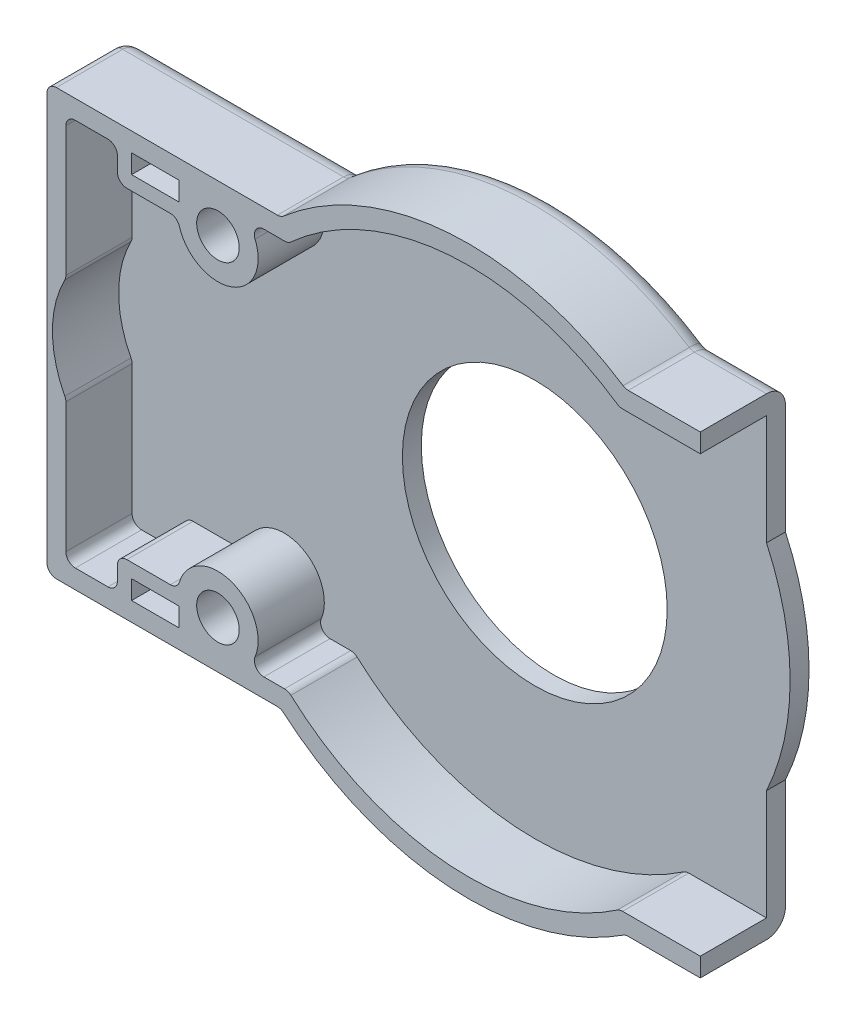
ISO-10303-21;
HEADER;
FILE_DESCRIPTION(('STEP AP214'),'2;1');
FILE_NAME('part.step','',(''),(''),'','','');
FILE_SCHEMA(('AUTOMOTIVE_DESIGN { 1 0 10303 214 1 1 1 1 }'));
ENDSEC;
DATA;
#1=APPLICATION_CONTEXT('core data for automotive mechanical design processes');
#2=APPLICATION_PROTOCOL_DEFINITION('international standard','automotive_design',2000,#1);
#3=PRODUCT_CONTEXT('',#1,'mechanical');
#4=PRODUCT('Part','Part','',(#3));
#5=PRODUCT_RELATED_PRODUCT_CATEGORY('part','',(#4));
#6=PRODUCT_DEFINITION_FORMATION('','',#4);
#7=PRODUCT_DEFINITION_CONTEXT('part definition',#1,'design');
#8=PRODUCT_DEFINITION('design','',#6,#7);
#9=PRODUCT_DEFINITION_SHAPE('','',#8);
#10=(LENGTH_UNIT() NAMED_UNIT(*) SI_UNIT(.MILLI.,.METRE.));
#11=(NAMED_UNIT(*) PLANE_ANGLE_UNIT() SI_UNIT($,.RADIAN.));
#12=(NAMED_UNIT(*) SI_UNIT($,.STERADIAN.) SOLID_ANGLE_UNIT());
#13=UNCERTAINTY_MEASURE_WITH_UNIT(LENGTH_MEASURE(1.E-05),#10,'distance_accuracy_value','');
#14=(GEOMETRIC_REPRESENTATION_CONTEXT(3) GLOBAL_UNCERTAINTY_ASSIGNED_CONTEXT((#13)) GLOBAL_UNIT_ASSIGNED_CONTEXT((#10,
#11,#12)) REPRESENTATION_CONTEXT('',''));
#15=CARTESIAN_POINT('',(0.,0.,0.));
#16=DIRECTION('',(0.,0.,1.));
#17=DIRECTION('',(1.,0.,0.));
#18=AXIS2_PLACEMENT_3D('',#15,#16,#17);
#19=CARTESIAN_POINT('',(0.,0.,2.));
#20=DIRECTION('',(0.,0.,1.));
#21=DIRECTION('',(1.,0.,0.));
#22=AXIS2_PLACEMENT_3D('',#19,#20,#21);
#23=PLANE('',#22);
#24=CARTESIAN_POINT('',(0.,0.,2.));
#25=DIRECTION('',(0.,0.,1.));
#26=DIRECTION('',(1.,0.,0.));
#27=AXIS2_PLACEMENT_3D('',#24,#25,#26);
#28=CIRCLE('',#27,14.);
#29=CARTESIAN_POINT('',(14.,0.,2.));
#30=VERTEX_POINT('',#29);
#31=EDGE_CURVE('E662',#30,#30,#28,.T.);
#32=ORIENTED_EDGE('',*,*,#31,.F.);
#33=EDGE_LOOP('',(#32));
#34=FACE_BOUND('',#33,.T.);
#35=DIRECTION('',(-1.,0.,0.));
#36=VECTOR('',#35,1.);
#37=CARTESIAN_POINT('',(-37.1338018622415,-17.,2.));
#38=LINE('',#37,#36);
#39=CARTESIAN_POINT('',(-31.5342769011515,-17.,2.));
#40=VERTEX_POINT('',#39);
#41=CARTESIAN_POINT('',(-36.1338018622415,-17.,2.));
#42=VERTEX_POINT('',#41);
#43=EDGE_CURVE('E510',#40,#42,#38,.T.);
#44=ORIENTED_EDGE('',*,*,#43,.F.);
#45=CARTESIAN_POINT('',(-31.5342769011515,-16.,2.));
#46=DIRECTION('',(0.,0.,1.));
#47=DIRECTION('',(1.,0.,0.));
#48=AXIS2_PLACEMENT_3D('',#45,#46,#47);
#49=CIRCLE('',#48,1.);
#50=CARTESIAN_POINT('',(-30.5759620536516,-16.2857142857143,2.));
#51=VERTEX_POINT('',#50);
#52=EDGE_CURVE('E1825',#40,#51,#49,.T.);
#53=ORIENTED_EDGE('',*,*,#52,.T.);
#54=CARTESIAN_POINT('',(-26.503123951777,-17.5,2.));
#55=DIRECTION('',(0.,0.,1.));
#56=DIRECTION('',(1.,0.,0.));
#57=AXIS2_PLACEMENT_3D('',#54,#55,#56);
#58=CIRCLE('',#57,4.25);
#59=CARTESIAN_POINT('',(-22.5735966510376,-19.1190476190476,2.));
#60=VERTEX_POINT('',#59);
#61=EDGE_CURVE('E567',#60,#51,#58,.T.);
#62=ORIENTED_EDGE('',*,*,#61,.F.);
#63=CARTESIAN_POINT('',(-21.6490019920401,-19.5,2.));
#64=DIRECTION('',(0.,0.,1.));
#65=DIRECTION('',(1.,0.,0.));
#66=AXIS2_PLACEMENT_3D('',#63,#64,#65);
#67=CIRCLE('',#66,1.);
#68=CARTESIAN_POINT('',(-21.6490019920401,-20.5,2.));
#69=VERTEX_POINT('',#68);
#70=EDGE_CURVE('E1854',#60,#69,#67,.T.);
#71=ORIENTED_EDGE('',*,*,#70,.T.);
#72=DIRECTION('',(-1.,0.,0.));
#73=VECTOR('',#72,1.);
#74=CARTESIAN_POINT('',(-42.583123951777,-20.5,2.));
#75=LINE('',#74,#73);
#76=CARTESIAN_POINT('',(-19.4615004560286,-20.5,2.));
#77=VERTEX_POINT('',#76);
#78=EDGE_CURVE('E639',#77,#69,#75,.T.);
#79=ORIENTED_EDGE('',*,*,#78,.F.);
#80=CARTESIAN_POINT('',(-19.4615004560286,-21.5,2.));
#81=DIRECTION('',(0.,0.,1.));
#82=DIRECTION('',(1.,0.,0.));
#83=AXIS2_PLACEMENT_3D('',#80,#81,#82);
#84=CIRCLE('',#83,1.);
#85=CARTESIAN_POINT('',(-18.7904142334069,-20.7586206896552,2.));
#86=VERTEX_POINT('',#85);
#87=EDGE_CURVE('E1877',#77,#86,#84,.F.);
#88=ORIENTED_EDGE('',*,*,#87,.T.);
#89=CARTESIAN_POINT('',(0.,0.,2.));
#90=DIRECTION('',(0.,0.,-1.));
#91=DIRECTION('',(1.,0.,0.));
#92=AXIS2_PLACEMENT_3D('',#89,#90,#91);
#93=CIRCLE('',#92,28.);
#94=CARTESIAN_POINT('',(15.7174819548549,-23.1724137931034,2.));
#95=VERTEX_POINT('',#94);
#96=EDGE_CURVE('E635',#95,#86,#93,.T.);
#97=ORIENTED_EDGE('',*,*,#96,.F.);
#98=CARTESIAN_POINT('',(16.2788205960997,-24.,2.));
#99=DIRECTION('',(0.,0.,1.));
#100=DIRECTION('',(1.,0.,0.));
#101=AXIS2_PLACEMENT_3D('',#98,#99,#100);
#102=CIRCLE('',#101,1.);
#103=CARTESIAN_POINT('',(16.2788205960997,-23.,2.));
#104=VERTEX_POINT('',#103);
#105=EDGE_CURVE('E1879',#95,#104,#102,.F.);
#106=ORIENTED_EDGE('',*,*,#105,.T.);
#107=DIRECTION('',(-1.,0.,0.));
#108=VECTOR('',#107,1.);
#109=CARTESIAN_POINT('',(15.9687194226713,-23.,2.));
#110=LINE('',#109,#108);
#111=CARTESIAN_POINT('',(24.5,-23.,2.));
#112=VERTEX_POINT('',#111);
#113=EDGE_CURVE('E581',#112,#104,#110,.T.);
#114=ORIENTED_EDGE('',*,*,#113,.F.);
#115=DIRECTION('',(0.,1.,0.));
#116=VECTOR('',#115,1.);
#117=CARTESIAN_POINT('',(24.5,-25.,2.));
#118=LINE('',#117,#116);
#119=CARTESIAN_POINT('',(24.5,-11.3468057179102,2.));
#120=VERTEX_POINT('',#119);
#121=EDGE_CURVE('E671',#112,#120,#118,.T.);
#122=ORIENTED_EDGE('',*,*,#121,.T.);
#123=CARTESIAN_POINT('',(0.,0.,2.));
#124=DIRECTION('',(0.,0.,1.));
#125=DIRECTION('',(-1.,0.,0.));
#126=AXIS2_PLACEMENT_3D('',#123,#124,#125);
#127=CIRCLE('',#126,27.);
#128=CARTESIAN_POINT('',(24.5,11.3468057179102,2.));
#129=VERTEX_POINT('',#128);
#130=EDGE_CURVE('E674',#120,#129,#127,.T.);
#131=ORIENTED_EDGE('',*,*,#130,.T.);
#132=DIRECTION('',(0.,1.,0.));
#133=VECTOR('',#132,1.);
#134=CARTESIAN_POINT('',(24.5,11.3468057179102,2.));
#135=LINE('',#134,#133);
#136=CARTESIAN_POINT('',(24.5,23.,2.));
#137=VERTEX_POINT('',#136);
#138=EDGE_CURVE('E668',#129,#137,#135,.T.);
#139=ORIENTED_EDGE('',*,*,#138,.T.);
#140=DIRECTION('',(1.,0.,0.));
#141=VECTOR('',#140,1.);
#142=CARTESIAN_POINT('',(24.5,23.,2.));
#143=LINE('',#142,#141);
#144=CARTESIAN_POINT('',(16.2788205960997,23.,2.));
#145=VERTEX_POINT('',#144);
#146=EDGE_CURVE('E586',#145,#137,#143,.T.);
#147=ORIENTED_EDGE('',*,*,#146,.F.);
#148=CARTESIAN_POINT('',(16.2788205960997,24.,2.));
#149=DIRECTION('',(0.,0.,1.));
#150=DIRECTION('',(1.,0.,0.));
#151=AXIS2_PLACEMENT_3D('',#148,#149,#150);
#152=CIRCLE('',#151,1.);
#153=CARTESIAN_POINT('',(15.7174819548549,23.1724137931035,2.));
#154=VERTEX_POINT('',#153);
#155=EDGE_CURVE('E1881',#145,#154,#152,.F.);
#156=ORIENTED_EDGE('',*,*,#155,.T.);
#157=CARTESIAN_POINT('',(0.,0.,2.));
#158=DIRECTION('',(0.,0.,-1.));
#159=DIRECTION('',(1.,0.,0.));
#160=AXIS2_PLACEMENT_3D('',#157,#158,#159);
#161=CIRCLE('',#160,28.);
#162=CARTESIAN_POINT('',(-18.7904142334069,20.7586206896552,2.));
#163=VERTEX_POINT('',#162);
#164=EDGE_CURVE('E651',#163,#154,#161,.T.);
#165=ORIENTED_EDGE('',*,*,#164,.F.);
#166=CARTESIAN_POINT('',(-19.4615004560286,21.5,2.));
#167=DIRECTION('',(0.,0.,1.));
#168=DIRECTION('',(1.,0.,0.));
#169=AXIS2_PLACEMENT_3D('',#166,#167,#168);
#170=CIRCLE('',#169,1.);
#171=CARTESIAN_POINT('',(-19.4615004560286,20.5,2.));
#172=VERTEX_POINT('',#171);
#173=EDGE_CURVE('E1343',#163,#172,#170,.F.);
#174=ORIENTED_EDGE('',*,*,#173,.T.);
#175=DIRECTION('',(1.,0.,0.));
#176=VECTOR('',#175,1.);
#177=CARTESIAN_POINT('',(-19.0722311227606,20.5,2.));
#178=LINE('',#177,#176);
#179=CARTESIAN_POINT('',(-21.6490019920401,20.5,2.));
#180=VERTEX_POINT('',#179);
#181=EDGE_CURVE('E647',#180,#172,#178,.T.);
#182=ORIENTED_EDGE('',*,*,#181,.F.);
#183=CARTESIAN_POINT('',(-21.6490019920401,19.5,2.));
#184=DIRECTION('',(0.,0.,1.));
#185=DIRECTION('',(1.,0.,0.));
#186=AXIS2_PLACEMENT_3D('',#183,#184,#185);
#187=CIRCLE('',#186,1.);
#188=CARTESIAN_POINT('',(-22.5735966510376,19.1190476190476,2.));
#189=VERTEX_POINT('',#188);
#190=EDGE_CURVE('E1827',#180,#189,#187,.T.);
#191=ORIENTED_EDGE('',*,*,#190,.T.);
#192=CARTESIAN_POINT('',(-26.503123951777,17.5,2.));
#193=DIRECTION('',(0.,0.,1.));
#194=DIRECTION('',(1.,0.,0.));
#195=AXIS2_PLACEMENT_3D('',#192,#193,#194);
#196=CIRCLE('',#195,4.25);
#197=CARTESIAN_POINT('',(-30.5759620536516,16.2857142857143,2.));
#198=VERTEX_POINT('',#197);
#199=EDGE_CURVE('E575',#198,#189,#196,.T.);
#200=ORIENTED_EDGE('',*,*,#199,.F.);
#201=CARTESIAN_POINT('',(-31.5342769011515,16.,2.));
#202=DIRECTION('',(0.,0.,1.));
#203=DIRECTION('',(1.,0.,0.));
#204=AXIS2_PLACEMENT_3D('',#201,#202,#203);
#205=CIRCLE('',#204,1.);
#206=CARTESIAN_POINT('',(-31.5342769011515,17.,2.));
#207=VERTEX_POINT('',#206);
#208=EDGE_CURVE('E1822',#198,#207,#205,.T.);
#209=ORIENTED_EDGE('',*,*,#208,.T.);
#210=DIRECTION('',(1.,0.,0.));
#211=VECTOR('',#210,1.);
#212=CARTESIAN_POINT('',(-37.1338018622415,17.,2.));
#213=LINE('',#212,#211);
#214=CARTESIAN_POINT('',(-36.1338018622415,17.,2.));
#215=VERTEX_POINT('',#214);
#216=EDGE_CURVE('E552',#215,#207,#213,.T.);
#217=ORIENTED_EDGE('',*,*,#216,.F.);
#218=CARTESIAN_POINT('',(-36.1338018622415,18.,2.));
#219=DIRECTION('',(0.,0.,1.));
#220=DIRECTION('',(1.,0.,0.));
#221=AXIS2_PLACEMENT_3D('',#218,#219,#220);
#222=CIRCLE('',#221,1.);
#223=CARTESIAN_POINT('',(-37.1338018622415,18.,2.));
#224=VERTEX_POINT('',#223);
#225=EDGE_CURVE('E1930',#215,#224,#222,.F.);
#226=ORIENTED_EDGE('',*,*,#225,.T.);
#227=DIRECTION('',(0.,-1.,0.));
#228=VECTOR('',#227,1.);
#229=CARTESIAN_POINT('',(-37.1338018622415,22.,2.));
#230=LINE('',#229,#228);
#231=CARTESIAN_POINT('',(-37.1338018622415,19.5,2.));
#232=VERTEX_POINT('',#231);
#233=EDGE_CURVE('E549',#232,#224,#230,.T.);
#234=ORIENTED_EDGE('',*,*,#233,.F.);
#235=CARTESIAN_POINT('',(-38.1338018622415,19.5,2.));
#236=DIRECTION('',(0.,0.,1.));
#237=DIRECTION('',(1.,0.,0.));
#238=AXIS2_PLACEMENT_3D('',#235,#236,#237);
#239=CIRCLE('',#238,1.);
#240=CARTESIAN_POINT('',(-38.1338018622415,20.5,2.));
#241=VERTEX_POINT('',#240);
#242=EDGE_CURVE('E1823',#232,#241,#239,.T.);
#243=ORIENTED_EDGE('',*,*,#242,.T.);
#244=CARTESIAN_POINT('',(-41.583123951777,20.5,2.));
#245=VERTEX_POINT('',#244);
#246=EDGE_CURVE('E648',#245,#241,#178,.T.);
#247=ORIENTED_EDGE('',*,*,#246,.F.);
#248=CARTESIAN_POINT('',(-41.583123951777,19.5,2.));
#249=DIRECTION('',(0.,0.,1.));
#250=DIRECTION('',(1.,0.,0.));
#251=AXIS2_PLACEMENT_3D('',#248,#249,#250);
#252=CIRCLE('',#251,1.);
#253=CARTESIAN_POINT('',(-42.583123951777,19.5,2.));
#254=VERTEX_POINT('',#253);
#255=EDGE_CURVE('E1850',#245,#254,#252,.T.);
#256=ORIENTED_EDGE('',*,*,#255,.T.);
#257=DIRECTION('',(0.,1.,0.));
#258=VECTOR('',#257,1.);
#259=CARTESIAN_POINT('',(-42.583123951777,20.5,2.));
#260=LINE('',#259,#258);
#261=CARTESIAN_POINT('',(-42.583123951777,5.78650153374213,2.));
#262=VERTEX_POINT('',#261);
#263=EDGE_CURVE('E642',#262,#254,#260,.T.);
#264=ORIENTED_EDGE('',*,*,#263,.F.);
#265=CARTESIAN_POINT('',(-43.583123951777,5.78650153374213,2.));
#266=DIRECTION('',(0.,0.,1.));
#267=DIRECTION('',(1.,0.,0.));
#268=AXIS2_PLACEMENT_3D('',#265,#266,#267);
#269=CIRCLE('',#268,1.);
#270=CARTESIAN_POINT('',(-42.696723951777,5.32358141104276,2.));
#271=VERTEX_POINT('',#270);
#272=EDGE_CURVE('E1871',#262,#271,#269,.F.);
#273=ORIENTED_EDGE('',*,*,#272,.T.);
#274=CARTESIAN_POINT('',(-32.503123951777,0.,2.));
#275=DIRECTION('',(0.,0.,1.));
#276=DIRECTION('',(1.,0.,0.));
#277=AXIS2_PLACEMENT_3D('',#274,#275,#276);
#278=CIRCLE('',#277,11.5);
#279=CARTESIAN_POINT('',(-42.696723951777,-5.32358141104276,2.));
#280=VERTEX_POINT('',#279);
#281=EDGE_CURVE('E557',#271,#280,#278,.T.);
#282=ORIENTED_EDGE('',*,*,#281,.T.);
#283=CARTESIAN_POINT('',(-43.583123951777,-5.78650153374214,2.));
#284=DIRECTION('',(0.,0.,1.));
#285=DIRECTION('',(1.,0.,0.));
#286=AXIS2_PLACEMENT_3D('',#283,#284,#285);
#287=CIRCLE('',#286,1.);
#288=CARTESIAN_POINT('',(-42.583123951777,-5.78650153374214,2.));
#289=VERTEX_POINT('',#288);
#290=EDGE_CURVE('E1867',#280,#289,#287,.F.);
#291=ORIENTED_EDGE('',*,*,#290,.T.);
#292=CARTESIAN_POINT('',(-42.583123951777,-19.5,2.));
#293=VERTEX_POINT('',#292);
#294=EDGE_CURVE('E644',#293,#289,#260,.T.);
#295=ORIENTED_EDGE('',*,*,#294,.F.);
#296=CARTESIAN_POINT('',(-41.583123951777,-19.5,2.));
#297=DIRECTION('',(0.,0.,1.));
#298=DIRECTION('',(1.,0.,0.));
#299=AXIS2_PLACEMENT_3D('',#296,#297,#298);
#300=CIRCLE('',#299,1.);
#301=CARTESIAN_POINT('',(-41.583123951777,-20.5,2.));
#302=VERTEX_POINT('',#301);
#303=EDGE_CURVE('E934',#293,#302,#300,.T.);
#304=ORIENTED_EDGE('',*,*,#303,.T.);
#305=CARTESIAN_POINT('',(-38.1338018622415,-20.5,2.));
#306=VERTEX_POINT('',#305);
#307=EDGE_CURVE('E638',#306,#302,#75,.T.);
#308=ORIENTED_EDGE('',*,*,#307,.F.);
#309=CARTESIAN_POINT('',(-38.1338018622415,-19.5,2.));
#310=DIRECTION('',(0.,0.,1.));
#311=DIRECTION('',(1.,0.,0.));
#312=AXIS2_PLACEMENT_3D('',#309,#310,#311);
#313=CIRCLE('',#312,1.);
#314=CARTESIAN_POINT('',(-37.1338018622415,-19.5,2.));
#315=VERTEX_POINT('',#314);
#316=EDGE_CURVE('E1821',#306,#315,#313,.T.);
#317=ORIENTED_EDGE('',*,*,#316,.T.);
#318=DIRECTION('',(0.,-1.,0.));
#319=VECTOR('',#318,1.);
#320=CARTESIAN_POINT('',(-37.1338018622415,-22.,2.));
#321=LINE('',#320,#319);
#322=CARTESIAN_POINT('',(-37.1338018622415,-18.,2.));
#323=VERTEX_POINT('',#322);
#324=EDGE_CURVE('E513',#323,#315,#321,.T.);
#325=ORIENTED_EDGE('',*,*,#324,.F.);
#326=CARTESIAN_POINT('',(-36.1338018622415,-18.,2.));
#327=DIRECTION('',(0.,0.,1.));
#328=DIRECTION('',(1.,0.,0.));
#329=AXIS2_PLACEMENT_3D('',#326,#327,#328);
#330=CIRCLE('',#329,1.);
#331=EDGE_CURVE('E1056',#323,#42,#330,.F.);
#332=ORIENTED_EDGE('',*,*,#331,.T.);
#333=EDGE_LOOP('',(#44,#53,#62,#71,#79,#88,#97,#106,#114,#122,#131,#139,#147,#156,#165,#174,
#182,#191,#200,#209,#217,#226,#234,#243,#247,#256,#264,#273,#282,#291,#295,#304,#308,#317,#325,#332));
#334=FACE_BOUND('',#333,.T.);
#335=ADVANCED_FACE('F37',(#34,#334),#23,.T.);
#336=CARTESIAN_POINT('',(-42.583123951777,-20.5,9.));
#337=DIRECTION('',(0.,-1.,0.));
#338=DIRECTION('',(1.,0.,0.));
#339=AXIS2_PLACEMENT_3D('',#336,#337,#338);
#340=PLANE('',#339);
#341=DIRECTION('',(-1.,0.,0.));
#342=VECTOR('',#341,1.);
#343=CARTESIAN_POINT('',(-42.583123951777,-20.5,9.));
#344=LINE('',#343,#342);
#345=CARTESIAN_POINT('',(-38.1338018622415,-20.5,9.));
#346=VERTEX_POINT('',#345);
#347=CARTESIAN_POINT('',(-41.583123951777,-20.5,9.));
#348=VERTEX_POINT('',#347);
#349=EDGE_CURVE('E608',#346,#348,#344,.T.);
#350=ORIENTED_EDGE('',*,*,#349,.F.);
#351=DIRECTION('',(0.,0.,1.));
#352=VECTOR('',#351,1.);
#353=CARTESIAN_POINT('',(-38.1338018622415,-20.5,2.));
#354=LINE('',#353,#352);
#355=EDGE_CURVE('E928',#346,#306,#354,.F.);
#356=ORIENTED_EDGE('',*,*,#355,.T.);
#357=ORIENTED_EDGE('',*,*,#307,.T.);
#358=DIRECTION('',(0.,0.,-1.));
#359=VECTOR('',#358,1.);
#360=CARTESIAN_POINT('',(-41.583123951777,-20.5,9.));
#361=LINE('',#360,#359);
#362=EDGE_CURVE('E925',#302,#348,#361,.F.);
#363=ORIENTED_EDGE('',*,*,#362,.T.);
#364=EDGE_LOOP('',(#350,#356,#357,#363));
#365=FACE_BOUND('',#364,.T.);
#366=ADVANCED_FACE('F756',(#365),#340,.F.);
#367=CARTESIAN_POINT('',(-26.503123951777,-17.5,21.0208152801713));
#368=DIRECTION('',(0.,0.,-1.));
#369=DIRECTION('',(-1.,0.,0.));
#370=AXIS2_PLACEMENT_3D('',#367,#368,#369);
#371=CYLINDRICAL_SURFACE('',#370,4.25);
#372=ORIENTED_EDGE('',*,*,#61,.T.);
#373=DIRECTION('',(0.,0.,-1.));
#374=VECTOR('',#373,1.);
#375=CARTESIAN_POINT('',(-30.5759620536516,-16.2857142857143,21.0208152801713));
#376=LINE('',#375,#374);
#377=CARTESIAN_POINT('',(-30.5759620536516,-16.2857142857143,9.));
#378=VERTEX_POINT('',#377);
#379=EDGE_CURVE('E1803',#51,#378,#376,.F.);
#380=ORIENTED_EDGE('',*,*,#379,.T.);
#381=CARTESIAN_POINT('',(-26.503123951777,-17.5,9.));
#382=DIRECTION('',(0.,0.,1.));
#383=DIRECTION('',(1.,0.,0.));
#384=AXIS2_PLACEMENT_3D('',#381,#382,#383);
#385=CIRCLE('',#384,4.25);
#386=CARTESIAN_POINT('',(-22.5735966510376,-19.1190476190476,9.));
#387=VERTEX_POINT('',#386);
#388=EDGE_CURVE('E572',#387,#378,#385,.T.);
#389=ORIENTED_EDGE('',*,*,#388,.F.);
#390=DIRECTION('',(0.,0.,-1.));
#391=VECTOR('',#390,1.);
#392=CARTESIAN_POINT('',(-22.5735966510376,-19.1190476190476,21.0208152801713));
#393=LINE('',#392,#391);
#394=EDGE_CURVE('E1832',#387,#60,#393,.T.);
#395=ORIENTED_EDGE('',*,*,#394,.T.);
#396=EDGE_LOOP('',(#372,#380,#389,#395));
#397=FACE_BOUND('',#396,.T.);
#398=ADVANCED_FACE('F752',(#397),#371,.T.);
#399=CARTESIAN_POINT('',(-26.503123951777,-17.5,0.));
#400=DIRECTION('',(0.,0.,-1.));
#401=DIRECTION('',(-1.,0.,0.));
#402=AXIS2_PLACEMENT_3D('',#399,#400,#401);
#403=CONICAL_SURFACE('',#402,4.75,0.785398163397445);
#404=CARTESIAN_POINT('',(-26.503123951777,-17.5,2.50000000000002));
#405=DIRECTION('',(0.,0.,1.));
#406=DIRECTION('',(1.,0.,0.));
#407=AXIS2_PLACEMENT_3D('',#404,#405,#406);
#408=CIRCLE('',#407,2.25);
#409=CARTESIAN_POINT('',(-24.253123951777,-17.5,2.50000000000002));
#410=VERTEX_POINT('',#409);
#411=EDGE_CURVE('E699',#410,#410,#408,.F.);
#412=ORIENTED_EDGE('',*,*,#411,.F.);
#413=EDGE_LOOP('',(#412));
#414=FACE_BOUND('',#413,.T.);
#415=CARTESIAN_POINT('',(-26.503123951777,-17.5,0.));
#416=DIRECTION('',(0.,0.,1.));
#417=DIRECTION('',(1.,0.,0.));
#418=AXIS2_PLACEMENT_3D('',#415,#416,#417);
#419=CIRCLE('',#418,4.75);
#420=CARTESIAN_POINT('',(-22.8203939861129,-20.5,0.));
#421=VERTEX_POINT('',#420);
#422=CARTESIAN_POINT('',(-30.185853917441,-20.5,0.));
#423=VERTEX_POINT('',#422);
#424=EDGE_CURVE('E696',#421,#423,#419,.T.);
#425=ORIENTED_EDGE('',*,*,#424,.F.);
#426=CARTESIAN_POINT('',(-22.8203939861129,-20.5,0.));
#427=CARTESIAN_POINT('',(-22.8653775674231,-20.5551731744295,3.79550834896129E-05));
#428=CARTESIAN_POINT('',(-22.9132222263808,-20.6078090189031,0.00228184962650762));
#429=CARTESIAN_POINT('',(-23.0133151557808,-20.7080827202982,0.0102111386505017));
#430=CARTESIAN_POINT('',(-23.0655469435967,-20.7557378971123,0.0158841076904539));
#431=CARTESIAN_POINT('',(-23.1726988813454,-20.8459003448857,0.0296207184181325));
#432=CARTESIAN_POINT('',(-23.2275725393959,-20.888469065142,0.0376506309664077));
#433=CARTESIAN_POINT('',(-23.3400128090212,-20.9695954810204,0.0554675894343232));
#434=CARTESIAN_POINT('',(-23.3975824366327,-21.0081485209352,0.0652566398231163));
#435=CARTESIAN_POINT('',(-23.5527878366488,-21.105292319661,0.0927557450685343));
#436=CARTESIAN_POINT('',(-23.6522357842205,-21.160698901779,0.111491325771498));
#437=CARTESIAN_POINT('',(-23.8552365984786,-21.2627206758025,0.150343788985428));
#438=CARTESIAN_POINT('',(-23.9587906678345,-21.3093332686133,0.170461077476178));
#439=CARTESIAN_POINT('',(-24.1699791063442,-21.3951999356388,0.210897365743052));
#440=CARTESIAN_POINT('',(-24.2776419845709,-21.434383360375,0.231216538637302));
#441=CARTESIAN_POINT('',(-24.4954828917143,-21.5056975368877,0.270771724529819));
#442=CARTESIAN_POINT('',(-24.6056616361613,-21.5378262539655,0.290007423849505));
#443=CARTESIAN_POINT('',(-24.8799193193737,-21.6091664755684,0.334983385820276));
#444=CARTESIAN_POINT('',(-25.0451580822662,-21.6446867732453,0.35957020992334));
#445=CARTESIAN_POINT('',(-25.3786887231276,-21.7033412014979,0.402102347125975));
#446=CARTESIAN_POINT('',(-25.5469815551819,-21.7264713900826,0.420045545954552));
#447=CARTESIAN_POINT('',(-25.8849054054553,-21.7611329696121,0.447571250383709));
#448=CARTESIAN_POINT('',(-26.0545305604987,-21.7727005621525,0.457179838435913));
#449=CARTESIAN_POINT('',(-26.3944128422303,-21.7847733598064,0.467218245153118));
#450=CARTESIAN_POINT('',(-26.5646698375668,-21.7852807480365,0.467649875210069));
#451=CARTESIAN_POINT('',(-26.9048763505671,-21.7752494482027,0.45929218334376));
#452=CARTESIAN_POINT('',(-27.0748250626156,-21.7646947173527,0.450489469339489));
#453=CARTESIAN_POINT('',(-27.4130266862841,-21.7321336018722,0.42447479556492));
#454=CARTESIAN_POINT('',(-27.5812790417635,-21.7101235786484,0.407260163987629));
#455=CARTESIAN_POINT('',(-27.9151694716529,-21.653790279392,0.365990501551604));
#456=CARTESIAN_POINT('',(-28.080802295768,-21.6194449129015,0.341923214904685));
#457=CARTESIAN_POINT('',(-28.407853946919,-21.5371194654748,0.289214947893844));
#458=CARTESIAN_POINT('',(-28.569275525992,-21.4891485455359,0.260577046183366));
#459=CARTESIAN_POINT('',(-28.8088875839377,-21.4047663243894,0.216063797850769));
#460=CARTESIAN_POINT('',(-28.8892493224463,-21.3741397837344,0.200781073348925));
#461=CARTESIAN_POINT('',(-29.0481193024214,-21.3083920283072,0.170295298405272));
#462=CARTESIAN_POINT('',(-29.1266280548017,-21.2732720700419,0.155092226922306));
#463=CARTESIAN_POINT('',(-29.2808654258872,-21.1983373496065,0.1254500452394));
#464=CARTESIAN_POINT('',(-29.3566091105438,-21.1585555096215,0.111006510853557));
#465=CARTESIAN_POINT('',(-29.5052879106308,-21.0735774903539,0.0834911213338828));
#466=CARTESIAN_POINT('',(-29.5782232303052,-21.0283817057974,0.0704191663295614));
#467=CARTESIAN_POINT('',(-29.6985949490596,-20.9467695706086,0.050236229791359));
#468=CARTESIAN_POINT('',(-29.7469888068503,-20.9119142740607,0.0425268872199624));
#469=CARTESIAN_POINT('',(-29.8415786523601,-20.8391213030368,0.0286125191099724));
#470=CARTESIAN_POINT('',(-29.8877763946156,-20.8011861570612,0.0224062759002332));
#471=CARTESIAN_POINT('',(-29.9780204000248,-20.7215441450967,0.0118966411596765));
#472=CARTESIAN_POINT('',(-30.0220361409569,-20.6797992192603,0.00761574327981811));
#473=CARTESIAN_POINT('',(-30.1067005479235,-20.5926588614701,0.00167423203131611));
#474=CARTESIAN_POINT('',(-30.1473402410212,-20.5472542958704,2.0402270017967E-05));
#475=CARTESIAN_POINT('',(-30.1858539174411,-20.5000000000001,-1.22580413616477E-13));
#476=B_SPLINE_CURVE_WITH_KNOTS('',3,(#426,#427,#428,#429,#430,#431,#432,#433,#434,#435,#436,
#437,#438,#439,#440,#441,#442,#443,#444,#445,#446,#447,#448,#449,#450,#451,#452,#453,#454,#455,
#456,#457,#458,#459,#460,#461,#462,#463,#464,#465,#466,#467,#468,#469,#470,#471,#472,#473,#474,
#475),.UNSPECIFIED.,.F.,.F.,(4,2,2,2,2,2,2,2,2,2,2,2,2,2,2,2,2,2,2,2,2,2,2,2,4),(0.,
0.213198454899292,0.425628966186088,0.635156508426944,0.844924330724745,1.19048169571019,
1.53614103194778,1.88493857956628,2.23383659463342,2.74554739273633,3.25742089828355,
3.7676866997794,4.27785178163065,4.78875775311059,5.29982610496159,5.81181429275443,
6.32345906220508,6.58539408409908,6.84725601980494,7.10736903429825,7.36746309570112,
7.54775377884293,7.72789791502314,7.91009521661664,8.09276222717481),.UNSPECIFIED.);
#477=EDGE_CURVE('E1230',#421,#423,#476,.T.);
#478=ORIENTED_EDGE('',*,*,#477,.T.);
#479=EDGE_LOOP('',(#425,#478));
#480=FACE_BOUND('',#479,.T.);
#481=CARTESIAN_POINT('',(-29.1338018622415,-24.8165771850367,-3.02513781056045));
#482=CARTESIAN_POINT('',(-29.1338018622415,-24.7009510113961,-2.91633284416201));
#483=CARTESIAN_POINT('',(-29.1338018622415,-24.5851795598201,-2.80768234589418));
#484=CARTESIAN_POINT('',(-29.1338018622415,-24.3532984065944,-2.59074150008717));
#485=CARTESIAN_POINT('',(-29.1338018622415,-24.237188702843,-2.48245115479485));
#486=CARTESIAN_POINT('',(-29.1338018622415,-23.8881087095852,-2.15803738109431));
#487=CARTESIAN_POINT('',(-29.1338018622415,-23.6545605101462,-1.94253427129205));
#488=CARTESIAN_POINT('',(-29.1338018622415,-23.1789903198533,-1.50793997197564));
#489=CARTESIAN_POINT('',(-29.1338018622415,-22.9369110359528,-1.28891140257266));
#490=CARTESIAN_POINT('',(-29.1338018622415,-22.4498583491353,-0.854406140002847));
#491=CARTESIAN_POINT('',(-29.1338018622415,-22.2048869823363,-0.638927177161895));
#492=CARTESIAN_POINT('',(-29.1338018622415,-21.8341559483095,-0.319662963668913));
#493=CARTESIAN_POINT('',(-29.1338018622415,-21.7100723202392,-0.213932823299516));
#494=CARTESIAN_POINT('',(-29.1338018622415,-21.4605236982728,-0.00411761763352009));
#495=CARTESIAN_POINT('',(-29.1338018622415,-21.335058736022,0.099967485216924));
#496=CARTESIAN_POINT('',(-29.1338018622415,-21.0821366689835,0.306262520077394));
#497=CARTESIAN_POINT('',(-29.1338018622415,-20.9546758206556,0.408467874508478));
#498=CARTESIAN_POINT('',(-29.1338018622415,-20.6975917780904,0.610109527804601));
#499=CARTESIAN_POINT('',(-29.1338018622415,-20.5679687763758,0.70954607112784));
#500=CARTESIAN_POINT('',(-29.1338018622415,-20.3074536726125,0.903600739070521));
#501=CARTESIAN_POINT('',(-29.1338018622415,-20.1765931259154,0.998261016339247));
#502=CARTESIAN_POINT('',(-29.1338018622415,-19.9113356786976,1.18266222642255));
#503=CARTESIAN_POINT('',(-29.1338018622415,-19.7769372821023,1.27240102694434));
#504=CARTESIAN_POINT('',(-29.1338018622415,-19.5041816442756,1.44454329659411));
#505=CARTESIAN_POINT('',(-29.1338018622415,-19.3658409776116,1.52697279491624));
#506=CARTESIAN_POINT('',(-29.1338018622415,-19.083649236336,1.68169604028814));
#507=CARTESIAN_POINT('',(-29.1338018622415,-18.939804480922,1.7540009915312));
#508=CARTESIAN_POINT('',(-29.1338018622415,-18.7129328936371,1.85404075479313));
#509=CARTESIAN_POINT('',(-29.1338018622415,-18.6322256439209,1.88702148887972));
#510=CARTESIAN_POINT('',(-29.1338018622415,-18.4687849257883,1.94763558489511));
#511=CARTESIAN_POINT('',(-29.1338018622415,-18.3860510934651,1.97526797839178));
#512=CARTESIAN_POINT('',(-29.1338018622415,-18.2191315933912,2.0239615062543));
#513=CARTESIAN_POINT('',(-29.1338018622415,-18.1349561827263,2.04505733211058));
#514=CARTESIAN_POINT('',(-29.1338018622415,-17.9650907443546,2.07981771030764));
#515=CARTESIAN_POINT('',(-29.1338018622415,-17.8794012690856,2.09348491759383));
#516=CARTESIAN_POINT('',(-29.1338018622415,-17.7059712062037,2.1126955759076));
#517=CARTESIAN_POINT('',(-29.1338018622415,-17.6182184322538,2.11813127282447));
#518=CARTESIAN_POINT('',(-29.1338018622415,-17.442615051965,2.12016122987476));
#519=CARTESIAN_POINT('',(-29.1338018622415,-17.3547644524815,2.1167560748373));
#520=CARTESIAN_POINT('',(-29.1338018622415,-17.1795321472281,2.10131770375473));
#521=CARTESIAN_POINT('',(-29.1338018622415,-17.092153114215,2.08925468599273));
#522=CARTESIAN_POINT('',(-29.1338018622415,-16.9188585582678,2.05724524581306));
#523=CARTESIAN_POINT('',(-29.1338018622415,-16.8329434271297,2.03729674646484));
#524=CARTESIAN_POINT('',(-29.1338018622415,-16.630704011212,1.98171084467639));
#525=CARTESIAN_POINT('',(-29.1338018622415,-16.5152315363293,1.9429922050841));
#526=CARTESIAN_POINT('',(-29.1338018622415,-16.2881723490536,1.85552557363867));
#527=CARTESIAN_POINT('',(-29.1338018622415,-16.1765881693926,1.80677118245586));
#528=CARTESIAN_POINT('',(-29.1338018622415,-15.9559813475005,1.70123234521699));
#529=CARTESIAN_POINT('',(-29.1338018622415,-15.8469947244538,1.64437359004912));
#530=CARTESIAN_POINT('',(-29.1338018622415,-15.6322767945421,1.5249555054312));
#531=CARTESIAN_POINT('',(-29.1338018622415,-15.5265444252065,1.46239806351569));
#532=CARTESIAN_POINT('',(-29.1338018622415,-15.2600004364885,1.29720398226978));
#533=CARTESIAN_POINT('',(-29.1338018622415,-15.1010751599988,1.19153947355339));
#534=CARTESIAN_POINT('',(-29.1338018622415,-14.7879706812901,0.973358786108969));
#535=CARTESIAN_POINT('',(-29.1338018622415,-14.6337936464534,0.860839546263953));
#536=CARTESIAN_POINT('',(-29.1338018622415,-14.3287180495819,0.630844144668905));
#537=CARTESIAN_POINT('',(-29.1338018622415,-14.1778266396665,0.513358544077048));
#538=CARTESIAN_POINT('',(-29.1338018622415,-13.8787526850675,0.274985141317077));
#539=CARTESIAN_POINT('',(-29.1338018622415,-13.7305703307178,0.154097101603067));
#540=CARTESIAN_POINT('',(-29.1338018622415,-13.4463013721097,-0.0818841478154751));
#541=CARTESIAN_POINT('',(-29.1338018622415,-13.3100774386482,-0.196812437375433));
#542=CARTESIAN_POINT('',(-29.1338018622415,-13.0390661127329,-0.428363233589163));
#543=CARTESIAN_POINT('',(-29.1338018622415,-12.9042788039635,-0.544985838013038));
#544=CARTESIAN_POINT('',(-29.1338018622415,-12.6365135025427,-0.778991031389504));
#545=CARTESIAN_POINT('',(-29.1338018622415,-12.5035299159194,-0.896367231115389));
#546=CARTESIAN_POINT('',(-29.1338018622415,-12.2385269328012,-1.13217399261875));
#547=CARTESIAN_POINT('',(-29.1338018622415,-12.1065074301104,-1.25060443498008));
#548=CARTESIAN_POINT('',(-29.1338018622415,-11.9748621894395,-1.36944557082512));
#549=B_SPLINE_CURVE_WITH_KNOTS('',3,(#481,#482,#483,#484,#485,#486,#487,#488,#489,#490,#491,
#492,#493,#494,#495,#496,#497,#498,#499,#500,#501,#502,#503,#504,#505,#506,#507,#508,#509,#510,
#511,#512,#513,#514,#515,#516,#517,#518,#519,#520,#521,#522,#523,#524,#525,#526,#527,#528,#529,
#530,#531,#532,#533,#534,#535,#536,#537,#538,#539,#540,#541,#542,#543,#544,#545,#546,#547,#548),
.UNSPECIFIED.,.F.,.F.,(4,2,2,2,2,2,2,2,2,2,2,2,2,2,2,2,2,2,2,2,2,2,2,2,2,2,2,2,2,2,2,2,2,4),(0.,
0.476309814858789,0.952622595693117,1.90596127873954,2.88532172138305,3.864029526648,
4.35307973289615,4.84211875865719,5.33222285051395,5.82228353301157,6.3067295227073,
6.79138377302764,7.27423630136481,7.75655019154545,8.01795929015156,8.27941567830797,
8.53945968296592,8.79941068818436,9.06273601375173,9.32604392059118,9.59026254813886,
9.85455081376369,10.2192772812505,10.5842370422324,10.952788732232,11.3212187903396,
11.8934577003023,12.4659540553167,13.0395922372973,13.6132705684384,14.1479397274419,
14.6826398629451,15.2147580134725,15.746816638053),.UNSPECIFIED.);
#550=CARTESIAN_POINT('',(-29.1338018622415,-18.3012700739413,2.));
#551=VERTEX_POINT('',#550);
#552=CARTESIAN_POINT('',(-29.1338018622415,-18.,2.07222736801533));
#553=VERTEX_POINT('',#552);
#554=EDGE_CURVE('E862',#551,#553,#549,.T.);
#555=ORIENTED_EDGE('',*,*,#554,.T.);
#556=CARTESIAN_POINT('',(-29.1338018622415,-18.,2.07222736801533));
#557=CARTESIAN_POINT('',(-29.1338014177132,-17.9833856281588,2.07533066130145));
#558=CARTESIAN_POINT('',(-29.1342167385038,-17.9666776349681,2.0778921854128));
#559=CARTESIAN_POINT('',(-29.1358965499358,-17.9331626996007,2.08188390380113));
#560=CARTESIAN_POINT('',(-29.1371614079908,-17.9163557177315,2.0833136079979));
#561=CARTESIAN_POINT('',(-29.1422239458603,-17.8662601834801,2.08581393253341));
#562=CARTESIAN_POINT('',(-29.1472890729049,-17.8329773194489,2.08515645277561));
#563=CARTESIAN_POINT('',(-29.1573729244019,-17.7834689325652,2.08071291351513));
#564=CARTESIAN_POINT('',(-29.1612187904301,-17.7668118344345,2.07860190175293));
#565=CARTESIAN_POINT('',(-29.1758535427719,-17.7100850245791,2.06933764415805));
#566=CARTESIAN_POINT('',(-29.1886497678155,-17.6709352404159,2.05930496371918));
#567=CARTESIAN_POINT('',(-29.2107390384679,-17.6148122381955,2.04002092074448));
#568=CARTESIAN_POINT('',(-29.2186186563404,-17.5964762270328,2.03285314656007));
#569=CARTESIAN_POINT('',(-29.2352091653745,-17.5607800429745,2.01729763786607));
#570=CARTESIAN_POINT('',(-29.2439180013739,-17.5434176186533,2.00891289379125));
#571=CARTESIAN_POINT('',(-29.2529960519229,-17.5265223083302,2.));
#572=B_SPLINE_CURVE_WITH_KNOTS('',3,(#556,#557,#558,#559,#560,#561,#562,#563,#564,#565,#566,
#567,#568,#569,#570,#571),.UNSPECIFIED.,.F.,.F.,(4,2,2,2,2,2,2,4),(0.,0.050674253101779,
0.101370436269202,0.201798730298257,0.253438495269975,0.379636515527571,0.443200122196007,
0.506610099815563),.UNSPECIFIED.);
#573=CARTESIAN_POINT('',(-29.2529960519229,-17.5265223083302,2.));
#574=VERTEX_POINT('',#573);
#575=EDGE_CURVE('E853',#553,#574,#572,.T.);
#576=ORIENTED_EDGE('',*,*,#575,.T.);
#577=CARTESIAN_POINT('',(-26.503123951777,-17.5,2.));
#578=DIRECTION('',(0.,0.,1.));
#579=DIRECTION('',(1.,0.,0.));
#580=AXIS2_PLACEMENT_3D('',#577,#578,#579);
#581=CIRCLE('',#580,2.75000000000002);
#582=EDGE_CURVE('E717',#574,#551,#581,.T.);
#583=ORIENTED_EDGE('',*,*,#582,.T.);
#584=EDGE_LOOP('',(#555,#576,#583));
#585=FACE_BOUND('',#584,.T.);
#586=ADVANCED_FACE('F755',(#414,#480,#585),#403,.F.);
#587=CARTESIAN_POINT('',(-19.0722311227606,20.5,9.));
#588=DIRECTION('',(0.,1.,0.));
#589=DIRECTION('',(-1.,0.,0.));
#590=AXIS2_PLACEMENT_3D('',#587,#588,#589);
#591=PLANE('',#590);
#592=ORIENTED_EDGE('',*,*,#246,.T.);
#593=DIRECTION('',(0.,0.,-1.));
#594=VECTOR('',#593,1.);
#595=CARTESIAN_POINT('',(-38.1338018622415,20.5,9.));
#596=LINE('',#595,#594);
#597=CARTESIAN_POINT('',(-38.1338018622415,20.5,9.));
#598=VERTEX_POINT('',#597);
#599=EDGE_CURVE('E983',#241,#598,#596,.F.);
#600=ORIENTED_EDGE('',*,*,#599,.T.);
#601=DIRECTION('',(1.,0.,0.));
#602=VECTOR('',#601,1.);
#603=CARTESIAN_POINT('',(-19.0722311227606,20.5,9.));
#604=LINE('',#603,#602);
#605=CARTESIAN_POINT('',(-41.583123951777,20.5,9.));
#606=VERTEX_POINT('',#605);
#607=EDGE_CURVE('E620',#606,#598,#604,.T.);
#608=ORIENTED_EDGE('',*,*,#607,.F.);
#609=DIRECTION('',(0.,0.,-1.));
#610=VECTOR('',#609,1.);
#611=CARTESIAN_POINT('',(-41.583123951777,20.5,2.));
#612=LINE('',#611,#610);
#613=EDGE_CURVE('E980',#606,#245,#612,.T.);
#614=ORIENTED_EDGE('',*,*,#613,.T.);
#615=EDGE_LOOP('',(#592,#600,#608,#614));
#616=FACE_BOUND('',#615,.T.);
#617=ADVANCED_FACE('F780',(#616),#591,.F.);
#618=DIRECTION('',(0.,-1.,0.));
#619=VECTOR('',#618,1.);
#620=CARTESIAN_POINT('',(-35.6338018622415,-20.5,2.));
#621=LINE('',#620,#619);
#622=CARTESIAN_POINT('',(-35.6338018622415,-18.5,2.));
#623=VERTEX_POINT('',#622);
#624=CARTESIAN_POINT('',(-35.6338018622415,-20.5,2.));
#625=VERTEX_POINT('',#624);
#626=EDGE_CURVE('E499',#623,#625,#621,.T.);
#627=ORIENTED_EDGE('',*,*,#626,.T.);
#628=CARTESIAN_POINT('',(-30.6338018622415,-20.5,2.));
#629=VERTEX_POINT('',#628);
#630=EDGE_CURVE('E643',#629,#625,#75,.T.);
#631=ORIENTED_EDGE('',*,*,#630,.F.);
#632=DIRECTION('',(0.,1.,0.));
#633=VECTOR('',#632,1.);
#634=CARTESIAN_POINT('',(-30.6338018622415,-20.5,2.));
#635=LINE('',#634,#633);
#636=CARTESIAN_POINT('',(-30.6338018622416,-18.5,2.));
#637=VERTEX_POINT('',#636);
#638=EDGE_CURVE('E1811',#629,#637,#635,.T.);
#639=ORIENTED_EDGE('',*,*,#638,.T.);
#640=DIRECTION('',(-1.,0.,0.));
#641=VECTOR('',#640,1.);
#642=CARTESIAN_POINT('',(-35.6338018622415,-18.5,2.));
#643=LINE('',#642,#641);
#644=EDGE_CURVE('E919',#637,#623,#643,.T.);
#645=ORIENTED_EDGE('',*,*,#644,.T.);
#646=EDGE_LOOP('',(#627,#631,#639,#645));
#647=FACE_BOUND('',#646,.T.);
#648=ADVANCED_FACE('F761',(#647),#23,.T.);
#649=CARTESIAN_POINT('',(-26.503123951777,17.5,21.0208152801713));
#650=DIRECTION('',(0.,0.,-1.));
#651=DIRECTION('',(-1.,0.,0.));
#652=AXIS2_PLACEMENT_3D('',#649,#650,#651);
#653=CYLINDRICAL_SURFACE('',#652,4.25);
#654=CARTESIAN_POINT('',(-26.503123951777,17.5,9.));
#655=DIRECTION('',(0.,0.,1.));
#656=DIRECTION('',(1.,0.,0.));
#657=AXIS2_PLACEMENT_3D('',#654,#655,#656);
#658=CIRCLE('',#657,4.25);
#659=CARTESIAN_POINT('',(-30.5759620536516,16.2857142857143,9.));
#660=VERTEX_POINT('',#659);
#661=CARTESIAN_POINT('',(-22.5735966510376,19.1190476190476,9.));
#662=VERTEX_POINT('',#661);
#663=EDGE_CURVE('E578',#660,#662,#658,.T.);
#664=ORIENTED_EDGE('',*,*,#663,.F.);
#665=DIRECTION('',(0.,0.,-1.));
#666=VECTOR('',#665,1.);
#667=CARTESIAN_POINT('',(-30.5759620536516,16.2857142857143,21.0208152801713));
#668=LINE('',#667,#666);
#669=EDGE_CURVE('E1845',#660,#198,#668,.T.);
#670=ORIENTED_EDGE('',*,*,#669,.T.);
#671=ORIENTED_EDGE('',*,*,#199,.T.);
#672=DIRECTION('',(0.,0.,-1.));
#673=VECTOR('',#672,1.);
#674=CARTESIAN_POINT('',(-22.5735966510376,19.1190476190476,21.0208152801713));
#675=LINE('',#674,#673);
#676=EDGE_CURVE('E1842',#189,#662,#675,.F.);
#677=ORIENTED_EDGE('',*,*,#676,.T.);
#678=EDGE_LOOP('',(#664,#670,#671,#677));
#679=FACE_BOUND('',#678,.T.);
#680=ADVANCED_FACE('F758',(#679),#653,.T.);
#681=CARTESIAN_POINT('',(-26.503123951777,17.5,0.));
#682=DIRECTION('',(0.,0.,-1.));
#683=DIRECTION('',(-1.,0.,0.));
#684=AXIS2_PLACEMENT_3D('',#681,#682,#683);
#685=CONICAL_SURFACE('',#684,4.75,0.785398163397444);
#686=CARTESIAN_POINT('',(-26.503123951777,17.5,2.50000000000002));
#687=DIRECTION('',(0.,0.,1.));
#688=DIRECTION('',(1.,0.,0.));
#689=AXIS2_PLACEMENT_3D('',#686,#687,#688);
#690=CIRCLE('',#689,2.25);
#691=CARTESIAN_POINT('',(-24.253123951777,17.5,2.50000000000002));
#692=VERTEX_POINT('',#691);
#693=EDGE_CURVE('E702',#692,#692,#690,.F.);
#694=ORIENTED_EDGE('',*,*,#693,.F.);
#695=EDGE_LOOP('',(#694));
#696=FACE_BOUND('',#695,.T.);
#697=CARTESIAN_POINT('',(-26.503123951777,17.5,0.));
#698=DIRECTION('',(0.,0.,1.));
#699=DIRECTION('',(1.,0.,0.));
#700=AXIS2_PLACEMENT_3D('',#697,#698,#699);
#701=CIRCLE('',#700,4.75);
#702=CARTESIAN_POINT('',(-30.185853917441,20.5,0.));
#703=VERTEX_POINT('',#702);
#704=CARTESIAN_POINT('',(-22.8203939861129,20.5,0.));
#705=VERTEX_POINT('',#704);
#706=EDGE_CURVE('E693',#703,#705,#701,.T.);
#707=ORIENTED_EDGE('',*,*,#706,.F.);
#708=CARTESIAN_POINT('',(-30.185853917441,20.5,0.));
#709=CARTESIAN_POINT('',(-30.1408703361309,20.5551731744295,3.79550834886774E-05));
#710=CARTESIAN_POINT('',(-30.0930256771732,20.6078090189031,0.0022818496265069));
#711=CARTESIAN_POINT('',(-29.9929327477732,20.7080827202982,0.0102111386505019));
#712=CARTESIAN_POINT('',(-29.9407009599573,20.7557378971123,0.0158841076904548));
#713=CARTESIAN_POINT('',(-29.8335490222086,20.8459003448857,0.0296207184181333));
#714=CARTESIAN_POINT('',(-29.778675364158,20.888469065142,0.0376506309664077));
#715=CARTESIAN_POINT('',(-29.6662350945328,20.9695954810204,0.0554675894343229));
#716=CARTESIAN_POINT('',(-29.6086654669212,21.0081485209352,0.0652566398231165));
#717=CARTESIAN_POINT('',(-29.4534600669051,21.105292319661,0.0927557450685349));
#718=CARTESIAN_POINT('',(-29.3540121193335,21.160698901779,0.111491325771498));
#719=CARTESIAN_POINT('',(-29.1510113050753,21.2627206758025,0.150343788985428));
#720=CARTESIAN_POINT('',(-29.0474572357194,21.3093332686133,0.170461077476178));
#721=CARTESIAN_POINT('',(-28.8362687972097,21.3951999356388,0.210897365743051));
#722=CARTESIAN_POINT('',(-28.7286059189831,21.434383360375,0.231216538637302));
#723=CARTESIAN_POINT('',(-28.5107650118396,21.5056975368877,0.270771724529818));
#724=CARTESIAN_POINT('',(-28.4005862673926,21.5378262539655,0.290007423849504));
#725=CARTESIAN_POINT('',(-28.1263285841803,21.6091664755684,0.334983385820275));
#726=CARTESIAN_POINT('',(-27.9610898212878,21.6446867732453,0.359570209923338));
#727=CARTESIAN_POINT('',(-27.6275591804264,21.7033412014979,0.402102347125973));
#728=CARTESIAN_POINT('',(-27.459266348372,21.7264713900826,0.42004554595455));
#729=CARTESIAN_POINT('',(-27.1213424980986,21.7611329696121,0.447571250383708));
#730=CARTESIAN_POINT('',(-26.9517173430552,21.7727005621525,0.457179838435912));
#731=CARTESIAN_POINT('',(-26.6118350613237,21.7847733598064,0.467218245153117));
#732=CARTESIAN_POINT('',(-26.4415780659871,21.7852807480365,0.467649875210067));
#733=CARTESIAN_POINT('',(-26.1013715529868,21.7752494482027,0.459292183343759));
#734=CARTESIAN_POINT('',(-25.9314228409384,21.7646947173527,0.450489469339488));
#735=CARTESIAN_POINT('',(-25.5932212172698,21.7321336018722,0.42447479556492));
#736=CARTESIAN_POINT('',(-25.4249688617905,21.7101235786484,0.407260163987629));
#737=CARTESIAN_POINT('',(-25.0910784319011,21.653790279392,0.365990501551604));
#738=CARTESIAN_POINT('',(-24.9254456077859,21.6194449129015,0.341923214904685));
#739=CARTESIAN_POINT('',(-24.5983939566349,21.5371194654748,0.289214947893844));
#740=CARTESIAN_POINT('',(-24.436972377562,21.4891485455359,0.260577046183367));
#741=CARTESIAN_POINT('',(-24.1973603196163,21.4047663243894,0.21606379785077));
#742=CARTESIAN_POINT('',(-24.1169985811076,21.3741397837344,0.200781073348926));
#743=CARTESIAN_POINT('',(-23.9581286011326,21.3083920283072,0.170295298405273));
#744=CARTESIAN_POINT('',(-23.8796198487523,21.2732720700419,0.155092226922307));
#745=CARTESIAN_POINT('',(-23.7253824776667,21.1983373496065,0.125450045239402));
#746=CARTESIAN_POINT('',(-23.6496387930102,21.1585555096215,0.111006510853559));
#747=CARTESIAN_POINT('',(-23.5009599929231,21.0735774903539,0.0834911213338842));
#748=CARTESIAN_POINT('',(-23.4280246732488,21.0283817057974,0.0704191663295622));
#749=CARTESIAN_POINT('',(-23.3076529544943,20.9467695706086,0.0502362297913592));
#750=CARTESIAN_POINT('',(-23.2592590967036,20.9119142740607,0.0425268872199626));
#751=CARTESIAN_POINT('',(-23.1646692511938,20.8391213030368,0.0286125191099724));
#752=CARTESIAN_POINT('',(-23.1184715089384,20.8011861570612,0.0224062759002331));
#753=CARTESIAN_POINT('',(-23.0282275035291,20.7215441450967,0.0118966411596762));
#754=CARTESIAN_POINT('',(-22.984211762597,20.6797992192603,0.00761574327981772));
#755=CARTESIAN_POINT('',(-22.8995473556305,20.5926588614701,0.001674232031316));
#756=CARTESIAN_POINT('',(-22.8589076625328,20.5472542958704,2.04022700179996E-05));
#757=CARTESIAN_POINT('',(-22.8203939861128,20.5000000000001,-1.22707680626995E-13));
#758=B_SPLINE_CURVE_WITH_KNOTS('',3,(#708,#709,#710,#711,#712,#713,#714,#715,#716,#717,#718,
#719,#720,#721,#722,#723,#724,#725,#726,#727,#728,#729,#730,#731,#732,#733,#734,#735,#736,#737,
#738,#739,#740,#741,#742,#743,#744,#745,#746,#747,#748,#749,#750,#751,#752,#753,#754,#755,#756,
#757),.UNSPECIFIED.,.F.,.F.,(4,2,2,2,2,2,2,2,2,2,2,2,2,2,2,2,2,2,2,2,2,2,2,2,4),(0.,
0.213198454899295,0.425628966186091,0.635156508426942,0.844924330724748,1.19048169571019,
1.53614103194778,1.88493857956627,2.23383659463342,2.74554739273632,3.25742089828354,
3.76768669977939,4.27785178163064,4.78875775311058,5.29982610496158,5.81181429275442,
6.32345906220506,6.58539408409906,6.84725601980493,7.10736903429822,7.3674630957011,
7.54775377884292,7.72789791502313,7.91009521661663,8.09276222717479),.UNSPECIFIED.);
#759=EDGE_CURVE('E1175',#703,#705,#758,.T.);
#760=ORIENTED_EDGE('',*,*,#759,.T.);
#761=EDGE_LOOP('',(#707,#760));
#762=FACE_BOUND('',#761,.T.);
#763=CARTESIAN_POINT('',(-26.503123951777,17.5,2.));
#764=DIRECTION('',(0.,0.,1.));
#765=DIRECTION('',(1.,0.,0.));
#766=AXIS2_PLACEMENT_3D('',#763,#764,#765);
#767=CIRCLE('',#766,2.75000000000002);
#768=CARTESIAN_POINT('',(-29.1338018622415,18.3012700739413,2.));
#769=VERTEX_POINT('',#768);
#770=CARTESIAN_POINT('',(-29.2529960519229,17.5265223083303,2.));
#771=VERTEX_POINT('',#770);
#772=EDGE_CURVE('E705',#769,#771,#767,.T.);
#773=ORIENTED_EDGE('',*,*,#772,.T.);
#774=CARTESIAN_POINT('',(-29.2529960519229,17.5265223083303,2.));
#775=CARTESIAN_POINT('',(-29.2442554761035,17.5427865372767,2.00858223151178));
#776=CARTESIAN_POINT('',(-29.2358567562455,17.5594886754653,2.01667434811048));
#777=CARTESIAN_POINT('',(-29.2198264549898,17.5937858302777,2.03173522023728));
#778=CARTESIAN_POINT('',(-29.2121962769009,17.6113823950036,2.03870193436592));
#779=CARTESIAN_POINT('',(-29.1906054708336,17.6655100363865,2.05767573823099));
#780=CARTESIAN_POINT('',(-29.177974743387,17.7033240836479,2.06772644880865));
#781=CARTESIAN_POINT('',(-29.1590005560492,17.7744479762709,2.08018294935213));
#782=CARTESIAN_POINT('',(-29.1519443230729,17.8073911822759,2.08361729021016));
#783=CARTESIAN_POINT('',(-29.1412195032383,17.8738814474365,2.08575307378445));
#784=CARTESIAN_POINT('',(-29.1375379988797,17.9074256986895,2.08447265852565));
#785=CARTESIAN_POINT('',(-29.1349682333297,17.9506910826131,2.07986380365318));
#786=CARTESIAN_POINT('',(-29.1345296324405,17.9605894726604,2.07860668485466));
#787=CARTESIAN_POINT('',(-29.1339467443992,17.9803355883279,2.07570454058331));
#788=CARTESIAN_POINT('',(-29.1338023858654,17.9901833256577,2.07405960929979));
#789=CARTESIAN_POINT('',(-29.1338018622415,18.,2.07222736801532));
#790=B_SPLINE_CURVE_WITH_KNOTS('',3,(#774,#775,#776,#777,#778,#779,#780,#781,#782,#783,#784,
#785,#786,#787,#788,#789),.UNSPECIFIED.,.F.,.F.,(4,2,2,2,2,2,2,4),(0.,0.0610565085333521,
0.122222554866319,0.244760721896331,0.345899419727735,0.446649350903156,0.476604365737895,
0.506552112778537),.UNSPECIFIED.);
#791=CARTESIAN_POINT('',(-29.1338018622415,18.,2.07222736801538));
#792=VERTEX_POINT('',#791);
#793=EDGE_CURVE('E1059',#771,#792,#790,.T.);
#794=ORIENTED_EDGE('',*,*,#793,.T.);
#795=CARTESIAN_POINT('',(-29.1338018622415,11.9748621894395,-1.36944557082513));
#796=CARTESIAN_POINT('',(-29.1338018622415,12.1360138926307,-1.22399080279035));
#797=CARTESIAN_POINT('',(-29.1338018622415,12.2977117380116,-1.07913121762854));
#798=CARTESIAN_POINT('',(-29.1338018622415,12.6226458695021,-0.791051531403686));
#799=CARTESIAN_POINT('',(-29.1338018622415,12.7858825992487,-0.64783193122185));
#800=CARTESIAN_POINT('',(-29.1338018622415,13.1158535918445,-0.36217612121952));
#801=CARTESIAN_POINT('',(-29.1338018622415,13.2826064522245,-0.219761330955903));
#802=CARTESIAN_POINT('',(-29.1338018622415,13.6186278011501,0.0620249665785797));
#803=CARTESIAN_POINT('',(-29.1338018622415,13.7878958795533,0.201396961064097));
#804=CARTESIAN_POINT('',(-29.1338018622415,14.1120736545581,0.461624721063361));
#805=CARTESIAN_POINT('',(-29.1338018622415,14.2666458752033,0.582898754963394));
#806=CARTESIAN_POINT('',(-29.1338018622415,14.5794258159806,0.820639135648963));
#807=CARTESIAN_POINT('',(-29.1338018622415,14.7376330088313,0.937106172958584));
#808=CARTESIAN_POINT('',(-29.1338018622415,15.0586664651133,1.1628691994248));
#809=CARTESIAN_POINT('',(-29.1338018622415,15.2214822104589,1.27217988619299));
#810=CARTESIAN_POINT('',(-29.1338018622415,15.4706370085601,1.42815776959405));
#811=CARTESIAN_POINT('',(-29.1338018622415,15.5544812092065,1.47880322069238));
#812=CARTESIAN_POINT('',(-29.1338018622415,15.7241050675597,1.57675846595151));
#813=CARTESIAN_POINT('',(-29.1338018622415,15.8098846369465,1.62406841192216));
#814=CARTESIAN_POINT('',(-29.1338018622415,15.97866765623,1.711903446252));
#815=CARTESIAN_POINT('',(-29.1338018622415,16.061548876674,1.75266190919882));
#816=CARTESIAN_POINT('',(-29.1338018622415,16.2294757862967,1.8295333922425));
#817=CARTESIAN_POINT('',(-29.1338018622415,16.3145218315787,1.86564564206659));
#818=CARTESIAN_POINT('',(-29.1338018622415,16.4866940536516,1.93202881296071));
#819=CARTESIAN_POINT('',(-29.1338018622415,16.5738157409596,1.96231124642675));
#820=CARTESIAN_POINT('',(-29.1338018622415,16.7501691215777,2.01583292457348));
#821=CARTESIAN_POINT('',(-29.1338018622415,16.8393993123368,2.03907703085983));
#822=CARTESIAN_POINT('',(-29.1338018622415,17.0051528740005,2.07420555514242));
#823=CARTESIAN_POINT('',(-29.1338018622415,17.0814150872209,2.08731492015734));
#824=CARTESIAN_POINT('',(-29.1338018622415,17.2347733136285,2.10707829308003));
#825=CARTESIAN_POINT('',(-29.1338018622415,17.3118691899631,2.11373334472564));
#826=CARTESIAN_POINT('',(-29.1338018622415,17.466213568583,2.12023282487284));
#827=CARTESIAN_POINT('',(-29.1338018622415,17.5434615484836,2.12008945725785));
#828=CARTESIAN_POINT('',(-29.1338018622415,17.6976503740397,2.11303290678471));
#829=CARTESIAN_POINT('',(-29.1338018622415,17.7745911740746,2.10611875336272));
#830=CARTESIAN_POINT('',(-29.1338018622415,17.9457918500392,2.08346737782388));
#831=CARTESIAN_POINT('',(-29.1338018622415,18.0398266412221,2.06602513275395));
#832=CARTESIAN_POINT('',(-29.1338018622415,18.2258876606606,2.02251501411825));
#833=CARTESIAN_POINT('',(-29.1338018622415,18.3179126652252,1.99644203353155));
#834=CARTESIAN_POINT('',(-29.1338018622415,18.5001008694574,1.93695774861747));
#835=CARTESIAN_POINT('',(-29.1338018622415,18.5902507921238,1.9035062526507));
#836=CARTESIAN_POINT('',(-29.1338018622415,18.7236318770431,1.84894908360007));
#837=CARTESIAN_POINT('',(-29.1338018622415,18.7677806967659,1.83003544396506));
#838=CARTESIAN_POINT('',(-29.1338018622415,18.8554983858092,1.79089505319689));
#839=CARTESIAN_POINT('',(-29.1338018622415,18.8990671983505,1.77066817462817));
#840=CARTESIAN_POINT('',(-29.1338018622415,19.0296792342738,1.70787665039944));
#841=CARTESIAN_POINT('',(-29.1338018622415,19.1158626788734,1.66351931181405));
#842=CARTESIAN_POINT('',(-29.1338018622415,19.2861920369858,1.57103247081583));
#843=CARTESIAN_POINT('',(-29.1338018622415,19.3703373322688,1.52290184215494));
#844=CARTESIAN_POINT('',(-29.1338018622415,19.5369121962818,1.42359039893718));
#845=CARTESIAN_POINT('',(-29.1338018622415,19.6193400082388,1.37240664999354));
#846=CARTESIAN_POINT('',(-29.1338018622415,19.7826434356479,1.26761351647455));
#847=CARTESIAN_POINT('',(-29.1338018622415,19.8635188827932,1.21400387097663));
#848=CARTESIAN_POINT('',(-29.1338018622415,20.1047754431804,1.04982068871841));
#849=CARTESIAN_POINT('',(-29.1338018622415,20.2631410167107,0.936287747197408));
#850=CARTESIAN_POINT('',(-29.1338018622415,20.5758069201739,0.703993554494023));
#851=CARTESIAN_POINT('',(-29.1338018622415,20.7301093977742,0.585235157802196));
#852=CARTESIAN_POINT('',(-29.1338018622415,21.0371965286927,0.342816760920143));
#853=CARTESIAN_POINT('',(-29.1338018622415,21.1899527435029,0.219120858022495));
#854=CARTESIAN_POINT('',(-29.1338018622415,21.4931777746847,-0.031068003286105));
#855=CARTESIAN_POINT('',(-29.1338018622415,21.6436463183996,-0.157561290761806));
#856=CARTESIAN_POINT('',(-29.1338018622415,21.9424597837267,-0.412348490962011));
#857=CARTESIAN_POINT('',(-29.1338018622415,22.090808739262,-0.540637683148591));
#858=CARTESIAN_POINT('',(-29.1338018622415,22.3861070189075,-0.798817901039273));
#859=CARTESIAN_POINT('',(-29.1338018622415,22.53305632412,-0.928708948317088));
#860=CARTESIAN_POINT('',(-29.1338018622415,22.8614429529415,-1.22149347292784));
#861=CARTESIAN_POINT('',(-29.1338018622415,23.042574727,-1.38472932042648));
#862=CARTESIAN_POINT('',(-29.1338018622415,23.4036015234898,-1.71276312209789));
#863=CARTESIAN_POINT('',(-29.1338018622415,23.583495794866,-1.87756190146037));
#864=CARTESIAN_POINT('',(-29.1338018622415,23.939427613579,-2.20571734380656));
#865=CARTESIAN_POINT('',(-29.1338018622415,24.1154815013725,-2.36905630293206));
#866=CARTESIAN_POINT('',(-29.1338018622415,24.4666557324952,-2.69653042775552));
#867=CARTESIAN_POINT('',(-29.1338018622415,24.6417765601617,-2.86066507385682));
#868=CARTESIAN_POINT('',(-29.1338018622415,24.8165771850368,-3.02513781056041));
#869=B_SPLINE_CURVE_WITH_KNOTS('',3,(#795,#796,#797,#798,#799,#800,#801,#802,#803,#804,#805,
#806,#807,#808,#809,#810,#811,#812,#813,#814,#815,#816,#817,#818,#819,#820,#821,#822,#823,#824,
#825,#826,#827,#828,#829,#830,#831,#832,#833,#834,#835,#836,#837,#838,#839,#840,#841,#842,#843,
#844,#845,#846,#847,#848,#849,#850,#851,#852,#853,#854,#855,#856,#857,#858,#859,#860,#861,#862,
#863,#864,#865,#866,#867,#868),.UNSPECIFIED.,.F.,.F.,(4,2,2,2,2,2,2,2,2,2,2,2,2,2,2,2,2,2,2,2,2,
2,2,2,2,2,2,2,2,2,2,2,2,2,2,2,4),(0.,0.651270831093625,1.30273553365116,1.96058232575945,
2.61832299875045,3.20766040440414,3.79691285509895,4.38491446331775,4.67871610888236,
4.97250437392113,5.24947266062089,5.52648680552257,5.80294817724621,6.07921815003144,
6.31111196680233,6.54296827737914,6.7744083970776,7.00588169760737,7.29231091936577,
7.57890993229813,7.86711042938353,8.01118240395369,8.15526838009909,8.44592333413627,
8.73666537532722,9.02769150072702,9.31874900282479,9.90313190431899,10.4871994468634,
11.0768278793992,11.6665260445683,12.2548902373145,12.8432623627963,13.5747510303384,
14.3066501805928,15.0271128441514,15.747155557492),.UNSPECIFIED.);
#870=EDGE_CURVE('E708',#792,#769,#869,.T.);
#871=ORIENTED_EDGE('',*,*,#870,.T.);
#872=EDGE_LOOP('',(#773,#794,#871));
#873=FACE_BOUND('',#872,.T.);
#874=ADVANCED_FACE('F719',(#696,#762,#873),#685,.F.);
#875=CARTESIAN_POINT('',(-42.583123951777,20.5,9.));
#876=DIRECTION('',(-1.,0.,0.));
#877=DIRECTION('',(0.,-1.,0.));
#878=AXIS2_PLACEMENT_3D('',#875,#876,#877);
#879=PLANE('',#878);
#880=DIRECTION('',(0.,1.,0.));
#881=VECTOR('',#880,1.);
#882=CARTESIAN_POINT('',(-42.583123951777,20.5,9.));
#883=LINE('',#882,#881);
#884=CARTESIAN_POINT('',(-42.583123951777,5.78650153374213,9.));
#885=VERTEX_POINT('',#884);
#886=CARTESIAN_POINT('',(-42.583123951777,19.5,9.));
#887=VERTEX_POINT('',#886);
#888=EDGE_CURVE('E612',#885,#887,#883,.T.);
#889=ORIENTED_EDGE('',*,*,#888,.F.);
#890=DIRECTION('',(0.,0.,1.));
#891=VECTOR('',#890,1.);
#892=CARTESIAN_POINT('',(-42.583123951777,5.78650153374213,2.));
#893=LINE('',#892,#891);
#894=EDGE_CURVE('E993',#885,#262,#893,.F.);
#895=ORIENTED_EDGE('',*,*,#894,.T.);
#896=ORIENTED_EDGE('',*,*,#263,.T.);
#897=DIRECTION('',(0.,0.,-1.));
#898=VECTOR('',#897,1.);
#899=CARTESIAN_POINT('',(-42.583123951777,19.5,9.));
#900=LINE('',#899,#898);
#901=EDGE_CURVE('E991',#254,#887,#900,.F.);
#902=ORIENTED_EDGE('',*,*,#901,.T.);
#903=EDGE_LOOP('',(#889,#895,#896,#902));
#904=FACE_BOUND('',#903,.T.);
#905=ADVANCED_FACE('F781',(#904),#879,.F.);
#906=ORIENTED_EDGE('',*,*,#294,.T.);
#907=DIRECTION('',(0.,0.,1.));
#908=VECTOR('',#907,1.);
#909=CARTESIAN_POINT('',(-42.583123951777,-5.78650153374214,9.));
#910=LINE('',#909,#908);
#911=CARTESIAN_POINT('',(-42.583123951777,-5.78650153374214,9.));
#912=VERTEX_POINT('',#911);
#913=EDGE_CURVE('E997',#289,#912,#910,.T.);
#914=ORIENTED_EDGE('',*,*,#913,.T.);
#915=CARTESIAN_POINT('',(-42.583123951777,-19.5,9.));
#916=VERTEX_POINT('',#915);
#917=EDGE_CURVE('E615',#916,#912,#883,.T.);
#918=ORIENTED_EDGE('',*,*,#917,.F.);
#919=DIRECTION('',(0.,0.,-1.));
#920=VECTOR('',#919,1.);
#921=CARTESIAN_POINT('',(-42.583123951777,-19.5,2.));
#922=LINE('',#921,#920);
#923=EDGE_CURVE('E995',#916,#293,#922,.T.);
#924=ORIENTED_EDGE('',*,*,#923,.T.);
#925=EDGE_LOOP('',(#906,#914,#918,#924));
#926=FACE_BOUND('',#925,.T.);
#927=ADVANCED_FACE('F784',(#926),#879,.F.);
#928=ORIENTED_EDGE('',*,*,#630,.T.);
#929=DIRECTION('',(0.,0.,-1.));
#930=VECTOR('',#929,1.);
#931=CARTESIAN_POINT('',(-35.6338018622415,-20.5,18.4339811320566));
#932=LINE('',#931,#930);
#933=CARTESIAN_POINT('',(-35.6338018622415,-20.5,9.));
#934=VERTEX_POINT('',#933);
#935=EDGE_CURVE('E501',#934,#625,#932,.T.);
#936=ORIENTED_EDGE('',*,*,#935,.F.);
#937=CARTESIAN_POINT('',(-30.6338018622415,-20.5,9.));
#938=VERTEX_POINT('',#937);
#939=EDGE_CURVE('E481',#938,#934,#344,.T.);
#940=ORIENTED_EDGE('',*,*,#939,.F.);
#941=DIRECTION('',(0.,0.,-1.));
#942=VECTOR('',#941,1.);
#943=CARTESIAN_POINT('',(-30.6338018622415,-20.5,18.4339811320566));
#944=LINE('',#943,#942);
#945=EDGE_CURVE('E503',#938,#629,#944,.T.);
#946=ORIENTED_EDGE('',*,*,#945,.T.);
#947=EDGE_LOOP('',(#928,#936,#940,#946));
#948=FACE_BOUND('',#947,.T.);
#949=ADVANCED_FACE('F786',(#948),#340,.F.);
#950=ORIENTED_EDGE('',*,*,#78,.T.);
#951=DIRECTION('',(0.,0.,1.));
#952=VECTOR('',#951,1.);
#953=CARTESIAN_POINT('',(-21.6490019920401,-20.5,9.));
#954=LINE('',#953,#952);
#955=CARTESIAN_POINT('',(-21.6490019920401,-20.5,9.));
#956=VERTEX_POINT('',#955);
#957=EDGE_CURVE('E1006',#69,#956,#954,.T.);
#958=ORIENTED_EDGE('',*,*,#957,.T.);
#959=CARTESIAN_POINT('',(-19.4615004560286,-20.5,9.));
#960=VERTEX_POINT('',#959);
#961=EDGE_CURVE('E609',#960,#956,#344,.T.);
#962=ORIENTED_EDGE('',*,*,#961,.F.);
#963=DIRECTION('',(0.,0.,-1.));
#964=VECTOR('',#963,1.);
#965=CARTESIAN_POINT('',(-19.4615004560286,-20.5,9.));
#966=LINE('',#965,#964);
#967=EDGE_CURVE('E1003',#960,#77,#966,.T.);
#968=ORIENTED_EDGE('',*,*,#967,.T.);
#969=EDGE_LOOP('',(#950,#958,#962,#968));
#970=FACE_BOUND('',#969,.T.);
#971=ADVANCED_FACE('F778',(#970),#340,.F.);
#972=CARTESIAN_POINT('',(-21.6490019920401,20.5,9.));
#973=VERTEX_POINT('',#972);
#974=CARTESIAN_POINT('',(-19.4615004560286,20.5,9.));
#975=VERTEX_POINT('',#974);
#976=EDGE_CURVE('E616',#973,#975,#604,.T.);
#977=ORIENTED_EDGE('',*,*,#976,.F.);
#978=DIRECTION('',(0.,0.,1.));
#979=VECTOR('',#978,1.);
#980=CARTESIAN_POINT('',(-21.6490019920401,20.5,2.));
#981=LINE('',#980,#979);
#982=EDGE_CURVE('E1001',#973,#180,#981,.F.);
#983=ORIENTED_EDGE('',*,*,#982,.T.);
#984=ORIENTED_EDGE('',*,*,#181,.T.);
#985=DIRECTION('',(0.,0.,-1.));
#986=VECTOR('',#985,1.);
#987=CARTESIAN_POINT('',(-19.4615004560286,20.5,9.));
#988=LINE('',#987,#986);
#989=EDGE_CURVE('E999',#172,#975,#988,.F.);
#990=ORIENTED_EDGE('',*,*,#989,.T.);
#991=EDGE_LOOP('',(#977,#983,#984,#990));
#992=FACE_BOUND('',#991,.T.);
#993=ADVANCED_FACE('F774',(#992),#591,.F.);
#994=CARTESIAN_POINT('',(-35.6338018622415,20.5,2.));
#995=VERTEX_POINT('',#994);
#996=CARTESIAN_POINT('',(-30.6338018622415,20.5,2.));
#997=VERTEX_POINT('',#996);
#998=EDGE_CURVE('E652',#995,#997,#178,.T.);
#999=ORIENTED_EDGE('',*,*,#998,.T.);
#1000=DIRECTION('',(0.,0.,-1.));
#1001=VECTOR('',#1000,1.);
#1002=CARTESIAN_POINT('',(-30.6338018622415,20.5,18.4339811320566));
#1003=LINE('',#1002,#1001);
#1004=CARTESIAN_POINT('',(-30.6338018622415,20.5,9.));
#1005=VERTEX_POINT('',#1004);
#1006=EDGE_CURVE('E543',#1005,#997,#1003,.T.);
#1007=ORIENTED_EDGE('',*,*,#1006,.F.);
#1008=CARTESIAN_POINT('',(-35.6338018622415,20.5,9.));
#1009=VERTEX_POINT('',#1008);
#1010=EDGE_CURVE('E619',#1009,#1005,#604,.T.);
#1011=ORIENTED_EDGE('',*,*,#1010,.F.);
#1012=DIRECTION('',(0.,0.,-1.));
#1013=VECTOR('',#1012,1.);
#1014=CARTESIAN_POINT('',(-35.6338018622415,20.5,18.4339811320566));
#1015=LINE('',#1014,#1013);
#1016=EDGE_CURVE('E540',#1009,#995,#1015,.T.);
#1017=ORIENTED_EDGE('',*,*,#1016,.T.);
#1018=EDGE_LOOP('',(#999,#1007,#1011,#1017));
#1019=FACE_BOUND('',#1018,.T.);
#1020=ADVANCED_FACE('F777',(#1019),#591,.F.);
#1021=DIRECTION('',(0.,1.,0.));
#1022=VECTOR('',#1021,1.);
#1023=CARTESIAN_POINT('',(-30.6338018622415,20.5,2.));
#1024=LINE('',#1023,#1022);
#1025=CARTESIAN_POINT('',(-30.6338018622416,18.5,2.));
#1026=VERTEX_POINT('',#1025);
#1027=EDGE_CURVE('E537',#1026,#997,#1024,.T.);
#1028=ORIENTED_EDGE('',*,*,#1027,.T.);
#1029=ORIENTED_EDGE('',*,*,#998,.F.);
#1030=DIRECTION('',(0.,-1.,0.));
#1031=VECTOR('',#1030,1.);
#1032=CARTESIAN_POINT('',(-35.6338018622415,20.5,2.));
#1033=LINE('',#1032,#1031);
#1034=CARTESIAN_POINT('',(-35.6338018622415,18.5,2.));
#1035=VERTEX_POINT('',#1034);
#1036=EDGE_CURVE('E531',#995,#1035,#1033,.T.);
#1037=ORIENTED_EDGE('',*,*,#1036,.T.);
#1038=DIRECTION('',(1.,0.,0.));
#1039=VECTOR('',#1038,1.);
#1040=CARTESIAN_POINT('',(-35.6338018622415,18.5,2.));
#1041=LINE('',#1040,#1039);
#1042=EDGE_CURVE('E534',#1035,#1026,#1041,.T.);
#1043=ORIENTED_EDGE('',*,*,#1042,.T.);
#1044=EDGE_LOOP('',(#1028,#1029,#1037,#1043));
#1045=FACE_BOUND('',#1044,.T.);
#1046=ADVANCED_FACE('F802',(#1045),#23,.T.);
#1047=CARTESIAN_POINT('',(0.,0.,0.));
#1048=DIRECTION('',(0.,0.,1.));
#1049=DIRECTION('',(1.,0.,0.));
#1050=AXIS2_PLACEMENT_3D('',#1047,#1048,#1049);
#1051=PLANE('',#1050);
#1052=DIRECTION('',(0.,1.,0.));
#1053=VECTOR('',#1052,1.);
#1054=CARTESIAN_POINT('',(24.5,-25.,0.));
#1055=LINE('',#1054,#1053);
#1056=CARTESIAN_POINT('',(24.5,-23.,0.));
#1057=VERTEX_POINT('',#1056);
#1058=CARTESIAN_POINT('',(24.5,-11.3468057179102,0.));
#1059=VERTEX_POINT('',#1058);
#1060=EDGE_CURVE('E679',#1057,#1059,#1055,.T.);
#1061=ORIENTED_EDGE('',*,*,#1060,.F.);
#1062=DIRECTION('',(1.,0.,0.));
#1063=VECTOR('',#1062,1.);
#1064=CARTESIAN_POINT('',(0.,-23.,0.));
#1065=LINE('',#1064,#1063);
#1066=CARTESIAN_POINT('',(16.8819430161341,-23.,0.));
#1067=VERTEX_POINT('',#1066);
#1068=EDGE_CURVE('E1276',#1057,#1067,#1065,.F.);
#1069=ORIENTED_EDGE('',*,*,#1068,.T.);
#1070=CARTESIAN_POINT('',(16.8819430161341,-26.,0.));
#1071=DIRECTION('',(0.,0.,1.));
#1072=DIRECTION('',(1.,0.,0.));
#1073=AXIS2_PLACEMENT_3D('',#1070,#1071,#1072);
#1074=CIRCLE('',#1073,3.);
#1075=CARTESIAN_POINT('',(15.2482065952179,-23.4838709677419,0.));
#1076=VERTEX_POINT('',#1075);
#1077=EDGE_CURVE('E1274',#1067,#1076,#1074,.T.);
#1078=ORIENTED_EDGE('',*,*,#1077,.T.);
#1079=CARTESIAN_POINT('',(0.,0.,0.));
#1080=DIRECTION('',(0.,0.,1.));
#1081=DIRECTION('',(1.,0.,0.));
#1082=AXIS2_PLACEMENT_3D('',#1079,#1080,#1081);
#1083=CIRCLE('',#1082,28.);
#1084=CARTESIAN_POINT('',(-18.2610279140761,-21.2258064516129,0.));
#1085=VERTEX_POINT('',#1084);
#1086=EDGE_CURVE('E1272',#1076,#1085,#1083,.F.);
#1087=ORIENTED_EDGE('',*,*,#1086,.T.);
#1088=CARTESIAN_POINT('',(-20.2175666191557,-23.5,0.));
#1089=DIRECTION('',(0.,0.,1.));
#1090=DIRECTION('',(1.,0.,0.));
#1091=AXIS2_PLACEMENT_3D('',#1088,#1089,#1090);
#1092=CIRCLE('',#1091,3.);
#1093=CARTESIAN_POINT('',(-20.2175666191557,-20.5,0.));
#1094=VERTEX_POINT('',#1093);
#1095=EDGE_CURVE('E1270',#1085,#1094,#1092,.T.);
#1096=ORIENTED_EDGE('',*,*,#1095,.T.);
#1097=DIRECTION('',(1.,0.,0.));
#1098=VECTOR('',#1097,1.);
#1099=CARTESIAN_POINT('',(0.,-20.5,0.));
#1100=LINE('',#1099,#1098);
#1101=EDGE_CURVE('E1268',#1094,#421,#1100,.F.);
#1102=ORIENTED_EDGE('',*,*,#1101,.T.);
#1103=ORIENTED_EDGE('',*,*,#424,.T.);
#1104=DIRECTION('',(1.,0.,0.));
#1105=VECTOR('',#1104,1.);
#1106=CARTESIAN_POINT('',(0.,-20.5,0.));
#1107=LINE('',#1106,#1105);
#1108=CARTESIAN_POINT('',(-42.583123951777,-20.5,0.));
#1109=VERTEX_POINT('',#1108);
#1110=EDGE_CURVE('E1261',#423,#1109,#1107,.F.);
#1111=ORIENTED_EDGE('',*,*,#1110,.T.);
#1112=DIRECTION('',(0.,-1.,0.));
#1113=VECTOR('',#1112,1.);
#1114=CARTESIAN_POINT('',(-42.583123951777,0.,0.));
#1115=LINE('',#1114,#1113);
#1116=CARTESIAN_POINT('',(-42.583123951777,20.5,0.));
#1117=VERTEX_POINT('',#1116);
#1118=EDGE_CURVE('E1258',#1109,#1117,#1115,.F.);
#1119=ORIENTED_EDGE('',*,*,#1118,.T.);
#1120=DIRECTION('',(-1.,0.,0.));
#1121=VECTOR('',#1120,1.);
#1122=CARTESIAN_POINT('',(0.,20.5,0.));
#1123=LINE('',#1122,#1121);
#1124=EDGE_CURVE('E1255',#1117,#703,#1123,.F.);
#1125=ORIENTED_EDGE('',*,*,#1124,.T.);
#1126=ORIENTED_EDGE('',*,*,#706,.T.);
#1127=DIRECTION('',(-1.,0.,0.));
#1128=VECTOR('',#1127,1.);
#1129=CARTESIAN_POINT('',(0.,20.5,0.));
#1130=LINE('',#1129,#1128);
#1131=CARTESIAN_POINT('',(-20.2175666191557,20.5,0.));
#1132=VERTEX_POINT('',#1131);
#1133=EDGE_CURVE('E1355',#705,#1132,#1130,.F.);
#1134=ORIENTED_EDGE('',*,*,#1133,.T.);
#1135=CARTESIAN_POINT('',(-20.2175666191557,23.5,0.));
#1136=DIRECTION('',(0.,0.,1.));
#1137=DIRECTION('',(1.,0.,0.));
#1138=AXIS2_PLACEMENT_3D('',#1135,#1136,#1137);
#1139=CIRCLE('',#1138,3.);
#1140=CARTESIAN_POINT('',(-18.2610279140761,21.2258064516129,0.));
#1141=VERTEX_POINT('',#1140);
#1142=EDGE_CURVE('E1353',#1132,#1141,#1139,.T.);
#1143=ORIENTED_EDGE('',*,*,#1142,.T.);
#1144=CARTESIAN_POINT('',(0.,0.,0.));
#1145=DIRECTION('',(0.,0.,1.));
#1146=DIRECTION('',(1.,0.,0.));
#1147=AXIS2_PLACEMENT_3D('',#1144,#1145,#1146);
#1148=CIRCLE('',#1147,28.);
#1149=CARTESIAN_POINT('',(15.2482065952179,23.4838709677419,0.));
#1150=VERTEX_POINT('',#1149);
#1151=EDGE_CURVE('E1351',#1141,#1150,#1148,.F.);
#1152=ORIENTED_EDGE('',*,*,#1151,.T.);
#1153=CARTESIAN_POINT('',(16.8819430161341,26.,0.));
#1154=DIRECTION('',(0.,0.,1.));
#1155=DIRECTION('',(1.,0.,0.));
#1156=AXIS2_PLACEMENT_3D('',#1153,#1154,#1155);
#1157=CIRCLE('',#1156,3.);
#1158=CARTESIAN_POINT('',(16.8819430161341,23.,0.));
#1159=VERTEX_POINT('',#1158);
#1160=EDGE_CURVE('E1263',#1150,#1159,#1157,.T.);
#1161=ORIENTED_EDGE('',*,*,#1160,.T.);
#1162=DIRECTION('',(-1.,0.,0.));
#1163=VECTOR('',#1162,1.);
#1164=CARTESIAN_POINT('',(0.,23.,0.));
#1165=LINE('',#1164,#1163);
#1166=CARTESIAN_POINT('',(24.5,23.,0.));
#1167=VERTEX_POINT('',#1166);
#1168=EDGE_CURVE('E1259',#1159,#1167,#1165,.F.);
#1169=ORIENTED_EDGE('',*,*,#1168,.T.);
#1170=DIRECTION('',(0.,1.,0.));
#1171=VECTOR('',#1170,1.);
#1172=CARTESIAN_POINT('',(24.5,11.3468057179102,0.));
#1173=LINE('',#1172,#1171);
#1174=CARTESIAN_POINT('',(24.5,11.3468057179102,0.));
#1175=VERTEX_POINT('',#1174);
#1176=EDGE_CURVE('E665',#1175,#1167,#1173,.T.);
#1177=ORIENTED_EDGE('',*,*,#1176,.F.);
#1178=CARTESIAN_POINT('',(0.,0.,0.));
#1179=DIRECTION('',(0.,0.,1.));
#1180=DIRECTION('',(-1.,0.,0.));
#1181=AXIS2_PLACEMENT_3D('',#1178,#1179,#1180);
#1182=CIRCLE('',#1181,27.);
#1183=EDGE_CURVE('E672',#1059,#1175,#1182,.T.);
#1184=ORIENTED_EDGE('',*,*,#1183,.F.);
#1185=EDGE_LOOP('',(#1061,#1069,#1078,#1087,#1096,#1102,#1103,#1111,#1119,#1125,#1126,#1134,
#1143,#1152,#1161,#1169,#1177,#1184));
#1186=FACE_BOUND('',#1185,.T.);
#1187=CARTESIAN_POINT('',(0.,0.,0.));
#1188=DIRECTION('',(0.,0.,1.));
#1189=DIRECTION('',(1.,0.,0.));
#1190=AXIS2_PLACEMENT_3D('',#1187,#1188,#1189);
#1191=CIRCLE('',#1190,14.);
#1192=CARTESIAN_POINT('',(14.,0.,0.));
#1193=VERTEX_POINT('',#1192);
#1194=EDGE_CURVE('E661',#1193,#1193,#1191,.T.);
#1195=ORIENTED_EDGE('',*,*,#1194,.T.);
#1196=EDGE_LOOP('',(#1195));
#1197=FACE_BOUND('',#1196,.T.);
#1198=ADVANCED_FACE('F805',(#1186,#1197),#1051,.F.);
#1199=CARTESIAN_POINT('',(24.5,11.3468057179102,2.));
#1200=DIRECTION('',(-1.,0.,0.));
#1201=DIRECTION('',(0.,-1.,0.));
#1202=AXIS2_PLACEMENT_3D('',#1199,#1200,#1201);
#1203=PLANE('',#1202);
#1204=ORIENTED_EDGE('',*,*,#1176,.T.);
#1205=CARTESIAN_POINT('',(24.5,23.,2.));
#1206=DIRECTION('',(-1.,0.,0.));
#1207=DIRECTION('',(0.,-1.,0.));
#1208=AXIS2_PLACEMENT_3D('',#1205,#1206,#1207);
#1209=CIRCLE('',#1208,2.);
#1210=CARTESIAN_POINT('',(24.5,25.,2.));
#1211=VERTEX_POINT('',#1210);
#1212=EDGE_CURVE('E1278',#1167,#1211,#1209,.F.);
#1213=ORIENTED_EDGE('',*,*,#1212,.T.);
#1214=DIRECTION('',(0.,0.,-1.));
#1215=VECTOR('',#1214,1.);
#1216=CARTESIAN_POINT('',(24.5,25.,2.));
#1217=LINE('',#1216,#1215);
#1218=CARTESIAN_POINT('',(24.5,25.,9.));
#1219=VERTEX_POINT('',#1218);
#1220=EDGE_CURVE('E690',#1219,#1211,#1217,.T.);
#1221=ORIENTED_EDGE('',*,*,#1220,.F.);
#1222=DIRECTION('',(0.,1.,0.));
#1223=VECTOR('',#1222,1.);
#1224=CARTESIAN_POINT('',(24.5,23.,9.));
#1225=LINE('',#1224,#1223);
#1226=CARTESIAN_POINT('',(24.5,23.,9.));
#1227=VERTEX_POINT('',#1226);
#1228=EDGE_CURVE('E626',#1227,#1219,#1225,.T.);
#1229=ORIENTED_EDGE('',*,*,#1228,.F.);
#1230=DIRECTION('',(0.,0.,-1.));
#1231=VECTOR('',#1230,1.);
#1232=CARTESIAN_POINT('',(24.5,23.,9.));
#1233=LINE('',#1232,#1231);
#1234=EDGE_CURVE('E632',#1227,#137,#1233,.T.);
#1235=ORIENTED_EDGE('',*,*,#1234,.T.);
#1236=ORIENTED_EDGE('',*,*,#138,.F.);
#1237=DIRECTION('',(0.,0.,-1.));
#1238=VECTOR('',#1237,1.);
#1239=CARTESIAN_POINT('',(24.5,11.3468057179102,2.));
#1240=LINE('',#1239,#1238);
#1241=EDGE_CURVE('E676',#129,#1175,#1240,.T.);
#1242=ORIENTED_EDGE('',*,*,#1241,.T.);
#1243=EDGE_LOOP('',(#1204,#1213,#1221,#1229,#1235,#1236,#1242));
#1244=FACE_BOUND('',#1243,.T.);
#1245=ADVANCED_FACE('F809',(#1244),#1203,.F.);
#1246=CARTESIAN_POINT('',(24.5,25.,2.));
#1247=DIRECTION('',(0.,-1.,0.));
#1248=DIRECTION('',(1.,0.,0.));
#1249=AXIS2_PLACEMENT_3D('',#1246,#1247,#1248);
#1250=PLANE('',#1249);
#1251=ORIENTED_EDGE('',*,*,#1220,.T.);
#1252=DIRECTION('',(-1.,0.,0.));
#1253=VECTOR('',#1252,1.);
#1254=CARTESIAN_POINT('',(24.5,25.,2.));
#1255=LINE('',#1254,#1253);
#1256=CARTESIAN_POINT('',(16.8819430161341,25.,2.));
#1257=VERTEX_POINT('',#1256);
#1258=EDGE_CURVE('E1348',#1211,#1257,#1255,.T.);
#1259=ORIENTED_EDGE('',*,*,#1258,.T.);
#1260=DIRECTION('',(0.,0.,1.));
#1261=VECTOR('',#1260,1.);
#1262=CARTESIAN_POINT('',(16.8819430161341,25.,9.));
#1263=LINE('',#1262,#1261);
#1264=CARTESIAN_POINT('',(16.8819430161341,25.,9.));
#1265=VERTEX_POINT('',#1264);
#1266=EDGE_CURVE('E1049',#1257,#1265,#1263,.T.);
#1267=ORIENTED_EDGE('',*,*,#1266,.T.);
#1268=DIRECTION('',(-1.,0.,0.));
#1269=VECTOR('',#1268,1.);
#1270=CARTESIAN_POINT('',(24.5,25.,9.));
#1271=LINE('',#1270,#1269);
#1272=EDGE_CURVE('E629',#1219,#1265,#1271,.T.);
#1273=ORIENTED_EDGE('',*,*,#1272,.F.);
#1274=EDGE_LOOP('',(#1251,#1259,#1267,#1273));
#1275=FACE_BOUND('',#1274,.T.);
#1276=ADVANCED_FACE('F841',(#1275),#1250,.F.);
#1277=CARTESIAN_POINT('',(0.,0.,2.));
#1278=DIRECTION('',(0.,0.,-1.));
#1279=DIRECTION('',(-1.,0.,0.));
#1280=AXIS2_PLACEMENT_3D('',#1277,#1278,#1279);
#1281=CYLINDRICAL_SURFACE('',#1280,30.);
#1282=DIRECTION('',(0.,0.,-1.));
#1283=VECTOR('',#1282,1.);
#1284=CARTESIAN_POINT('',(16.3373642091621,25.1612903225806,2.));
#1285=LINE('',#1284,#1283);
#1286=CARTESIAN_POINT('',(16.3373642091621,25.1612903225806,9.));
#1287=VERTEX_POINT('',#1286);
#1288=CARTESIAN_POINT('',(16.3373642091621,25.1612903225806,2.));
#1289=VERTEX_POINT('',#1288);
#1290=EDGE_CURVE('E1047',#1287,#1289,#1285,.T.);
#1291=ORIENTED_EDGE('',*,*,#1290,.T.);
#1292=CARTESIAN_POINT('',(0.,0.,2.));
#1293=DIRECTION('',(0.,0.,1.));
#1294=DIRECTION('',(1.,0.,0.));
#1295=AXIS2_PLACEMENT_3D('',#1292,#1293,#1294);
#1296=CIRCLE('',#1295,30.);
#1297=CARTESIAN_POINT('',(-19.5653870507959,22.741935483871,2.));
#1298=VERTEX_POINT('',#1297);
#1299=EDGE_CURVE('E11',#1289,#1298,#1296,.T.);
#1300=ORIENTED_EDGE('',*,*,#1299,.T.);
#1301=DIRECTION('',(0.,0.,-1.));
#1302=VECTOR('',#1301,1.);
#1303=CARTESIAN_POINT('',(-19.5653870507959,22.741935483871,2.));
#1304=LINE('',#1303,#1302);
#1305=CARTESIAN_POINT('',(-19.5653870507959,22.741935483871,9.));
#1306=VERTEX_POINT('',#1305);
#1307=EDGE_CURVE('E1045',#1298,#1306,#1304,.F.);
#1308=ORIENTED_EDGE('',*,*,#1307,.T.);
#1309=CARTESIAN_POINT('',(0.,0.,9.));
#1310=DIRECTION('',(0.,0.,1.));
#1311=DIRECTION('',(1.,0.,0.));
#1312=AXIS2_PLACEMENT_3D('',#1309,#1310,#1311);
#1313=CIRCLE('',#1312,30.);
#1314=EDGE_CURVE('E582',#1287,#1306,#1313,.T.);
#1315=ORIENTED_EDGE('',*,*,#1314,.F.);
#1316=EDGE_LOOP('',(#1291,#1300,#1308,#1315));
#1317=FACE_BOUND('',#1316,.T.);
#1318=ADVANCED_FACE('F837',(#1317),#1281,.T.);
#1319=CARTESIAN_POINT('',(-19.8431348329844,22.5,2.));
#1320=DIRECTION('',(0.,-1.,0.));
#1321=DIRECTION('',(0.,0.,-1.));
#1322=AXIS2_PLACEMENT_3D('',#1319,#1320,#1321);
#1323=PLANE('',#1322);
#1324=DIRECTION('',(0.,0.,1.));
#1325=VECTOR('',#1324,1.);
#1326=CARTESIAN_POINT('',(-20.2175666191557,22.5,0.));
#1327=LINE('',#1326,#1325);
#1328=CARTESIAN_POINT('',(-20.2175666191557,22.5,9.));
#1329=VERTEX_POINT('',#1328);
#1330=CARTESIAN_POINT('',(-20.2175666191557,22.5,2.));
#1331=VERTEX_POINT('',#1330);
#1332=EDGE_CURVE('E1033',#1329,#1331,#1327,.F.);
#1333=ORIENTED_EDGE('',*,*,#1332,.T.);
#1334=DIRECTION('',(-1.,0.,0.));
#1335=VECTOR('',#1334,1.);
#1336=CARTESIAN_POINT('',(-19.8431348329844,22.5,2.));
#1337=LINE('',#1336,#1335);
#1338=CARTESIAN_POINT('',(-43.583123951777,22.5,2.));
#1339=VERTEX_POINT('',#1338);
#1340=EDGE_CURVE('E1182',#1331,#1339,#1337,.T.);
#1341=ORIENTED_EDGE('',*,*,#1340,.T.);
#1342=DIRECTION('',(0.,0.,-1.));
#1343=VECTOR('',#1342,1.);
#1344=CARTESIAN_POINT('',(-43.583123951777,22.5,2.));
#1345=LINE('',#1344,#1343);
#1346=CARTESIAN_POINT('',(-43.583123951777,22.5,9.));
#1347=VERTEX_POINT('',#1346);
#1348=EDGE_CURVE('E1035',#1339,#1347,#1345,.F.);
#1349=ORIENTED_EDGE('',*,*,#1348,.T.);
#1350=DIRECTION('',(-1.,0.,0.));
#1351=VECTOR('',#1350,1.);
#1352=CARTESIAN_POINT('',(-19.8431348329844,22.5,9.));
#1353=LINE('',#1352,#1351);
#1354=EDGE_CURVE('E585',#1329,#1347,#1353,.T.);
#1355=ORIENTED_EDGE('',*,*,#1354,.F.);
#1356=EDGE_LOOP('',(#1333,#1341,#1349,#1355));
#1357=FACE_BOUND('',#1356,.T.);
#1358=ADVANCED_FACE('F833',(#1357),#1323,.F.);
#1359=CARTESIAN_POINT('',(-44.583123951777,22.5,2.));
#1360=DIRECTION('',(1.,0.,0.));
#1361=DIRECTION('',(0.,0.,-1.));
#1362=AXIS2_PLACEMENT_3D('',#1359,#1360,#1361);
#1363=PLANE('',#1362);
#1364=DIRECTION('',(0.,0.,-1.));
#1365=VECTOR('',#1364,1.);
#1366=CARTESIAN_POINT('',(-44.583123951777,21.5,2.));
#1367=LINE('',#1366,#1365);
#1368=CARTESIAN_POINT('',(-44.583123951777,21.5,9.));
#1369=VERTEX_POINT('',#1368);
#1370=CARTESIAN_POINT('',(-44.583123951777,21.5,2.));
#1371=VERTEX_POINT('',#1370);
#1372=EDGE_CURVE('E1028',#1369,#1371,#1367,.T.);
#1373=ORIENTED_EDGE('',*,*,#1372,.T.);
#1374=DIRECTION('',(0.,-1.,0.));
#1375=VECTOR('',#1374,1.);
#1376=CARTESIAN_POINT('',(-44.583123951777,22.5,2.));
#1377=LINE('',#1376,#1375);
#1378=CARTESIAN_POINT('',(-44.583123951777,-21.5,2.));
#1379=VERTEX_POINT('',#1378);
#1380=EDGE_CURVE('E1241',#1371,#1379,#1377,.T.);
#1381=ORIENTED_EDGE('',*,*,#1380,.T.);
#1382=DIRECTION('',(0.,0.,-1.));
#1383=VECTOR('',#1382,1.);
#1384=CARTESIAN_POINT('',(-44.583123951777,-21.5,2.));
#1385=LINE('',#1384,#1383);
#1386=CARTESIAN_POINT('',(-44.583123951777,-21.5,9.));
#1387=VERTEX_POINT('',#1386);
#1388=EDGE_CURVE('E1031',#1379,#1387,#1385,.F.);
#1389=ORIENTED_EDGE('',*,*,#1388,.T.);
#1390=DIRECTION('',(0.,-1.,0.));
#1391=VECTOR('',#1390,1.);
#1392=CARTESIAN_POINT('',(-44.583123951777,22.5,9.));
#1393=LINE('',#1392,#1391);
#1394=EDGE_CURVE('E589',#1369,#1387,#1393,.T.);
#1395=ORIENTED_EDGE('',*,*,#1394,.F.);
#1396=EDGE_LOOP('',(#1373,#1381,#1389,#1395));
#1397=FACE_BOUND('',#1396,.T.);
#1398=ADVANCED_FACE('F829',(#1397),#1363,.F.);
#1399=CARTESIAN_POINT('',(-44.583123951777,-22.5,2.));
#1400=DIRECTION('',(0.,1.,0.));
#1401=DIRECTION('',(0.,0.,1.));
#1402=AXIS2_PLACEMENT_3D('',#1399,#1400,#1401);
#1403=PLANE('',#1402);
#1404=DIRECTION('',(0.,0.,-1.));
#1405=VECTOR('',#1404,1.);
#1406=CARTESIAN_POINT('',(-43.583123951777,-22.5,2.));
#1407=LINE('',#1406,#1405);
#1408=CARTESIAN_POINT('',(-43.583123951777,-22.5,9.));
#1409=VERTEX_POINT('',#1408);
#1410=CARTESIAN_POINT('',(-43.583123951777,-22.5,2.));
#1411=VERTEX_POINT('',#1410);
#1412=EDGE_CURVE('E1025',#1409,#1411,#1407,.T.);
#1413=ORIENTED_EDGE('',*,*,#1412,.T.);
#1414=DIRECTION('',(1.,0.,0.));
#1415=VECTOR('',#1414,1.);
#1416=CARTESIAN_POINT('',(-44.583123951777,-22.5,2.));
#1417=LINE('',#1416,#1415);
#1418=CARTESIAN_POINT('',(-20.2175666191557,-22.5,2.));
#1419=VERTEX_POINT('',#1418);
#1420=EDGE_CURVE('E1238',#1411,#1419,#1417,.T.);
#1421=ORIENTED_EDGE('',*,*,#1420,.T.);
#1422=DIRECTION('',(0.,0.,1.));
#1423=VECTOR('',#1422,1.);
#1424=CARTESIAN_POINT('',(-20.2175666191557,-22.5,9.));
#1425=LINE('',#1424,#1423);
#1426=CARTESIAN_POINT('',(-20.2175666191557,-22.5,9.));
#1427=VERTEX_POINT('',#1426);
#1428=EDGE_CURVE('E1023',#1419,#1427,#1425,.T.);
#1429=ORIENTED_EDGE('',*,*,#1428,.T.);
#1430=DIRECTION('',(1.,0.,0.));
#1431=VECTOR('',#1430,1.);
#1432=CARTESIAN_POINT('',(-44.583123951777,-22.5,9.));
#1433=LINE('',#1432,#1431);
#1434=EDGE_CURVE('E592',#1409,#1427,#1433,.T.);
#1435=ORIENTED_EDGE('',*,*,#1434,.F.);
#1436=EDGE_LOOP('',(#1413,#1421,#1429,#1435));
#1437=FACE_BOUND('',#1436,.T.);
#1438=ADVANCED_FACE('F825',(#1437),#1403,.F.);
#1439=CARTESIAN_POINT('',(0.,0.,2.));
#1440=DIRECTION('',(0.,0.,-1.));
#1441=DIRECTION('',(-1.,0.,0.));
#1442=AXIS2_PLACEMENT_3D('',#1439,#1440,#1441);
#1443=CYLINDRICAL_SURFACE('',#1442,30.);
#1444=DIRECTION('',(0.,0.,-1.));
#1445=VECTOR('',#1444,1.);
#1446=CARTESIAN_POINT('',(-19.5653870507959,-22.741935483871,2.));
#1447=LINE('',#1446,#1445);
#1448=CARTESIAN_POINT('',(-19.5653870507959,-22.741935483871,9.));
#1449=VERTEX_POINT('',#1448);
#1450=CARTESIAN_POINT('',(-19.5653870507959,-22.741935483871,2.));
#1451=VERTEX_POINT('',#1450);
#1452=EDGE_CURVE('E1040',#1449,#1451,#1447,.T.);
#1453=ORIENTED_EDGE('',*,*,#1452,.T.);
#1454=CARTESIAN_POINT('',(0.,0.,2.));
#1455=DIRECTION('',(0.,0.,1.));
#1456=DIRECTION('',(1.,0.,0.));
#1457=AXIS2_PLACEMENT_3D('',#1454,#1455,#1456);
#1458=CIRCLE('',#1457,30.);
#1459=CARTESIAN_POINT('',(16.3373642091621,-25.1612903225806,2.));
#1460=VERTEX_POINT('',#1459);
#1461=EDGE_CURVE('E1288',#1451,#1460,#1458,.T.);
#1462=ORIENTED_EDGE('',*,*,#1461,.T.);
#1463=DIRECTION('',(0.,0.,-1.));
#1464=VECTOR('',#1463,1.);
#1465=CARTESIAN_POINT('',(16.3373642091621,-25.1612903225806,2.));
#1466=LINE('',#1465,#1464);
#1467=CARTESIAN_POINT('',(16.3373642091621,-25.1612903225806,9.));
#1468=VERTEX_POINT('',#1467);
#1469=EDGE_CURVE('E1043',#1460,#1468,#1466,.F.);
#1470=ORIENTED_EDGE('',*,*,#1469,.T.);
#1471=CARTESIAN_POINT('',(0.,0.,9.));
#1472=DIRECTION('',(0.,0.,1.));
#1473=DIRECTION('',(1.,0.,0.));
#1474=AXIS2_PLACEMENT_3D('',#1471,#1472,#1473);
#1475=CIRCLE('',#1474,30.);
#1476=EDGE_CURVE('E595',#1449,#1468,#1475,.T.);
#1477=ORIENTED_EDGE('',*,*,#1476,.F.);
#1478=EDGE_LOOP('',(#1453,#1462,#1470,#1477));
#1479=FACE_BOUND('',#1478,.T.);
#1480=ADVANCED_FACE('F821',(#1479),#1443,.T.);
#1481=CARTESIAN_POINT('',(24.5,-25.,2.));
#1482=DIRECTION('',(0.,1.,0.));
#1483=DIRECTION('',(-1.,0.,0.));
#1484=AXIS2_PLACEMENT_3D('',#1481,#1482,#1483);
#1485=PLANE('',#1484);
#1486=DIRECTION('',(0.,0.,1.));
#1487=VECTOR('',#1486,1.);
#1488=CARTESIAN_POINT('',(16.8819430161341,-25.,0.));
#1489=LINE('',#1488,#1487);
#1490=CARTESIAN_POINT('',(16.8819430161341,-25.,9.));
#1491=VERTEX_POINT('',#1490);
#1492=CARTESIAN_POINT('',(16.8819430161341,-25.,2.));
#1493=VERTEX_POINT('',#1492);
#1494=EDGE_CURVE('E1037',#1491,#1493,#1489,.F.);
#1495=ORIENTED_EDGE('',*,*,#1494,.T.);
#1496=DIRECTION('',(1.,0.,0.));
#1497=VECTOR('',#1496,1.);
#1498=CARTESIAN_POINT('',(24.5,-25.,2.));
#1499=LINE('',#1498,#1497);
#1500=CARTESIAN_POINT('',(24.5,-25.,2.));
#1501=VERTEX_POINT('',#1500);
#1502=EDGE_CURVE('E1282',#1493,#1501,#1499,.T.);
#1503=ORIENTED_EDGE('',*,*,#1502,.T.);
#1504=DIRECTION('',(0.,0.,-1.));
#1505=VECTOR('',#1504,1.);
#1506=CARTESIAN_POINT('',(24.5,-25.,2.));
#1507=LINE('',#1506,#1505);
#1508=CARTESIAN_POINT('',(24.5,-25.,9.));
#1509=VERTEX_POINT('',#1508);
#1510=EDGE_CURVE('E687',#1509,#1501,#1507,.T.);
#1511=ORIENTED_EDGE('',*,*,#1510,.F.);
#1512=DIRECTION('',(1.,0.,0.));
#1513=VECTOR('',#1512,1.);
#1514=CARTESIAN_POINT('',(16.583123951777,-25.,9.));
#1515=LINE('',#1514,#1513);
#1516=EDGE_CURVE('E598',#1491,#1509,#1515,.T.);
#1517=ORIENTED_EDGE('',*,*,#1516,.F.);
#1518=EDGE_LOOP('',(#1495,#1503,#1511,#1517));
#1519=FACE_BOUND('',#1518,.T.);
#1520=ADVANCED_FACE('F817',(#1519),#1485,.F.);
#1521=CARTESIAN_POINT('',(24.5,-25.,2.));
#1522=DIRECTION('',(-1.,0.,0.));
#1523=DIRECTION('',(0.,0.,1.));
#1524=AXIS2_PLACEMENT_3D('',#1521,#1522,#1523);
#1525=PLANE('',#1524);
#1526=ORIENTED_EDGE('',*,*,#1510,.T.);
#1527=CARTESIAN_POINT('',(24.5,-23.,2.));
#1528=DIRECTION('',(-1.,0.,0.));
#1529=DIRECTION('',(0.,0.,1.));
#1530=AXIS2_PLACEMENT_3D('',#1527,#1528,#1529);
#1531=CIRCLE('',#1530,2.);
#1532=EDGE_CURVE('E1284',#1501,#1057,#1531,.F.);
#1533=ORIENTED_EDGE('',*,*,#1532,.T.);
#1534=ORIENTED_EDGE('',*,*,#1060,.T.);
#1535=DIRECTION('',(0.,0.,-1.));
#1536=VECTOR('',#1535,1.);
#1537=CARTESIAN_POINT('',(24.5,-11.3468057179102,2.));
#1538=LINE('',#1537,#1536);
#1539=EDGE_CURVE('E684',#120,#1059,#1538,.T.);
#1540=ORIENTED_EDGE('',*,*,#1539,.F.);
#1541=ORIENTED_EDGE('',*,*,#121,.F.);
#1542=DIRECTION('',(0.,0.,-1.));
#1543=VECTOR('',#1542,1.);
#1544=CARTESIAN_POINT('',(24.5,-23.,9.));
#1545=LINE('',#1544,#1543);
#1546=CARTESIAN_POINT('',(24.5,-23.,9.));
#1547=VERTEX_POINT('',#1546);
#1548=EDGE_CURVE('E658',#1547,#112,#1545,.T.);
#1549=ORIENTED_EDGE('',*,*,#1548,.F.);
#1550=DIRECTION('',(0.,1.,0.));
#1551=VECTOR('',#1550,1.);
#1552=CARTESIAN_POINT('',(24.5,-23.,9.));
#1553=LINE('',#1552,#1551);
#1554=EDGE_CURVE('E600',#1509,#1547,#1553,.T.);
#1555=ORIENTED_EDGE('',*,*,#1554,.F.);
#1556=EDGE_LOOP('',(#1526,#1533,#1534,#1540,#1541,#1549,#1555));
#1557=FACE_BOUND('',#1556,.T.);
#1558=ADVANCED_FACE('F813',(#1557),#1525,.F.);
#1559=CARTESIAN_POINT('',(0.,0.,2.));
#1560=DIRECTION('',(0.,0.,-1.));
#1561=DIRECTION('',(-1.,0.,0.));
#1562=AXIS2_PLACEMENT_3D('',#1559,#1560,#1561);
#1563=CYLINDRICAL_SURFACE('',#1562,27.);
#1564=ORIENTED_EDGE('',*,*,#1183,.T.);
#1565=ORIENTED_EDGE('',*,*,#1241,.F.);
#1566=ORIENTED_EDGE('',*,*,#130,.F.);
#1567=ORIENTED_EDGE('',*,*,#1539,.T.);
#1568=EDGE_LOOP('',(#1564,#1565,#1566,#1567));
#1569=FACE_BOUND('',#1568,.T.);
#1570=ADVANCED_FACE('F800',(#1569),#1563,.T.);
#1571=CARTESIAN_POINT('',(0.,0.,2.));
#1572=DIRECTION('',(0.,0.,-1.));
#1573=DIRECTION('',(-1.,0.,0.));
#1574=AXIS2_PLACEMENT_3D('',#1571,#1572,#1573);
#1575=CYLINDRICAL_SURFACE('',#1574,14.);
#1576=ORIENTED_EDGE('',*,*,#31,.T.);
#1577=EDGE_LOOP('',(#1576));
#1578=FACE_BOUND('',#1577,.T.);
#1579=ORIENTED_EDGE('',*,*,#1194,.F.);
#1580=EDGE_LOOP('',(#1579));
#1581=FACE_BOUND('',#1580,.T.);
#1582=ADVANCED_FACE('F796',(#1578,#1581),#1575,.F.);
#1583=CARTESIAN_POINT('',(15.9687194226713,-23.,9.));
#1584=DIRECTION('',(0.,-1.,0.));
#1585=DIRECTION('',(0.,0.,-1.));
#1586=AXIS2_PLACEMENT_3D('',#1583,#1584,#1585);
#1587=PLANE('',#1586);
#1588=ORIENTED_EDGE('',*,*,#113,.T.);
#1589=DIRECTION('',(0.,0.,-1.));
#1590=VECTOR('',#1589,1.);
#1591=CARTESIAN_POINT('',(16.2788205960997,-23.,9.));
#1592=LINE('',#1591,#1590);
#1593=CARTESIAN_POINT('',(16.2788205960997,-23.,9.));
#1594=VERTEX_POINT('',#1593);
#1595=EDGE_CURVE('E1013',#104,#1594,#1592,.F.);
#1596=ORIENTED_EDGE('',*,*,#1595,.T.);
#1597=DIRECTION('',(-1.,0.,0.));
#1598=VECTOR('',#1597,1.);
#1599=CARTESIAN_POINT('',(15.9687194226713,-23.,9.));
#1600=LINE('',#1599,#1598);
#1601=EDGE_CURVE('E602',#1547,#1594,#1600,.T.);
#1602=ORIENTED_EDGE('',*,*,#1601,.F.);
#1603=ORIENTED_EDGE('',*,*,#1548,.T.);
#1604=EDGE_LOOP('',(#1588,#1596,#1602,#1603));
#1605=FACE_BOUND('',#1604,.T.);
#1606=ADVANCED_FACE('F792',(#1605),#1587,.F.);
#1607=CARTESIAN_POINT('',(0.,0.,9.));
#1608=DIRECTION('',(0.,0.,-1.));
#1609=DIRECTION('',(-1.,0.,0.));
#1610=AXIS2_PLACEMENT_3D('',#1607,#1608,#1609);
#1611=CYLINDRICAL_SURFACE('',#1610,28.);
#1612=ORIENTED_EDGE('',*,*,#96,.T.);
#1613=DIRECTION('',(0.,0.,-1.));
#1614=VECTOR('',#1613,1.);
#1615=CARTESIAN_POINT('',(-18.7904142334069,-20.7586206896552,9.));
#1616=LINE('',#1615,#1614);
#1617=CARTESIAN_POINT('',(-18.7904142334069,-20.7586206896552,9.));
#1618=VERTEX_POINT('',#1617);
#1619=EDGE_CURVE('E1011',#86,#1618,#1616,.F.);
#1620=ORIENTED_EDGE('',*,*,#1619,.T.);
#1621=CARTESIAN_POINT('',(0.,0.,9.));
#1622=DIRECTION('',(0.,0.,-1.));
#1623=DIRECTION('',(1.,0.,0.));
#1624=AXIS2_PLACEMENT_3D('',#1621,#1622,#1623);
#1625=CIRCLE('',#1624,28.);
#1626=CARTESIAN_POINT('',(15.7174819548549,-23.1724137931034,9.));
#1627=VERTEX_POINT('',#1626);
#1628=EDGE_CURVE('E605',#1627,#1618,#1625,.T.);
#1629=ORIENTED_EDGE('',*,*,#1628,.F.);
#1630=DIRECTION('',(0.,0.,-1.));
#1631=VECTOR('',#1630,1.);
#1632=CARTESIAN_POINT('',(15.7174819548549,-23.1724137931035,9.));
#1633=LINE('',#1632,#1631);
#1634=EDGE_CURVE('E1008',#1627,#95,#1633,.T.);
#1635=ORIENTED_EDGE('',*,*,#1634,.T.);
#1636=EDGE_LOOP('',(#1612,#1620,#1629,#1635));
#1637=FACE_BOUND('',#1636,.T.);
#1638=ADVANCED_FACE('F772',(#1637),#1611,.F.);
#1639=CARTESIAN_POINT('',(0.,0.,9.));
#1640=DIRECTION('',(0.,0.,-1.));
#1641=DIRECTION('',(-1.,0.,0.));
#1642=AXIS2_PLACEMENT_3D('',#1639,#1640,#1641);
#1643=CYLINDRICAL_SURFACE('',#1642,28.);
#1644=ORIENTED_EDGE('',*,*,#164,.T.);
#1645=DIRECTION('',(0.,0.,-1.));
#1646=VECTOR('',#1645,1.);
#1647=CARTESIAN_POINT('',(15.7174819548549,23.1724137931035,9.));
#1648=LINE('',#1647,#1646);
#1649=CARTESIAN_POINT('',(15.7174819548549,23.1724137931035,9.));
#1650=VERTEX_POINT('',#1649);
#1651=EDGE_CURVE('E1021',#154,#1650,#1648,.F.);
#1652=ORIENTED_EDGE('',*,*,#1651,.T.);
#1653=CARTESIAN_POINT('',(0.,0.,9.));
#1654=DIRECTION('',(0.,0.,-1.));
#1655=DIRECTION('',(1.,0.,0.));
#1656=AXIS2_PLACEMENT_3D('',#1653,#1654,#1655);
#1657=CIRCLE('',#1656,28.);
#1658=CARTESIAN_POINT('',(-18.7904142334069,20.7586206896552,9.));
#1659=VERTEX_POINT('',#1658);
#1660=EDGE_CURVE('E621',#1659,#1650,#1657,.T.);
#1661=ORIENTED_EDGE('',*,*,#1660,.F.);
#1662=DIRECTION('',(0.,0.,-1.));
#1663=VECTOR('',#1662,1.);
#1664=CARTESIAN_POINT('',(-18.7904142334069,20.7586206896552,9.));
#1665=LINE('',#1664,#1663);
#1666=EDGE_CURVE('E1018',#1659,#163,#1665,.T.);
#1667=ORIENTED_EDGE('',*,*,#1666,.T.);
#1668=EDGE_LOOP('',(#1644,#1652,#1661,#1667));
#1669=FACE_BOUND('',#1668,.T.);
#1670=ADVANCED_FACE('F768',(#1669),#1643,.F.);
#1671=CARTESIAN_POINT('',(24.5,23.,9.));
#1672=DIRECTION('',(0.,1.,0.));
#1673=DIRECTION('',(-1.,0.,0.));
#1674=AXIS2_PLACEMENT_3D('',#1671,#1672,#1673);
#1675=PLANE('',#1674);
#1676=DIRECTION('',(1.,0.,0.));
#1677=VECTOR('',#1676,1.);
#1678=CARTESIAN_POINT('',(24.5,23.,9.));
#1679=LINE('',#1678,#1677);
#1680=CARTESIAN_POINT('',(16.2788205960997,23.,9.));
#1681=VERTEX_POINT('',#1680);
#1682=EDGE_CURVE('E624',#1681,#1227,#1679,.T.);
#1683=ORIENTED_EDGE('',*,*,#1682,.F.);
#1684=DIRECTION('',(0.,0.,-1.));
#1685=VECTOR('',#1684,1.);
#1686=CARTESIAN_POINT('',(16.2788205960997,23.,9.));
#1687=LINE('',#1686,#1685);
#1688=EDGE_CURVE('E1015',#1681,#145,#1687,.T.);
#1689=ORIENTED_EDGE('',*,*,#1688,.T.);
#1690=ORIENTED_EDGE('',*,*,#146,.T.);
#1691=ORIENTED_EDGE('',*,*,#1234,.F.);
#1692=EDGE_LOOP('',(#1683,#1689,#1690,#1691));
#1693=FACE_BOUND('',#1692,.T.);
#1694=ADVANCED_FACE('F765',(#1693),#1675,.F.);
#1695=CARTESIAN_POINT('',(0.,0.,9.));
#1696=DIRECTION('',(0.,0.,1.));
#1697=DIRECTION('',(1.,0.,0.));
#1698=AXIS2_PLACEMENT_3D('',#1695,#1696,#1697);
#1699=PLANE('',#1698);
#1700=DIRECTION('',(0.,1.,0.));
#1701=VECTOR('',#1700,1.);
#1702=CARTESIAN_POINT('',(-30.6338018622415,-20.5,9.));
#1703=LINE('',#1702,#1701);
#1704=CARTESIAN_POINT('',(-30.6338018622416,-18.5,9.));
#1705=VERTEX_POINT('',#1704);
#1706=EDGE_CURVE('E495',#938,#1705,#1703,.T.);
#1707=ORIENTED_EDGE('',*,*,#1706,.F.);
#1708=ORIENTED_EDGE('',*,*,#939,.T.);
#1709=DIRECTION('',(0.,-1.,0.));
#1710=VECTOR('',#1709,1.);
#1711=CARTESIAN_POINT('',(-35.6338018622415,-20.5,9.));
#1712=LINE('',#1711,#1710);
#1713=CARTESIAN_POINT('',(-35.6338018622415,-18.5,9.));
#1714=VERTEX_POINT('',#1713);
#1715=EDGE_CURVE('E474',#1714,#934,#1712,.T.);
#1716=ORIENTED_EDGE('',*,*,#1715,.F.);
#1717=DIRECTION('',(-1.,0.,0.));
#1718=VECTOR('',#1717,1.);
#1719=CARTESIAN_POINT('',(-35.6338018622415,-18.5,9.));
#1720=LINE('',#1719,#1718);
#1721=EDGE_CURVE('E478',#1705,#1714,#1720,.T.);
#1722=ORIENTED_EDGE('',*,*,#1721,.F.);
#1723=EDGE_LOOP('',(#1707,#1708,#1716,#1722));
#1724=FACE_BOUND('',#1723,.T.);
#1725=DIRECTION('',(-1.,0.,0.));
#1726=VECTOR('',#1725,1.);
#1727=CARTESIAN_POINT('',(-37.1338018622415,-17.,9.));
#1728=LINE('',#1727,#1726);
#1729=CARTESIAN_POINT('',(-31.5342769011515,-17.,9.));
#1730=VERTEX_POINT('',#1729);
#1731=CARTESIAN_POINT('',(-36.1338018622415,-17.,9.));
#1732=VERTEX_POINT('',#1731);
#1733=EDGE_CURVE('E1807',#1730,#1732,#1728,.T.);
#1734=ORIENTED_EDGE('',*,*,#1733,.T.);
#1735=CARTESIAN_POINT('',(-36.1338018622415,-18.,9.));
#1736=DIRECTION('',(0.,0.,1.));
#1737=DIRECTION('',(1.,0.,0.));
#1738=AXIS2_PLACEMENT_3D('',#1735,#1736,#1737);
#1739=CIRCLE('',#1738,1.);
#1740=CARTESIAN_POINT('',(-37.1338018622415,-18.,9.));
#1741=VERTEX_POINT('',#1740);
#1742=EDGE_CURVE('E968',#1732,#1741,#1739,.T.);
#1743=ORIENTED_EDGE('',*,*,#1742,.T.);
#1744=DIRECTION('',(0.,-1.,0.));
#1745=VECTOR('',#1744,1.);
#1746=CARTESIAN_POINT('',(-37.1338018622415,-22.,9.));
#1747=LINE('',#1746,#1745);
#1748=CARTESIAN_POINT('',(-37.1338018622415,-19.5,9.));
#1749=VERTEX_POINT('',#1748);
#1750=EDGE_CURVE('E1812',#1741,#1749,#1747,.T.);
#1751=ORIENTED_EDGE('',*,*,#1750,.T.);
#1752=CARTESIAN_POINT('',(-38.1338018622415,-19.5,9.));
#1753=DIRECTION('',(0.,0.,1.));
#1754=DIRECTION('',(1.,0.,0.));
#1755=AXIS2_PLACEMENT_3D('',#1752,#1753,#1754);
#1756=CIRCLE('',#1755,1.);
#1757=EDGE_CURVE('E1054',#1749,#346,#1756,.F.);
#1758=ORIENTED_EDGE('',*,*,#1757,.T.);
#1759=ORIENTED_EDGE('',*,*,#349,.T.);
#1760=CARTESIAN_POINT('',(-41.583123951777,-19.5,9.));
#1761=DIRECTION('',(0.,0.,1.));
#1762=DIRECTION('',(1.,0.,0.));
#1763=AXIS2_PLACEMENT_3D('',#1760,#1761,#1762);
#1764=CIRCLE('',#1763,1.);
#1765=EDGE_CURVE('E936',#348,#916,#1764,.F.);
#1766=ORIENTED_EDGE('',*,*,#1765,.T.);
#1767=ORIENTED_EDGE('',*,*,#917,.T.);
#1768=CARTESIAN_POINT('',(-43.583123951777,-5.78650153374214,9.));
#1769=DIRECTION('',(0.,0.,1.));
#1770=DIRECTION('',(1.,0.,0.));
#1771=AXIS2_PLACEMENT_3D('',#1768,#1769,#1770);
#1772=CIRCLE('',#1771,1.);
#1773=CARTESIAN_POINT('',(-42.696723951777,-5.32358141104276,9.));
#1774=VERTEX_POINT('',#1773);
#1775=EDGE_CURVE('E962',#912,#1774,#1772,.T.);
#1776=ORIENTED_EDGE('',*,*,#1775,.T.);
#1777=CARTESIAN_POINT('',(-32.503123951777,0.,9.));
#1778=DIRECTION('',(0.,0.,1.));
#1779=DIRECTION('',(1.,0.,0.));
#1780=AXIS2_PLACEMENT_3D('',#1777,#1778,#1779);
#1781=CIRCLE('',#1780,11.5);
#1782=CARTESIAN_POINT('',(-42.696723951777,5.32358141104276,9.));
#1783=VERTEX_POINT('',#1782);
#1784=EDGE_CURVE('E560',#1783,#1774,#1781,.T.);
#1785=ORIENTED_EDGE('',*,*,#1784,.F.);
#1786=CARTESIAN_POINT('',(-43.583123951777,5.78650153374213,9.));
#1787=DIRECTION('',(0.,0.,1.));
#1788=DIRECTION('',(1.,0.,0.));
#1789=AXIS2_PLACEMENT_3D('',#1786,#1787,#1788);
#1790=CIRCLE('',#1789,1.);
#1791=EDGE_CURVE('E964',#1783,#885,#1790,.T.);
#1792=ORIENTED_EDGE('',*,*,#1791,.T.);
#1793=ORIENTED_EDGE('',*,*,#888,.T.);
#1794=CARTESIAN_POINT('',(-41.583123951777,19.5,9.));
#1795=DIRECTION('',(0.,0.,1.));
#1796=DIRECTION('',(1.,0.,0.));
#1797=AXIS2_PLACEMENT_3D('',#1794,#1795,#1796);
#1798=CIRCLE('',#1797,1.);
#1799=EDGE_CURVE('E1869',#887,#606,#1798,.F.);
#1800=ORIENTED_EDGE('',*,*,#1799,.T.);
#1801=ORIENTED_EDGE('',*,*,#607,.T.);
#1802=CARTESIAN_POINT('',(-38.1338018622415,19.5,9.));
#1803=DIRECTION('',(0.,0.,1.));
#1804=DIRECTION('',(1.,0.,0.));
#1805=AXIS2_PLACEMENT_3D('',#1802,#1803,#1804);
#1806=CIRCLE('',#1805,1.);
#1807=CARTESIAN_POINT('',(-37.1338018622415,19.5,9.));
#1808=VERTEX_POINT('',#1807);
#1809=EDGE_CURVE('E1062',#598,#1808,#1806,.F.);
#1810=ORIENTED_EDGE('',*,*,#1809,.T.);
#1811=DIRECTION('',(0.,-1.,0.));
#1812=VECTOR('',#1811,1.);
#1813=CARTESIAN_POINT('',(-37.1338018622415,22.,9.));
#1814=LINE('',#1813,#1812);
#1815=CARTESIAN_POINT('',(-37.1338018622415,18.,9.));
#1816=VERTEX_POINT('',#1815);
#1817=EDGE_CURVE('E528',#1808,#1816,#1814,.T.);
#1818=ORIENTED_EDGE('',*,*,#1817,.T.);
#1819=CARTESIAN_POINT('',(-36.1338018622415,18.,9.));
#1820=DIRECTION('',(0.,0.,1.));
#1821=DIRECTION('',(1.,0.,0.));
#1822=AXIS2_PLACEMENT_3D('',#1819,#1820,#1821);
#1823=CIRCLE('',#1822,1.);
#1824=CARTESIAN_POINT('',(-36.1338018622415,17.,9.));
#1825=VERTEX_POINT('',#1824);
#1826=EDGE_CURVE('E966',#1816,#1825,#1823,.T.);
#1827=ORIENTED_EDGE('',*,*,#1826,.T.);
#1828=DIRECTION('',(1.,0.,0.));
#1829=VECTOR('',#1828,1.);
#1830=CARTESIAN_POINT('',(-37.1338018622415,17.,9.));
#1831=LINE('',#1830,#1829);
#1832=CARTESIAN_POINT('',(-31.5342769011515,17.,9.));
#1833=VERTEX_POINT('',#1832);
#1834=EDGE_CURVE('E525',#1825,#1833,#1831,.T.);
#1835=ORIENTED_EDGE('',*,*,#1834,.T.);
#1836=CARTESIAN_POINT('',(-31.5342769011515,16.,9.));
#1837=DIRECTION('',(0.,0.,1.));
#1838=DIRECTION('',(1.,0.,0.));
#1839=AXIS2_PLACEMENT_3D('',#1836,#1837,#1838);
#1840=CIRCLE('',#1839,1.);
#1841=EDGE_CURVE('E1053',#1833,#660,#1840,.F.);
#1842=ORIENTED_EDGE('',*,*,#1841,.T.);
#1843=ORIENTED_EDGE('',*,*,#663,.T.);
#1844=CARTESIAN_POINT('',(-21.6490019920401,19.5,9.));
#1845=DIRECTION('',(0.,0.,1.));
#1846=DIRECTION('',(1.,0.,0.));
#1847=AXIS2_PLACEMENT_3D('',#1844,#1845,#1846);
#1848=CIRCLE('',#1847,1.);
#1849=EDGE_CURVE('E1864',#662,#973,#1848,.F.);
#1850=ORIENTED_EDGE('',*,*,#1849,.T.);
#1851=ORIENTED_EDGE('',*,*,#976,.T.);
#1852=CARTESIAN_POINT('',(-19.4615004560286,21.5,9.));
#1853=DIRECTION('',(0.,0.,1.));
#1854=DIRECTION('',(1.,0.,0.));
#1855=AXIS2_PLACEMENT_3D('',#1852,#1853,#1854);
#1856=CIRCLE('',#1855,1.);
#1857=EDGE_CURVE('E954',#975,#1659,#1856,.T.);
#1858=ORIENTED_EDGE('',*,*,#1857,.T.);
#1859=ORIENTED_EDGE('',*,*,#1660,.T.);
#1860=CARTESIAN_POINT('',(16.2788205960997,24.,9.));
#1861=DIRECTION('',(0.,0.,1.));
#1862=DIRECTION('',(1.,0.,0.));
#1863=AXIS2_PLACEMENT_3D('',#1860,#1861,#1862);
#1864=CIRCLE('',#1863,1.);
#1865=EDGE_CURVE('E956',#1650,#1681,#1864,.T.);
#1866=ORIENTED_EDGE('',*,*,#1865,.T.);
#1867=ORIENTED_EDGE('',*,*,#1682,.T.);
#1868=ORIENTED_EDGE('',*,*,#1228,.T.);
#1869=ORIENTED_EDGE('',*,*,#1272,.T.);
#1870=CARTESIAN_POINT('',(16.8819430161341,26.,9.));
#1871=DIRECTION('',(0.,0.,1.));
#1872=DIRECTION('',(1.,0.,0.));
#1873=AXIS2_PLACEMENT_3D('',#1870,#1871,#1872);
#1874=CIRCLE('',#1873,1.);
#1875=EDGE_CURVE('E1339',#1265,#1287,#1874,.F.);
#1876=ORIENTED_EDGE('',*,*,#1875,.T.);
#1877=ORIENTED_EDGE('',*,*,#1314,.T.);
#1878=CARTESIAN_POINT('',(-20.2175666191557,23.5,9.));
#1879=DIRECTION('',(0.,0.,1.));
#1880=DIRECTION('',(1.,0.,0.));
#1881=AXIS2_PLACEMENT_3D('',#1878,#1879,#1880);
#1882=CIRCLE('',#1881,1.);
#1883=EDGE_CURVE('E1341',#1306,#1329,#1882,.F.);
#1884=ORIENTED_EDGE('',*,*,#1883,.T.);
#1885=ORIENTED_EDGE('',*,*,#1354,.T.);
#1886=CARTESIAN_POINT('',(-43.583123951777,21.5,9.));
#1887=DIRECTION('',(0.,0.,1.));
#1888=DIRECTION('',(1.,0.,0.));
#1889=AXIS2_PLACEMENT_3D('',#1886,#1887,#1888);
#1890=CIRCLE('',#1889,1.);
#1891=EDGE_CURVE('E950',#1347,#1369,#1890,.T.);
#1892=ORIENTED_EDGE('',*,*,#1891,.T.);
#1893=ORIENTED_EDGE('',*,*,#1394,.T.);
#1894=CARTESIAN_POINT('',(-43.583123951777,-21.5,9.));
#1895=DIRECTION('',(0.,0.,1.));
#1896=DIRECTION('',(1.,0.,0.));
#1897=AXIS2_PLACEMENT_3D('',#1894,#1895,#1896);
#1898=CIRCLE('',#1897,1.);
#1899=EDGE_CURVE('E952',#1387,#1409,#1898,.T.);
#1900=ORIENTED_EDGE('',*,*,#1899,.T.);
#1901=ORIENTED_EDGE('',*,*,#1434,.T.);
#1902=CARTESIAN_POINT('',(-20.2175666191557,-23.5,9.));
#1903=DIRECTION('',(0.,0.,1.));
#1904=DIRECTION('',(1.,0.,0.));
#1905=AXIS2_PLACEMENT_3D('',#1902,#1903,#1904);
#1906=CIRCLE('',#1905,1.);
#1907=EDGE_CURVE('E1299',#1427,#1449,#1906,.F.);
#1908=ORIENTED_EDGE('',*,*,#1907,.T.);
#1909=ORIENTED_EDGE('',*,*,#1476,.T.);
#1910=CARTESIAN_POINT('',(16.8819430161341,-26.,9.));
#1911=DIRECTION('',(0.,0.,1.));
#1912=DIRECTION('',(1.,0.,0.));
#1913=AXIS2_PLACEMENT_3D('',#1910,#1911,#1912);
#1914=CIRCLE('',#1913,1.);
#1915=EDGE_CURVE('E1336',#1468,#1491,#1914,.F.);
#1916=ORIENTED_EDGE('',*,*,#1915,.T.);
#1917=ORIENTED_EDGE('',*,*,#1516,.T.);
#1918=ORIENTED_EDGE('',*,*,#1554,.T.);
#1919=ORIENTED_EDGE('',*,*,#1601,.T.);
#1920=CARTESIAN_POINT('',(16.2788205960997,-24.,9.));
#1921=DIRECTION('',(0.,0.,1.));
#1922=DIRECTION('',(1.,0.,0.));
#1923=AXIS2_PLACEMENT_3D('',#1920,#1921,#1922);
#1924=CIRCLE('',#1923,1.);
#1925=EDGE_CURVE('E958',#1594,#1627,#1924,.T.);
#1926=ORIENTED_EDGE('',*,*,#1925,.T.);
#1927=ORIENTED_EDGE('',*,*,#1628,.T.);
#1928=CARTESIAN_POINT('',(-19.4615004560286,-21.5,9.));
#1929=DIRECTION('',(0.,0.,1.));
#1930=DIRECTION('',(1.,0.,0.));
#1931=AXIS2_PLACEMENT_3D('',#1928,#1929,#1930);
#1932=CIRCLE('',#1931,1.);
#1933=EDGE_CURVE('E960',#1618,#960,#1932,.T.);
#1934=ORIENTED_EDGE('',*,*,#1933,.T.);
#1935=ORIENTED_EDGE('',*,*,#961,.T.);
#1936=CARTESIAN_POINT('',(-21.6490019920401,-19.5,9.));
#1937=DIRECTION('',(0.,0.,1.));
#1938=DIRECTION('',(1.,0.,0.));
#1939=AXIS2_PLACEMENT_3D('',#1936,#1937,#1938);
#1940=CIRCLE('',#1939,1.);
#1941=EDGE_CURVE('E1866',#956,#387,#1940,.F.);
#1942=ORIENTED_EDGE('',*,*,#1941,.T.);
#1943=ORIENTED_EDGE('',*,*,#388,.T.);
#1944=CARTESIAN_POINT('',(-31.5342769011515,-16.,9.));
#1945=DIRECTION('',(0.,0.,1.));
#1946=DIRECTION('',(1.,0.,0.));
#1947=AXIS2_PLACEMENT_3D('',#1944,#1945,#1946);
#1948=CIRCLE('',#1947,1.);
#1949=EDGE_CURVE('E1051',#378,#1730,#1948,.F.);
#1950=ORIENTED_EDGE('',*,*,#1949,.T.);
#1951=EDGE_LOOP('',(#1734,#1743,#1751,#1758,#1759,#1766,#1767,#1776,#1785,#1792,#1793,#1800,
#1801,#1810,#1818,#1827,#1835,#1842,#1843,#1850,#1851,#1858,#1859,#1866,#1867,#1868,#1869,#1876,
#1877,#1884,#1885,#1892,#1893,#1900,#1901,#1908,#1909,#1916,#1917,#1918,#1919,#1926,#1927,#1934,
#1935,#1942,#1943,#1950));
#1952=FACE_BOUND('',#1951,.T.);
#1953=DIRECTION('',(0.,-1.,0.));
#1954=VECTOR('',#1953,1.);
#1955=CARTESIAN_POINT('',(-35.6338018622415,20.5,9.));
#1956=LINE('',#1955,#1954);
#1957=CARTESIAN_POINT('',(-35.6338018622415,18.5,9.));
#1958=VERTEX_POINT('',#1957);
#1959=EDGE_CURVE('E522',#1009,#1958,#1956,.T.);
#1960=ORIENTED_EDGE('',*,*,#1959,.F.);
#1961=ORIENTED_EDGE('',*,*,#1010,.T.);
#1962=DIRECTION('',(0.,1.,0.));
#1963=VECTOR('',#1962,1.);
#1964=CARTESIAN_POINT('',(-30.6338018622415,20.5,9.));
#1965=LINE('',#1964,#1963);
#1966=CARTESIAN_POINT('',(-30.6338018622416,18.5,9.));
#1967=VERTEX_POINT('',#1966);
#1968=EDGE_CURVE('E485',#1967,#1005,#1965,.T.);
#1969=ORIENTED_EDGE('',*,*,#1968,.F.);
#1970=DIRECTION('',(1.,0.,0.));
#1971=VECTOR('',#1970,1.);
#1972=CARTESIAN_POINT('',(-35.6338018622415,18.5,9.));
#1973=LINE('',#1972,#1971);
#1974=EDGE_CURVE('E519',#1958,#1967,#1973,.T.);
#1975=ORIENTED_EDGE('',*,*,#1974,.F.);
#1976=EDGE_LOOP('',(#1960,#1961,#1969,#1975));
#1977=FACE_BOUND('',#1976,.T.);
#1978=CARTESIAN_POINT('',(-26.503123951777,17.5,9.));
#1979=DIRECTION('',(0.,0.,1.));
#1980=DIRECTION('',(1.,0.,0.));
#1981=AXIS2_PLACEMENT_3D('',#1978,#1979,#1980);
#1982=CIRCLE('',#1981,2.25);
#1983=CARTESIAN_POINT('',(-24.253123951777,17.5,9.));
#1984=VERTEX_POINT('',#1983);
#1985=EDGE_CURVE('E564',#1984,#1984,#1982,.T.);
#1986=ORIENTED_EDGE('',*,*,#1985,.F.);
#1987=EDGE_LOOP('',(#1986));
#1988=FACE_BOUND('',#1987,.T.);
#1989=CARTESIAN_POINT('',(-26.503123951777,-17.5,9.));
#1990=DIRECTION('',(0.,0.,1.));
#1991=DIRECTION('',(1.,0.,0.));
#1992=AXIS2_PLACEMENT_3D('',#1989,#1990,#1991);
#1993=CIRCLE('',#1992,2.25);
#1994=CARTESIAN_POINT('',(-24.253123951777,-17.5,9.));
#1995=VERTEX_POINT('',#1994);
#1996=EDGE_CURVE('E563',#1995,#1995,#1993,.T.);
#1997=ORIENTED_EDGE('',*,*,#1996,.F.);
#1998=EDGE_LOOP('',(#1997));
#1999=FACE_BOUND('',#1998,.T.);
#2000=ADVANCED_FACE('F476',(#1724,#1952,#1977,#1988,#1999),#1699,.T.);
#2001=CARTESIAN_POINT('',(-26.503123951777,-17.5,0.));
#2002=DIRECTION('',(0.,0.,1.));
#2003=DIRECTION('',(1.,0.,0.));
#2004=AXIS2_PLACEMENT_3D('',#2001,#2002,#2003);
#2005=CYLINDRICAL_SURFACE('',#2004,2.25);
#2006=ORIENTED_EDGE('',*,*,#411,.T.);
#2007=EDGE_LOOP('',(#2006));
#2008=FACE_BOUND('',#2007,.T.);
#2009=ORIENTED_EDGE('',*,*,#1996,.T.);
#2010=EDGE_LOOP('',(#2009));
#2011=FACE_BOUND('',#2010,.T.);
#2012=ADVANCED_FACE('F747',(#2008,#2011),#2005,.F.);
#2013=CARTESIAN_POINT('',(-26.503123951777,17.5,0.));
#2014=DIRECTION('',(0.,0.,1.));
#2015=DIRECTION('',(1.,0.,0.));
#2016=AXIS2_PLACEMENT_3D('',#2013,#2014,#2015);
#2017=CYLINDRICAL_SURFACE('',#2016,2.25);
#2018=ORIENTED_EDGE('',*,*,#693,.T.);
#2019=EDGE_LOOP('',(#2018));
#2020=FACE_BOUND('',#2019,.T.);
#2021=ORIENTED_EDGE('',*,*,#1985,.T.);
#2022=EDGE_LOOP('',(#2021));
#2023=FACE_BOUND('',#2022,.T.);
#2024=ADVANCED_FACE('F743',(#2020,#2023),#2017,.F.);
#2025=CARTESIAN_POINT('',(-32.503123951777,0.,41.5269119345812));
#2026=DIRECTION('',(0.,0.,-1.));
#2027=DIRECTION('',(-1.,0.,0.));
#2028=AXIS2_PLACEMENT_3D('',#2025,#2026,#2027);
#2029=CYLINDRICAL_SURFACE('',#2028,11.5);
#2030=ORIENTED_EDGE('',*,*,#281,.F.);
#2031=DIRECTION('',(0.,0.,-1.));
#2032=VECTOR('',#2031,1.);
#2033=CARTESIAN_POINT('',(-42.696723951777,5.32358141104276,41.5269119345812));
#2034=LINE('',#2033,#2032);
#2035=EDGE_CURVE('E988',#271,#1783,#2034,.F.);
#2036=ORIENTED_EDGE('',*,*,#2035,.T.);
#2037=ORIENTED_EDGE('',*,*,#1784,.T.);
#2038=DIRECTION('',(0.,0.,-1.));
#2039=VECTOR('',#2038,1.);
#2040=CARTESIAN_POINT('',(-42.696723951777,-5.32358141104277,41.5269119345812));
#2041=LINE('',#2040,#2039);
#2042=EDGE_CURVE('E985',#1774,#280,#2041,.T.);
#2043=ORIENTED_EDGE('',*,*,#2042,.T.);
#2044=EDGE_LOOP('',(#2030,#2036,#2037,#2043));
#2045=FACE_BOUND('',#2044,.T.);
#2046=ADVANCED_FACE('F740',(#2045),#2029,.F.);
#2047=CARTESIAN_POINT('',(0.,0.,2.));
#2048=DIRECTION('',(0.,0.,1.));
#2049=DIRECTION('',(1.,0.,0.));
#2050=AXIS2_PLACEMENT_3D('',#2047,#2048,#2049);
#2051=PLANE('',#2050);
#2052=DIRECTION('',(0.,1.,0.));
#2053=VECTOR('',#2052,1.);
#2054=CARTESIAN_POINT('',(-29.1338018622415,22.,2.));
#2055=LINE('',#2054,#2053);
#2056=CARTESIAN_POINT('',(-29.1338018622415,18.,2.));
#2057=VERTEX_POINT('',#2056);
#2058=EDGE_CURVE('E555',#2057,#769,#2055,.T.);
#2059=ORIENTED_EDGE('',*,*,#2058,.F.);
#2060=CARTESIAN_POINT('',(-30.1338018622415,18.,2.));
#2061=DIRECTION('',(0.,0.,1.));
#2062=DIRECTION('',(1.,0.,0.));
#2063=AXIS2_PLACEMENT_3D('',#2060,#2061,#2062);
#2064=CIRCLE('',#2063,1.);
#2065=EDGE_CURVE('E973',#2057,#771,#2064,.F.);
#2066=ORIENTED_EDGE('',*,*,#2065,.T.);
#2067=ORIENTED_EDGE('',*,*,#772,.F.);
#2068=EDGE_LOOP('',(#2059,#2066,#2067));
#2069=FACE_BOUND('',#2068,.T.);
#2070=ADVANCED_FACE('F729',(#2069),#2051,.F.);
#2071=CARTESIAN_POINT('',(-29.1338018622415,22.,18.4339811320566));
#2072=DIRECTION('',(-1.,0.,0.));
#2073=DIRECTION('',(0.,0.,1.));
#2074=AXIS2_PLACEMENT_3D('',#2071,#2072,#2073);
#2075=PLANE('',#2074);
#2076=ORIENTED_EDGE('',*,*,#870,.F.);
#2077=DIRECTION('',(0.,0.,-1.));
#2078=VECTOR('',#2077,1.);
#2079=CARTESIAN_POINT('',(-29.1338018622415,18.,18.4339811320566));
#2080=LINE('',#2079,#2078);
#2081=EDGE_CURVE('E970',#792,#2057,#2080,.T.);
#2082=ORIENTED_EDGE('',*,*,#2081,.T.);
#2083=ORIENTED_EDGE('',*,*,#2058,.T.);
#2084=EDGE_LOOP('',(#2076,#2082,#2083));
#2085=FACE_BOUND('',#2084,.T.);
#2086=ADVANCED_FACE('F723',(#2085),#2075,.F.);
#2087=CARTESIAN_POINT('',(-37.1338018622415,22.,18.4339811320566));
#2088=DIRECTION('',(1.,0.,0.));
#2089=DIRECTION('',(0.,0.,-1.));
#2090=AXIS2_PLACEMENT_3D('',#2087,#2088,#2089);
#2091=PLANE('',#2090);
#2092=ORIENTED_EDGE('',*,*,#1817,.F.);
#2093=DIRECTION('',(0.,0.,-1.));
#2094=VECTOR('',#2093,1.);
#2095=CARTESIAN_POINT('',(-37.1338018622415,19.5,2.));
#2096=LINE('',#2095,#2094);
#2097=EDGE_CURVE('E977',#1808,#232,#2096,.T.);
#2098=ORIENTED_EDGE('',*,*,#2097,.T.);
#2099=ORIENTED_EDGE('',*,*,#233,.T.);
#2100=DIRECTION('',(0.,0.,-1.));
#2101=VECTOR('',#2100,1.);
#2102=CARTESIAN_POINT('',(-37.1338018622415,18.,18.4339811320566));
#2103=LINE('',#2102,#2101);
#2104=EDGE_CURVE('E975',#224,#1816,#2103,.F.);
#2105=ORIENTED_EDGE('',*,*,#2104,.T.);
#2106=EDGE_LOOP('',(#2092,#2098,#2099,#2105));
#2107=FACE_BOUND('',#2106,.T.);
#2108=ADVANCED_FACE('F728',(#2107),#2091,.F.);
#2109=CARTESIAN_POINT('',(-37.1338018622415,17.,18.4339811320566));
#2110=DIRECTION('',(0.,1.,0.));
#2111=DIRECTION('',(0.,0.,1.));
#2112=AXIS2_PLACEMENT_3D('',#2109,#2110,#2111);
#2113=PLANE('',#2112);
#2114=ORIENTED_EDGE('',*,*,#216,.T.);
#2115=DIRECTION('',(0.,0.,1.));
#2116=VECTOR('',#2115,1.);
#2117=CARTESIAN_POINT('',(-31.5342769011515,17.,9.));
#2118=LINE('',#2117,#2116);
#2119=EDGE_CURVE('E1839',#207,#1833,#2118,.T.);
#2120=ORIENTED_EDGE('',*,*,#2119,.T.);
#2121=ORIENTED_EDGE('',*,*,#1834,.F.);
#2122=DIRECTION('',(0.,0.,-1.));
#2123=VECTOR('',#2122,1.);
#2124=CARTESIAN_POINT('',(-36.1338018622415,17.,18.4339811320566));
#2125=LINE('',#2124,#2123);
#2126=EDGE_CURVE('E1836',#1825,#215,#2125,.T.);
#2127=ORIENTED_EDGE('',*,*,#2126,.T.);
#2128=EDGE_LOOP('',(#2114,#2120,#2121,#2127));
#2129=FACE_BOUND('',#2128,.T.);
#2130=ADVANCED_FACE('F732',(#2129),#2113,.F.);
#2131=CARTESIAN_POINT('',(-30.6338018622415,20.5,18.4339811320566));
#2132=DIRECTION('',(-1.,0.,0.));
#2133=DIRECTION('',(0.,-1.,0.));
#2134=AXIS2_PLACEMENT_3D('',#2131,#2132,#2133);
#2135=PLANE('',#2134);
#2136=DIRECTION('',(0.,0.,-1.));
#2137=VECTOR('',#2136,1.);
#2138=CARTESIAN_POINT('',(-30.6338018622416,18.5,18.4339811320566));
#2139=LINE('',#2138,#2137);
#2140=EDGE_CURVE('E545',#1967,#1026,#2139,.T.);
#2141=ORIENTED_EDGE('',*,*,#2140,.F.);
#2142=ORIENTED_EDGE('',*,*,#1968,.T.);
#2143=ORIENTED_EDGE('',*,*,#1006,.T.);
#2144=ORIENTED_EDGE('',*,*,#1027,.F.);
#2145=EDGE_LOOP('',(#2141,#2142,#2143,#2144));
#2146=FACE_BOUND('',#2145,.T.);
#2147=ADVANCED_FACE('F735',(#2146),#2135,.T.);
#2148=CARTESIAN_POINT('',(-35.6338018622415,18.5,18.4339811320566));
#2149=DIRECTION('',(0.,1.,0.));
#2150=DIRECTION('',(0.,0.,1.));
#2151=AXIS2_PLACEMENT_3D('',#2148,#2149,#2150);
#2152=PLANE('',#2151);
#2153=DIRECTION('',(0.,0.,-1.));
#2154=VECTOR('',#2153,1.);
#2155=CARTESIAN_POINT('',(-35.6338018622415,18.5,18.4339811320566));
#2156=LINE('',#2155,#2154);
#2157=EDGE_CURVE('E547',#1958,#1035,#2156,.T.);
#2158=ORIENTED_EDGE('',*,*,#2157,.F.);
#2159=ORIENTED_EDGE('',*,*,#1974,.T.);
#2160=ORIENTED_EDGE('',*,*,#2140,.T.);
#2161=ORIENTED_EDGE('',*,*,#1042,.F.);
#2162=EDGE_LOOP('',(#2158,#2159,#2160,#2161));
#2163=FACE_BOUND('',#2162,.T.);
#2164=ADVANCED_FACE('F890',(#2163),#2152,.T.);
#2165=CARTESIAN_POINT('',(-35.6338018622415,20.5,18.4339811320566));
#2166=DIRECTION('',(1.,0.,0.));
#2167=DIRECTION('',(0.,0.,-1.));
#2168=AXIS2_PLACEMENT_3D('',#2165,#2166,#2167);
#2169=PLANE('',#2168);
#2170=ORIENTED_EDGE('',*,*,#1016,.F.);
#2171=ORIENTED_EDGE('',*,*,#1959,.T.);
#2172=ORIENTED_EDGE('',*,*,#2157,.T.);
#2173=ORIENTED_EDGE('',*,*,#1036,.F.);
#2174=EDGE_LOOP('',(#2170,#2171,#2172,#2173));
#2175=FACE_BOUND('',#2174,.T.);
#2176=ADVANCED_FACE('F893',(#2175),#2169,.T.);
#2177=CARTESIAN_POINT('',(0.,0.,2.));
#2178=DIRECTION('',(0.,0.,1.));
#2179=DIRECTION('',(1.,0.,0.));
#2180=AXIS2_PLACEMENT_3D('',#2177,#2178,#2179);
#2181=PLANE('',#2180);
#2182=ORIENTED_EDGE('',*,*,#582,.F.);
#2183=CARTESIAN_POINT('',(-30.1338018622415,-18.,2.));
#2184=DIRECTION('',(0.,0.,1.));
#2185=DIRECTION('',(1.,0.,0.));
#2186=AXIS2_PLACEMENT_3D('',#2183,#2184,#2185);
#2187=CIRCLE('',#2186,1.);
#2188=CARTESIAN_POINT('',(-29.1338018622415,-18.,2.));
#2189=VERTEX_POINT('',#2188);
#2190=EDGE_CURVE('E939',#574,#2189,#2187,.F.);
#2191=ORIENTED_EDGE('',*,*,#2190,.T.);
#2192=DIRECTION('',(0.,1.,0.));
#2193=VECTOR('',#2192,1.);
#2194=CARTESIAN_POINT('',(-29.1338018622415,-22.,2.));
#2195=LINE('',#2194,#2193);
#2196=EDGE_CURVE('E486',#551,#2189,#2195,.T.);
#2197=ORIENTED_EDGE('',*,*,#2196,.F.);
#2198=EDGE_LOOP('',(#2182,#2191,#2197));
#2199=FACE_BOUND('',#2198,.T.);
#2200=ADVANCED_FACE('F878',(#2199),#2181,.F.);
#2201=CARTESIAN_POINT('',(-29.1338018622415,-22.,18.4339811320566));
#2202=DIRECTION('',(-1.,0.,0.));
#2203=DIRECTION('',(0.,0.,1.));
#2204=AXIS2_PLACEMENT_3D('',#2201,#2202,#2203);
#2205=PLANE('',#2204);
#2206=ORIENTED_EDGE('',*,*,#2196,.T.);
#2207=DIRECTION('',(0.,0.,-1.));
#2208=VECTOR('',#2207,1.);
#2209=CARTESIAN_POINT('',(-29.1338018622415,-18.,18.4339811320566));
#2210=LINE('',#2209,#2208);
#2211=EDGE_CURVE('E947',#2189,#553,#2210,.F.);
#2212=ORIENTED_EDGE('',*,*,#2211,.T.);
#2213=ORIENTED_EDGE('',*,*,#554,.F.);
#2214=EDGE_LOOP('',(#2206,#2212,#2213));
#2215=FACE_BOUND('',#2214,.T.);
#2216=ADVANCED_FACE('F872',(#2215),#2205,.F.);
#2217=CARTESIAN_POINT('',(-37.1338018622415,-22.,18.4339811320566));
#2218=DIRECTION('',(1.,0.,0.));
#2219=DIRECTION('',(0.,0.,-1.));
#2220=AXIS2_PLACEMENT_3D('',#2217,#2218,#2219);
#2221=PLANE('',#2220);
#2222=ORIENTED_EDGE('',*,*,#324,.T.);
#2223=DIRECTION('',(0.,0.,1.));
#2224=VECTOR('',#2223,1.);
#2225=CARTESIAN_POINT('',(-37.1338018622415,-19.5,9.));
#2226=LINE('',#2225,#2224);
#2227=EDGE_CURVE('E937',#315,#1749,#2226,.T.);
#2228=ORIENTED_EDGE('',*,*,#2227,.T.);
#2229=ORIENTED_EDGE('',*,*,#1750,.F.);
#2230=DIRECTION('',(0.,0.,-1.));
#2231=VECTOR('',#2230,1.);
#2232=CARTESIAN_POINT('',(-37.1338018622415,-18.,18.4339811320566));
#2233=LINE('',#2232,#2231);
#2234=EDGE_CURVE('E942',#1741,#323,#2233,.T.);
#2235=ORIENTED_EDGE('',*,*,#2234,.T.);
#2236=EDGE_LOOP('',(#2222,#2228,#2229,#2235));
#2237=FACE_BOUND('',#2236,.T.);
#2238=ADVANCED_FACE('F877',(#2237),#2221,.F.);
#2239=CARTESIAN_POINT('',(-37.1338018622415,-17.,18.4339811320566));
#2240=DIRECTION('',(0.,-1.,0.));
#2241=DIRECTION('',(0.,0.,-1.));
#2242=AXIS2_PLACEMENT_3D('',#2239,#2240,#2241);
#2243=PLANE('',#2242);
#2244=ORIENTED_EDGE('',*,*,#1733,.F.);
#2245=DIRECTION('',(0.,0.,1.));
#2246=VECTOR('',#2245,1.);
#2247=CARTESIAN_POINT('',(-31.5342769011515,-17.,2.));
#2248=LINE('',#2247,#2246);
#2249=EDGE_CURVE('E1805',#1730,#40,#2248,.F.);
#2250=ORIENTED_EDGE('',*,*,#2249,.T.);
#2251=ORIENTED_EDGE('',*,*,#43,.T.);
#2252=DIRECTION('',(0.,0.,-1.));
#2253=VECTOR('',#2252,1.);
#2254=CARTESIAN_POINT('',(-36.1338018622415,-17.,18.4339811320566));
#2255=LINE('',#2254,#2253);
#2256=EDGE_CURVE('E870',#42,#1732,#2255,.F.);
#2257=ORIENTED_EDGE('',*,*,#2256,.T.);
#2258=EDGE_LOOP('',(#2244,#2250,#2251,#2257));
#2259=FACE_BOUND('',#2258,.T.);
#2260=ADVANCED_FACE('F883',(#2259),#2243,.F.);
#2261=CARTESIAN_POINT('',(-35.6338018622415,-20.5,18.4339811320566));
#2262=DIRECTION('',(1.,0.,0.));
#2263=DIRECTION('',(0.,0.,-1.));
#2264=AXIS2_PLACEMENT_3D('',#2261,#2262,#2263);
#2265=PLANE('',#2264);
#2266=DIRECTION('',(0.,0.,-1.));
#2267=VECTOR('',#2266,1.);
#2268=CARTESIAN_POINT('',(-35.6338018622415,-18.5,18.4339811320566));
#2269=LINE('',#2268,#2267);
#2270=EDGE_CURVE('E491',#1714,#623,#2269,.T.);
#2271=ORIENTED_EDGE('',*,*,#2270,.F.);
#2272=ORIENTED_EDGE('',*,*,#1715,.T.);
#2273=ORIENTED_EDGE('',*,*,#935,.T.);
#2274=ORIENTED_EDGE('',*,*,#626,.F.);
#2275=EDGE_LOOP('',(#2271,#2272,#2273,#2274));
#2276=FACE_BOUND('',#2275,.T.);
#2277=ADVANCED_FACE('F497',(#2276),#2265,.T.);
#2278=CARTESIAN_POINT('',(-35.6338018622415,-18.5,18.4339811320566));
#2279=DIRECTION('',(0.,-1.,0.));
#2280=DIRECTION('',(0.,0.,-1.));
#2281=AXIS2_PLACEMENT_3D('',#2278,#2279,#2280);
#2282=PLANE('',#2281);
#2283=DIRECTION('',(0.,0.,-1.));
#2284=VECTOR('',#2283,1.);
#2285=CARTESIAN_POINT('',(-30.6338018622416,-18.5,18.4339811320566));
#2286=LINE('',#2285,#2284);
#2287=EDGE_CURVE('E493',#1705,#637,#2286,.T.);
#2288=ORIENTED_EDGE('',*,*,#2287,.F.);
#2289=ORIENTED_EDGE('',*,*,#1721,.T.);
#2290=ORIENTED_EDGE('',*,*,#2270,.T.);
#2291=ORIENTED_EDGE('',*,*,#644,.F.);
#2292=EDGE_LOOP('',(#2288,#2289,#2290,#2291));
#2293=FACE_BOUND('',#2292,.T.);
#2294=ADVANCED_FACE('F489',(#2293),#2282,.T.);
#2295=CARTESIAN_POINT('',(-30.6338018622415,-20.5,18.4339811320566));
#2296=DIRECTION('',(-1.,0.,0.));
#2297=DIRECTION('',(0.,-1.,0.));
#2298=AXIS2_PLACEMENT_3D('',#2295,#2296,#2297);
#2299=PLANE('',#2298);
#2300=ORIENTED_EDGE('',*,*,#945,.F.);
#2301=ORIENTED_EDGE('',*,*,#1706,.T.);
#2302=ORIENTED_EDGE('',*,*,#2287,.T.);
#2303=ORIENTED_EDGE('',*,*,#638,.F.);
#2304=EDGE_LOOP('',(#2300,#2301,#2302,#2303));
#2305=FACE_BOUND('',#2304,.T.);
#2306=ADVANCED_FACE('F1434',(#2305),#2299,.T.);
#2307=CARTESIAN_POINT('',(-31.5342769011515,-16.,21.0208152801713));
#2308=DIRECTION('',(0.,0.,-1.));
#2309=DIRECTION('',(-1.,0.,0.));
#2310=AXIS2_PLACEMENT_3D('',#2307,#2308,#2309);
#2311=CYLINDRICAL_SURFACE('',#2310,1.);
#2312=ORIENTED_EDGE('',*,*,#1949,.F.);
#2313=ORIENTED_EDGE('',*,*,#379,.F.);
#2314=ORIENTED_EDGE('',*,*,#52,.F.);
#2315=ORIENTED_EDGE('',*,*,#2249,.F.);
#2316=EDGE_LOOP('',(#2312,#2313,#2314,#2315));
#2317=FACE_BOUND('',#2316,.T.);
#2318=ADVANCED_FACE('F1442',(#2317),#2311,.F.);
#2319=CARTESIAN_POINT('',(-31.5342769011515,16.,21.0208152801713));
#2320=DIRECTION('',(0.,0.,-1.));
#2321=DIRECTION('',(-1.,0.,0.));
#2322=AXIS2_PLACEMENT_3D('',#2319,#2320,#2321);
#2323=CYLINDRICAL_SURFACE('',#2322,1.);
#2324=ORIENTED_EDGE('',*,*,#208,.F.);
#2325=ORIENTED_EDGE('',*,*,#669,.F.);
#2326=ORIENTED_EDGE('',*,*,#1841,.F.);
#2327=ORIENTED_EDGE('',*,*,#2119,.F.);
#2328=EDGE_LOOP('',(#2324,#2325,#2326,#2327));
#2329=FACE_BOUND('',#2328,.T.);
#2330=ADVANCED_FACE('F1790',(#2329),#2323,.F.);
#2331=CARTESIAN_POINT('',(-38.1338018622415,-19.5,18.4339811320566));
#2332=DIRECTION('',(0.,0.,-1.));
#2333=DIRECTION('',(-1.,0.,0.));
#2334=AXIS2_PLACEMENT_3D('',#2331,#2332,#2333);
#2335=CYLINDRICAL_SURFACE('',#2334,1.);
#2336=ORIENTED_EDGE('',*,*,#316,.F.);
#2337=ORIENTED_EDGE('',*,*,#355,.F.);
#2338=ORIENTED_EDGE('',*,*,#1757,.F.);
#2339=ORIENTED_EDGE('',*,*,#2227,.F.);
#2340=EDGE_LOOP('',(#2336,#2337,#2338,#2339));
#2341=FACE_BOUND('',#2340,.T.);
#2342=ADVANCED_FACE('F1784',(#2341),#2335,.F.);
#2343=CARTESIAN_POINT('',(-30.1338018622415,-18.,18.4339811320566));
#2344=DIRECTION('',(0.,0.,-1.));
#2345=DIRECTION('',(-1.,0.,0.));
#2346=AXIS2_PLACEMENT_3D('',#2343,#2344,#2345);
#2347=CYLINDRICAL_SURFACE('',#2346,1.);
#2348=ORIENTED_EDGE('',*,*,#575,.F.);
#2349=ORIENTED_EDGE('',*,*,#2211,.F.);
#2350=ORIENTED_EDGE('',*,*,#2190,.F.);
#2351=EDGE_LOOP('',(#2348,#2349,#2350));
#2352=FACE_BOUND('',#2351,.T.);
#2353=ADVANCED_FACE('F1782',(#2352),#2347,.T.);
#2354=CARTESIAN_POINT('',(-36.1338018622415,-18.,18.4339811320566));
#2355=DIRECTION('',(0.,0.,-1.));
#2356=DIRECTION('',(-1.,0.,0.));
#2357=AXIS2_PLACEMENT_3D('',#2354,#2355,#2356);
#2358=CYLINDRICAL_SURFACE('',#2357,1.);
#2359=ORIENTED_EDGE('',*,*,#1742,.F.);
#2360=ORIENTED_EDGE('',*,*,#2256,.F.);
#2361=ORIENTED_EDGE('',*,*,#331,.F.);
#2362=ORIENTED_EDGE('',*,*,#2234,.F.);
#2363=EDGE_LOOP('',(#2359,#2360,#2361,#2362));
#2364=FACE_BOUND('',#2363,.T.);
#2365=ADVANCED_FACE('F1077',(#2364),#2358,.T.);
#2366=CARTESIAN_POINT('',(-30.1338018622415,18.,18.4339811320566));
#2367=DIRECTION('',(0.,0.,-1.));
#2368=DIRECTION('',(-1.,0.,0.));
#2369=AXIS2_PLACEMENT_3D('',#2366,#2367,#2368);
#2370=CYLINDRICAL_SURFACE('',#2369,1.);
#2371=ORIENTED_EDGE('',*,*,#2081,.F.);
#2372=ORIENTED_EDGE('',*,*,#793,.F.);
#2373=ORIENTED_EDGE('',*,*,#2065,.F.);
#2374=EDGE_LOOP('',(#2371,#2372,#2373));
#2375=FACE_BOUND('',#2374,.T.);
#2376=ADVANCED_FACE('F1071',(#2375),#2370,.T.);
#2377=CARTESIAN_POINT('',(-38.1338018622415,19.5,18.4339811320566));
#2378=DIRECTION('',(0.,0.,1.));
#2379=DIRECTION('',(1.,0.,0.));
#2380=AXIS2_PLACEMENT_3D('',#2377,#2378,#2379);
#2381=CYLINDRICAL_SURFACE('',#2380,1.);
#2382=ORIENTED_EDGE('',*,*,#1809,.F.);
#2383=ORIENTED_EDGE('',*,*,#599,.F.);
#2384=ORIENTED_EDGE('',*,*,#242,.F.);
#2385=ORIENTED_EDGE('',*,*,#2097,.F.);
#2386=EDGE_LOOP('',(#2382,#2383,#2384,#2385));
#2387=FACE_BOUND('',#2386,.T.);
#2388=ADVANCED_FACE('F1076',(#2387),#2381,.F.);
#2389=CARTESIAN_POINT('',(-36.1338018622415,18.,18.4339811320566));
#2390=DIRECTION('',(0.,0.,-1.));
#2391=DIRECTION('',(-1.,0.,0.));
#2392=AXIS2_PLACEMENT_3D('',#2389,#2390,#2391);
#2393=CYLINDRICAL_SURFACE('',#2392,1.);
#2394=ORIENTED_EDGE('',*,*,#1826,.F.);
#2395=ORIENTED_EDGE('',*,*,#2104,.F.);
#2396=ORIENTED_EDGE('',*,*,#225,.F.);
#2397=ORIENTED_EDGE('',*,*,#2126,.F.);
#2398=EDGE_LOOP('',(#2394,#2395,#2396,#2397));
#2399=FACE_BOUND('',#2398,.T.);
#2400=ADVANCED_FACE('F1081',(#2399),#2393,.T.);
#2401=CARTESIAN_POINT('',(-43.583123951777,5.78650153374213,41.5269119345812));
#2402=DIRECTION('',(0.,0.,-1.));
#2403=DIRECTION('',(-1.,0.,0.));
#2404=AXIS2_PLACEMENT_3D('',#2401,#2402,#2403);
#2405=CYLINDRICAL_SURFACE('',#2404,1.);
#2406=ORIENTED_EDGE('',*,*,#272,.F.);
#2407=ORIENTED_EDGE('',*,*,#894,.F.);
#2408=ORIENTED_EDGE('',*,*,#1791,.F.);
#2409=ORIENTED_EDGE('',*,*,#2035,.F.);
#2410=EDGE_LOOP('',(#2406,#2407,#2408,#2409));
#2411=FACE_BOUND('',#2410,.T.);
#2412=ADVANCED_FACE('F1085',(#2411),#2405,.T.);
#2413=CARTESIAN_POINT('',(-43.583123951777,-5.78650153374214,41.5269119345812));
#2414=DIRECTION('',(0.,0.,-1.));
#2415=DIRECTION('',(-1.,0.,0.));
#2416=AXIS2_PLACEMENT_3D('',#2413,#2414,#2415);
#2417=CYLINDRICAL_SURFACE('',#2416,1.);
#2418=ORIENTED_EDGE('',*,*,#1775,.F.);
#2419=ORIENTED_EDGE('',*,*,#913,.F.);
#2420=ORIENTED_EDGE('',*,*,#290,.F.);
#2421=ORIENTED_EDGE('',*,*,#2042,.F.);
#2422=EDGE_LOOP('',(#2418,#2419,#2420,#2421));
#2423=FACE_BOUND('',#2422,.T.);
#2424=ADVANCED_FACE('F1089',(#2423),#2417,.T.);
#2425=CARTESIAN_POINT('',(-21.6490019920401,19.5,21.0208152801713));
#2426=DIRECTION('',(0.,0.,-1.));
#2427=DIRECTION('',(-1.,0.,0.));
#2428=AXIS2_PLACEMENT_3D('',#2425,#2426,#2427);
#2429=CYLINDRICAL_SURFACE('',#2428,1.);
#2430=ORIENTED_EDGE('',*,*,#190,.F.);
#2431=ORIENTED_EDGE('',*,*,#982,.F.);
#2432=ORIENTED_EDGE('',*,*,#1849,.F.);
#2433=ORIENTED_EDGE('',*,*,#676,.F.);
#2434=EDGE_LOOP('',(#2430,#2431,#2432,#2433));
#2435=FACE_BOUND('',#2434,.T.);
#2436=ADVANCED_FACE('F1093',(#2435),#2429,.F.);
#2437=CARTESIAN_POINT('',(-21.6490019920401,-19.5,21.0208152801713));
#2438=DIRECTION('',(0.,0.,-1.));
#2439=DIRECTION('',(-1.,0.,0.));
#2440=AXIS2_PLACEMENT_3D('',#2437,#2438,#2439);
#2441=CYLINDRICAL_SURFACE('',#2440,1.);
#2442=ORIENTED_EDGE('',*,*,#1941,.F.);
#2443=ORIENTED_EDGE('',*,*,#957,.F.);
#2444=ORIENTED_EDGE('',*,*,#70,.F.);
#2445=ORIENTED_EDGE('',*,*,#394,.F.);
#2446=EDGE_LOOP('',(#2442,#2443,#2444,#2445));
#2447=FACE_BOUND('',#2446,.T.);
#2448=ADVANCED_FACE('F1097',(#2447),#2441,.F.);
#2449=CARTESIAN_POINT('',(-41.583123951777,19.5,9.));
#2450=DIRECTION('',(0.,0.,1.));
#2451=DIRECTION('',(1.,0.,0.));
#2452=AXIS2_PLACEMENT_3D('',#2449,#2450,#2451);
#2453=CYLINDRICAL_SURFACE('',#2452,1.);
#2454=ORIENTED_EDGE('',*,*,#1799,.F.);
#2455=ORIENTED_EDGE('',*,*,#901,.F.);
#2456=ORIENTED_EDGE('',*,*,#255,.F.);
#2457=ORIENTED_EDGE('',*,*,#613,.F.);
#2458=EDGE_LOOP('',(#2454,#2455,#2456,#2457));
#2459=FACE_BOUND('',#2458,.T.);
#2460=ADVANCED_FACE('F1101',(#2459),#2453,.F.);
#2461=CARTESIAN_POINT('',(-41.583123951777,-19.5,9.));
#2462=DIRECTION('',(0.,0.,1.));
#2463=DIRECTION('',(1.,0.,0.));
#2464=AXIS2_PLACEMENT_3D('',#2461,#2462,#2463);
#2465=CYLINDRICAL_SURFACE('',#2464,1.);
#2466=ORIENTED_EDGE('',*,*,#1765,.F.);
#2467=ORIENTED_EDGE('',*,*,#362,.F.);
#2468=ORIENTED_EDGE('',*,*,#303,.F.);
#2469=ORIENTED_EDGE('',*,*,#923,.F.);
#2470=EDGE_LOOP('',(#2466,#2467,#2468,#2469));
#2471=FACE_BOUND('',#2470,.T.);
#2472=ADVANCED_FACE('F932',(#2471),#2465,.F.);
#2473=CARTESIAN_POINT('',(-19.4615004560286,-21.5,9.));
#2474=DIRECTION('',(0.,0.,-1.));
#2475=DIRECTION('',(-1.,0.,0.));
#2476=AXIS2_PLACEMENT_3D('',#2473,#2474,#2475);
#2477=CYLINDRICAL_SURFACE('',#2476,1.);
#2478=ORIENTED_EDGE('',*,*,#1933,.F.);
#2479=ORIENTED_EDGE('',*,*,#1619,.F.);
#2480=ORIENTED_EDGE('',*,*,#87,.F.);
#2481=ORIENTED_EDGE('',*,*,#967,.F.);
#2482=EDGE_LOOP('',(#2478,#2479,#2480,#2481));
#2483=FACE_BOUND('',#2482,.T.);
#2484=ADVANCED_FACE('F1108',(#2483),#2477,.T.);
#2485=CARTESIAN_POINT('',(16.2788205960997,-24.,9.));
#2486=DIRECTION('',(0.,0.,-1.));
#2487=DIRECTION('',(-1.,0.,0.));
#2488=AXIS2_PLACEMENT_3D('',#2485,#2486,#2487);
#2489=CYLINDRICAL_SURFACE('',#2488,1.);
#2490=ORIENTED_EDGE('',*,*,#1925,.F.);
#2491=ORIENTED_EDGE('',*,*,#1595,.F.);
#2492=ORIENTED_EDGE('',*,*,#105,.F.);
#2493=ORIENTED_EDGE('',*,*,#1634,.F.);
#2494=EDGE_LOOP('',(#2490,#2491,#2492,#2493));
#2495=FACE_BOUND('',#2494,.T.);
#2496=ADVANCED_FACE('F1111',(#2495),#2489,.T.);
#2497=CARTESIAN_POINT('',(16.2788205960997,24.,9.));
#2498=DIRECTION('',(0.,0.,-1.));
#2499=DIRECTION('',(-1.,0.,0.));
#2500=AXIS2_PLACEMENT_3D('',#2497,#2498,#2499);
#2501=CYLINDRICAL_SURFACE('',#2500,1.);
#2502=ORIENTED_EDGE('',*,*,#1865,.F.);
#2503=ORIENTED_EDGE('',*,*,#1651,.F.);
#2504=ORIENTED_EDGE('',*,*,#155,.F.);
#2505=ORIENTED_EDGE('',*,*,#1688,.F.);
#2506=EDGE_LOOP('',(#2502,#2503,#2504,#2505));
#2507=FACE_BOUND('',#2506,.T.);
#2508=ADVANCED_FACE('F1115',(#2507),#2501,.T.);
#2509=CARTESIAN_POINT('',(-19.4615004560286,21.5,9.));
#2510=DIRECTION('',(0.,0.,-1.));
#2511=DIRECTION('',(-1.,0.,0.));
#2512=AXIS2_PLACEMENT_3D('',#2509,#2510,#2511);
#2513=CYLINDRICAL_SURFACE('',#2512,1.);
#2514=ORIENTED_EDGE('',*,*,#1857,.F.);
#2515=ORIENTED_EDGE('',*,*,#989,.F.);
#2516=ORIENTED_EDGE('',*,*,#173,.F.);
#2517=ORIENTED_EDGE('',*,*,#1666,.F.);
#2518=EDGE_LOOP('',(#2514,#2515,#2516,#2517));
#2519=FACE_BOUND('',#2518,.T.);
#2520=ADVANCED_FACE('F1119',(#2519),#2513,.T.);
#2521=CARTESIAN_POINT('',(-43.583123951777,-21.5,2.));
#2522=DIRECTION('',(0.,0.,-1.));
#2523=DIRECTION('',(-1.,0.,0.));
#2524=AXIS2_PLACEMENT_3D('',#2521,#2522,#2523);
#2525=CYLINDRICAL_SURFACE('',#2524,1.);
#2526=ORIENTED_EDGE('',*,*,#1388,.F.);
#2527=CARTESIAN_POINT('',(-43.583123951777,-21.5,2.));
#2528=DIRECTION('',(0.,0.,1.));
#2529=DIRECTION('',(1.,0.,0.));
#2530=AXIS2_PLACEMENT_3D('',#2527,#2528,#2529);
#2531=CIRCLE('',#2530,1.);
#2532=EDGE_CURVE('E1237',#1379,#1411,#2531,.T.);
#2533=ORIENTED_EDGE('',*,*,#2532,.T.);
#2534=ORIENTED_EDGE('',*,*,#1412,.F.);
#2535=ORIENTED_EDGE('',*,*,#1899,.F.);
#2536=EDGE_LOOP('',(#2526,#2533,#2534,#2535));
#2537=FACE_BOUND('',#2536,.T.);
#2538=ADVANCED_FACE('F1123',(#2537),#2525,.T.);
#2539=CARTESIAN_POINT('',(-43.583123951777,21.5,2.));
#2540=DIRECTION('',(0.,0.,-1.));
#2541=DIRECTION('',(-1.,0.,0.));
#2542=AXIS2_PLACEMENT_3D('',#2539,#2540,#2541);
#2543=CYLINDRICAL_SURFACE('',#2542,1.);
#2544=ORIENTED_EDGE('',*,*,#1348,.F.);
#2545=CARTESIAN_POINT('',(-43.583123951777,21.5,2.));
#2546=DIRECTION('',(0.,0.,1.));
#2547=DIRECTION('',(1.,0.,0.));
#2548=AXIS2_PLACEMENT_3D('',#2545,#2546,#2547);
#2549=CIRCLE('',#2548,1.);
#2550=EDGE_CURVE('E1242',#1339,#1371,#2549,.T.);
#2551=ORIENTED_EDGE('',*,*,#2550,.T.);
#2552=ORIENTED_EDGE('',*,*,#1372,.F.);
#2553=ORIENTED_EDGE('',*,*,#1891,.F.);
#2554=EDGE_LOOP('',(#2544,#2551,#2552,#2553));
#2555=FACE_BOUND('',#2554,.T.);
#2556=ADVANCED_FACE('F1127',(#2555),#2543,.T.);
#2557=CARTESIAN_POINT('',(16.8819430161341,-26.,2.));
#2558=DIRECTION('',(0.,0.,-1.));
#2559=DIRECTION('',(-1.,0.,0.));
#2560=AXIS2_PLACEMENT_3D('',#2557,#2558,#2559);
#2561=CYLINDRICAL_SURFACE('',#2560,1.);
#2562=ORIENTED_EDGE('',*,*,#1469,.F.);
#2563=CARTESIAN_POINT('',(16.8819430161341,-26.,2.));
#2564=DIRECTION('',(0.,0.,1.));
#2565=DIRECTION('',(1.,0.,0.));
#2566=AXIS2_PLACEMENT_3D('',#2563,#2564,#2565);
#2567=CIRCLE('',#2566,1.);
#2568=EDGE_CURVE('E1286',#1460,#1493,#2567,.F.);
#2569=ORIENTED_EDGE('',*,*,#2568,.T.);
#2570=ORIENTED_EDGE('',*,*,#1494,.F.);
#2571=ORIENTED_EDGE('',*,*,#1915,.F.);
#2572=EDGE_LOOP('',(#2562,#2569,#2570,#2571));
#2573=FACE_BOUND('',#2572,.T.);
#2574=ADVANCED_FACE('F1131',(#2573),#2561,.F.);
#2575=CARTESIAN_POINT('',(-20.2175666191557,-23.5,2.));
#2576=DIRECTION('',(0.,0.,-1.));
#2577=DIRECTION('',(-1.,0.,0.));
#2578=AXIS2_PLACEMENT_3D('',#2575,#2576,#2577);
#2579=CYLINDRICAL_SURFACE('',#2578,1.);
#2580=ORIENTED_EDGE('',*,*,#1428,.F.);
#2581=CARTESIAN_POINT('',(-20.2175666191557,-23.5,2.));
#2582=DIRECTION('',(0.,0.,1.));
#2583=DIRECTION('',(1.,0.,0.));
#2584=AXIS2_PLACEMENT_3D('',#2581,#2582,#2583);
#2585=CIRCLE('',#2584,1.);
#2586=EDGE_CURVE('E1289',#1419,#1451,#2585,.F.);
#2587=ORIENTED_EDGE('',*,*,#2586,.T.);
#2588=ORIENTED_EDGE('',*,*,#1452,.F.);
#2589=ORIENTED_EDGE('',*,*,#1907,.F.);
#2590=EDGE_LOOP('',(#2580,#2587,#2588,#2589));
#2591=FACE_BOUND('',#2590,.T.);
#2592=ADVANCED_FACE('F1135',(#2591),#2579,.F.);
#2593=CARTESIAN_POINT('',(16.8819430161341,26.,2.));
#2594=DIRECTION('',(0.,0.,-1.));
#2595=DIRECTION('',(-1.,0.,0.));
#2596=AXIS2_PLACEMENT_3D('',#2593,#2594,#2595);
#2597=CYLINDRICAL_SURFACE('',#2596,1.);
#2598=ORIENTED_EDGE('',*,*,#1266,.F.);
#2599=CARTESIAN_POINT('',(16.8819430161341,26.,2.));
#2600=DIRECTION('',(0.,0.,1.));
#2601=DIRECTION('',(1.,0.,0.));
#2602=AXIS2_PLACEMENT_3D('',#2599,#2600,#2601);
#2603=CIRCLE('',#2602,1.);
#2604=EDGE_CURVE('E1280',#1257,#1289,#2603,.F.);
#2605=ORIENTED_EDGE('',*,*,#2604,.T.);
#2606=ORIENTED_EDGE('',*,*,#1290,.F.);
#2607=ORIENTED_EDGE('',*,*,#1875,.F.);
#2608=EDGE_LOOP('',(#2598,#2605,#2606,#2607));
#2609=FACE_BOUND('',#2608,.T.);
#2610=ADVANCED_FACE('F1139',(#2609),#2597,.F.);
#2611=CARTESIAN_POINT('',(-20.2175666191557,23.5,2.));
#2612=DIRECTION('',(0.,0.,-1.));
#2613=DIRECTION('',(-1.,0.,0.));
#2614=AXIS2_PLACEMENT_3D('',#2611,#2612,#2613);
#2615=CYLINDRICAL_SURFACE('',#2614,1.);
#2616=ORIENTED_EDGE('',*,*,#1307,.F.);
#2617=CARTESIAN_POINT('',(-20.2175666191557,23.5,2.));
#2618=DIRECTION('',(0.,0.,1.));
#2619=DIRECTION('',(1.,0.,0.));
#2620=AXIS2_PLACEMENT_3D('',#2617,#2618,#2619);
#2621=CIRCLE('',#2620,1.);
#2622=EDGE_CURVE('E46',#1298,#1331,#2621,.F.);
#2623=ORIENTED_EDGE('',*,*,#2622,.T.);
#2624=ORIENTED_EDGE('',*,*,#1332,.F.);
#2625=ORIENTED_EDGE('',*,*,#1883,.F.);
#2626=EDGE_LOOP('',(#2616,#2623,#2624,#2625));
#2627=FACE_BOUND('',#2626,.T.);
#2628=ADVANCED_FACE('F1143',(#2627),#2615,.F.);
#2629=CARTESIAN_POINT('',(24.5,-23.,2.));
#2630=DIRECTION('',(1.,0.,0.));
#2631=DIRECTION('',(0.,1.,0.));
#2632=AXIS2_PLACEMENT_3D('',#2629,#2630,#2631);
#2633=CYLINDRICAL_SURFACE('',#2632,2.);
#2634=ORIENTED_EDGE('',*,*,#1532,.F.);
#2635=ORIENTED_EDGE('',*,*,#1502,.F.);
#2636=CARTESIAN_POINT('',(16.8819430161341,-23.,2.));
#2637=DIRECTION('',(-1.,0.,0.));
#2638=DIRECTION('',(0.,0.,1.));
#2639=AXIS2_PLACEMENT_3D('',#2636,#2637,#2638);
#2640=CIRCLE('',#2639,2.);
#2641=EDGE_CURVE('E41',#1067,#1493,#2640,.T.);
#2642=ORIENTED_EDGE('',*,*,#2641,.F.);
#2643=ORIENTED_EDGE('',*,*,#1068,.F.);
#2644=EDGE_LOOP('',(#2634,#2635,#2642,#2643));
#2645=FACE_BOUND('',#2644,.T.);
#2646=ADVANCED_FACE('F39',(#2645),#2633,.T.);
#2647=CARTESIAN_POINT('',(16.8819430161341,-26.,2.));
#2648=DIRECTION('',(0.,0.,1.));
#2649=DIRECTION('',(1.,0.,0.));
#2650=AXIS2_PLACEMENT_3D('',#2647,#2648,#2649);
#2651=TOROIDAL_SURFACE('',#2650,3.,2.);
#2652=ORIENTED_EDGE('',*,*,#2641,.T.);
#2653=ORIENTED_EDGE('',*,*,#2568,.F.);
#2654=CARTESIAN_POINT('',(15.2482065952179,-23.4838709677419,2.));
#2655=DIRECTION('',(-0.838709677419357,-0.544578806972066,0.));
#2656=DIRECTION('',(0.544578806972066,-0.838709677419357,0.));
#2657=AXIS2_PLACEMENT_3D('',#2654,#2655,#2656);
#2658=CIRCLE('',#2657,2.);
#2659=EDGE_CURVE('E1308',#1076,#1460,#2658,.T.);
#2660=ORIENTED_EDGE('',*,*,#2659,.F.);
#2661=ORIENTED_EDGE('',*,*,#1077,.F.);
#2662=EDGE_LOOP('',(#2652,#2653,#2660,#2661));
#2663=FACE_BOUND('',#2662,.T.);
#2664=ADVANCED_FACE('F1319',(#2663),#2651,.T.);
#2665=CARTESIAN_POINT('',(0.,0.,2.));
#2666=DIRECTION('',(0.,0.,1.));
#2667=DIRECTION('',(1.,0.,0.));
#2668=AXIS2_PLACEMENT_3D('',#2665,#2666,#2667);
#2669=TOROIDAL_SURFACE('',#2668,28.,2.);
#2670=ORIENTED_EDGE('',*,*,#2659,.T.);
#2671=ORIENTED_EDGE('',*,*,#1461,.F.);
#2672=CARTESIAN_POINT('',(-18.2610279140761,-21.2258064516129,2.));
#2673=DIRECTION('',(-0.758064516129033,0.652179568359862,0.));
#2674=DIRECTION('',(-0.652179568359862,-0.758064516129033,0.));
#2675=AXIS2_PLACEMENT_3D('',#2672,#2673,#2674);
#2676=CIRCLE('',#2675,2.);
#2677=EDGE_CURVE('E1306',#1085,#1451,#2676,.T.);
#2678=ORIENTED_EDGE('',*,*,#2677,.F.);
#2679=ORIENTED_EDGE('',*,*,#1086,.F.);
#2680=EDGE_LOOP('',(#2670,#2671,#2678,#2679));
#2681=FACE_BOUND('',#2680,.T.);
#2682=ADVANCED_FACE('F1681',(#2681),#2669,.T.);
#2683=CARTESIAN_POINT('',(-20.2175666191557,-23.5,2.));
#2684=DIRECTION('',(0.,0.,1.));
#2685=DIRECTION('',(1.,0.,0.));
#2686=AXIS2_PLACEMENT_3D('',#2683,#2684,#2685);
#2687=TOROIDAL_SURFACE('',#2686,3.,2.);
#2688=ORIENTED_EDGE('',*,*,#2677,.T.);
#2689=ORIENTED_EDGE('',*,*,#2586,.F.);
#2690=CARTESIAN_POINT('',(-20.2175666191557,-20.5,2.));
#2691=DIRECTION('',(-1.,0.,0.));
#2692=DIRECTION('',(0.,0.,1.));
#2693=AXIS2_PLACEMENT_3D('',#2690,#2691,#2692);
#2694=CIRCLE('',#2693,2.);
#2695=EDGE_CURVE('E1209',#1094,#1419,#2694,.T.);
#2696=ORIENTED_EDGE('',*,*,#2695,.F.);
#2697=ORIENTED_EDGE('',*,*,#1095,.F.);
#2698=EDGE_LOOP('',(#2688,#2689,#2696,#2697));
#2699=FACE_BOUND('',#2698,.T.);
#2700=ADVANCED_FACE('F1226',(#2699),#2687,.T.);
#2701=CARTESIAN_POINT('',(-44.583123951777,-20.5,2.));
#2702=DIRECTION('',(1.,0.,0.));
#2703=DIRECTION('',(0.,0.,-1.));
#2704=AXIS2_PLACEMENT_3D('',#2701,#2702,#2703);
#2705=CYLINDRICAL_SURFACE('',#2704,2.);
#2706=ORIENTED_EDGE('',*,*,#2695,.T.);
#2707=ORIENTED_EDGE('',*,*,#1420,.F.);
#2708=CARTESIAN_POINT('',(-42.583123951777,-20.5,2.));
#2709=DIRECTION('',(-0.894427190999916,0.447213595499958,0.));
#2710=DIRECTION('',(-0.447213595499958,-0.894427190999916,0.));
#2711=AXIS2_PLACEMENT_3D('',#2708,#2709,#2710);
#2712=ELLIPSE('',#2711,2.23606797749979,2.);
#2713=EDGE_CURVE('E1206',#1109,#1411,#2712,.T.);
#2714=ORIENTED_EDGE('',*,*,#2713,.F.);
#2715=ORIENTED_EDGE('',*,*,#1110,.F.);
#2716=ORIENTED_EDGE('',*,*,#477,.F.);
#2717=ORIENTED_EDGE('',*,*,#1101,.F.);
#2718=EDGE_LOOP('',(#2706,#2707,#2714,#2715,#2716,#2717));
#2719=FACE_BOUND('',#2718,.T.);
#2720=ADVANCED_FACE('F1220',(#2719),#2705,.T.);
#2721=CARTESIAN_POINT('',(-42.583123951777,-20.5,4.));
#2722=CARTESIAN_POINT('',(-42.583123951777,-20.5,4.));
#2723=CARTESIAN_POINT('',(-42.583123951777,-20.5,4.));
#2724=CARTESIAN_POINT('',(-42.6702534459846,-20.5435647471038,3.99996494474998));
#2725=CARTESIAN_POINT('',(-42.6484834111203,-20.5653594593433,3.99997730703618));
#2726=CARTESIAN_POINT('',(-42.6266886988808,-20.5871294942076,3.99996494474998));
#2727=CARTESIAN_POINT('',(-42.7574051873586,-20.5871406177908,3.99430351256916));
#2728=CARTESIAN_POINT('',(-42.7140238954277,-20.6308999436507,3.99714623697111));
#2729=CARTESIAN_POINT('',(-42.6702645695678,-20.6742812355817,3.99430351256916));
#2730=CARTESIAN_POINT('',(-42.9302099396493,-20.6735429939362,3.9715729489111));
#2731=CARTESIAN_POINT('',(-42.8447380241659,-20.7616140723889,3.98568597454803));
#2732=CARTESIAN_POINT('',(-42.7566669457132,-20.8470859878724,3.9715729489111));
#2733=CARTESIAN_POINT('',(-43.0158693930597,-20.7163727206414,3.95460119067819));
#2734=CARTESIAN_POINT('',(-42.91028240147,-20.8271584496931,3.97704084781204));
#2735=CARTESIAN_POINT('',(-42.7994966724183,-20.9327454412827,3.95460119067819));
#2736=CARTESIAN_POINT('',(-43.1842307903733,-20.8005534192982,3.90948369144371));
#2737=CARTESIAN_POINT('',(-43.0410228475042,-20.9578988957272,3.95367546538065));
#2738=CARTESIAN_POINT('',(-42.8836773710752,-21.1011068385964,3.90948369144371));
#2739=CARTESIAN_POINT('',(-43.2669582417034,-20.8419171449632,3.88153014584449));
#2740=CARTESIAN_POINT('',(-43.1065848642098,-21.0234609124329,3.93892430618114));
#2741=CARTESIAN_POINT('',(-42.9250410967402,-21.1838342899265,3.88153014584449));
#2742=CARTESIAN_POINT('',(-43.4280148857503,-20.9224454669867,3.81481991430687));
#2743=CARTESIAN_POINT('',(-43.237404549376,-21.154280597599,3.9027331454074));
#2744=CARTESIAN_POINT('',(-43.0055694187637,-21.3448909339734,3.81481991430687));
#2745=CARTESIAN_POINT('',(-43.5064022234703,-20.9616391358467,3.77634632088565));
#2746=CARTESIAN_POINT('',(-43.3030153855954,-21.2198914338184,3.88125138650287));
#2747=CARTESIAN_POINT('',(-43.0447630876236,-21.4232782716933,3.77634632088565));
#2748=CARTESIAN_POINT('',(-43.6574036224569,-21.0371398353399,3.68916522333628));
#2749=CARTESIAN_POINT('',(-43.4339554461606,-21.3508314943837,3.83055924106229));
#2750=CARTESIAN_POINT('',(-43.1202637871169,-21.5742796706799,3.68916522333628));
#2751=CARTESIAN_POINT('',(-43.7301220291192,-21.0734990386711,3.64082244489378));
#2752=CARTESIAN_POINT('',(-43.4996138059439,-21.4164898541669,3.80130511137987));
#2753=CARTESIAN_POINT('',(-43.1566229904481,-21.6469980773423,3.64082244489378));
#2754=CARTESIAN_POINT('',(-43.8684921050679,-21.1426840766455,3.53464696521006));
#2755=CARTESIAN_POINT('',(-43.6305304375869,-21.5474064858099,3.73342394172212));
#2756=CARTESIAN_POINT('',(-43.2258080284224,-21.7853681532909,3.53464696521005));
#2757=CARTESIAN_POINT('',(-43.9343072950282,-21.1755916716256,3.47724460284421));
#2758=CARTESIAN_POINT('',(-43.6960759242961,-21.6129519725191,3.69477002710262));
#2759=CARTESIAN_POINT('',(-43.2587156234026,-21.8511833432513,3.47724460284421));
#2760=CARTESIAN_POINT('',(-44.0576825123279,-21.2372792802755,3.35386777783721));
#2761=CARTESIAN_POINT('',(-43.8262532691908,-21.7431293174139,3.6057056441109));
#2762=CARTESIAN_POINT('',(-43.3204032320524,-21.9745585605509,3.35386777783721));
#2763=CARTESIAN_POINT('',(-44.115474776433,-21.266175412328,3.28836268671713));
#2764=CARTESIAN_POINT('',(-43.8911060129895,-21.8079820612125,3.55532070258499));
#2765=CARTESIAN_POINT('',(-43.349299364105,-22.032350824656,3.28836268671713));
#2766=CARTESIAN_POINT('',(-44.2217432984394,-21.3193096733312,3.14986714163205));
#2767=CARTESIAN_POINT('',(-44.0185584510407,-21.9354344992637,3.43972292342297));
#2768=CARTESIAN_POINT('',(-43.4024336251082,-22.1386193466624,3.14986714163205));
#2769=CARTESIAN_POINT('',(-44.2705215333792,-21.3436987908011,3.07734548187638));
#2770=CARTESIAN_POINT('',(-44.0812847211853,-21.9981607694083,3.37464864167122));
#2771=CARTESIAN_POINT('',(-43.4268227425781,-22.1873975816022,3.07734548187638));
#2772=CARTESIAN_POINT('',(-44.3578559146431,-21.3873659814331,2.92607041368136));
#2773=CARTESIAN_POINT('',(-44.2017557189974,-22.1186317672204,3.22645711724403));
#2774=CARTESIAN_POINT('',(-43.47048993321,-22.2747319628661,2.92607041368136));
#2775=CARTESIAN_POINT('',(-44.3967683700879,-21.4068222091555,2.84773367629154));
#2776=CARTESIAN_POINT('',(-44.2595113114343,-22.1763873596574,3.143681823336));
#2777=CARTESIAN_POINT('',(-43.4899461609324,-22.3136444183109,2.84773367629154));
#2778=CARTESIAN_POINT('',(-44.4636544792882,-21.4402652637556,2.68624305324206));
#2779=CARTESIAN_POINT('',(-44.365521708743,-22.282397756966,2.95811066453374));
#2780=CARTESIAN_POINT('',(-43.5233892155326,-22.3805305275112,2.68624305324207));
#2781=CARTESIAN_POINT('',(-44.4919985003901,-21.4544372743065,2.60340026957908));
#2782=CARTESIAN_POINT('',(-44.4136765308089,-22.3305525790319,2.85596774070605));
#2783=CARTESIAN_POINT('',(-43.5375612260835,-22.4088745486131,2.60340026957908));
#2784=CARTESIAN_POINT('',(-44.5372627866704,-21.4770694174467,2.43445104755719));
#2785=CARTESIAN_POINT('',(-44.4945849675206,-22.4114610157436,2.63306516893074));
#2786=CARTESIAN_POINT('',(-43.5601933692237,-22.4541388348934,2.43445104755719));
#2787=CARTESIAN_POINT('',(-44.5545005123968,-21.4856882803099,2.34851729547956));
#2788=CARTESIAN_POINT('',(-44.5271804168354,-22.4440564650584,2.51334482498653));
#2789=CARTESIAN_POINT('',(-43.5688122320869,-22.4713765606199,2.34851729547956));
#2790=CARTESIAN_POINT('',(-44.5773379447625,-21.4971069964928,2.17502247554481));
#2791=CARTESIAN_POINT('',(-44.5715101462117,-22.4883861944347,2.26174748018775));
#2792=CARTESIAN_POINT('',(-43.5802309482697,-22.4942139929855,2.17502247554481));
#2793=CARTESIAN_POINT('',(-44.583123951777,-21.5,2.0875112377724));
#2794=CARTESIAN_POINT('',(-44.583123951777,-22.5,2.1312556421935));
#2795=CARTESIAN_POINT('',(-43.583123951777,-22.5,2.0875112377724));
#2796=CARTESIAN_POINT('',(-44.583123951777,-21.5,1.9124887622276));
#2797=CARTESIAN_POINT('',(-44.583123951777,-22.5,1.8687443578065));
#2798=CARTESIAN_POINT('',(-43.583123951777,-22.5,1.9124887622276));
#2799=CARTESIAN_POINT('',(-44.5773379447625,-21.4971069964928,1.82497752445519));
#2800=CARTESIAN_POINT('',(-44.5715101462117,-22.4883861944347,1.73825251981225));
#2801=CARTESIAN_POINT('',(-43.5802309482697,-22.4942139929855,1.8249775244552));
#2802=CARTESIAN_POINT('',(-44.5545005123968,-21.4856882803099,1.65148270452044));
#2803=CARTESIAN_POINT('',(-44.5271804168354,-22.4440564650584,1.48665517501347));
#2804=CARTESIAN_POINT('',(-43.5688122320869,-22.4713765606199,1.65148270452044));
#2805=CARTESIAN_POINT('',(-44.5372627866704,-21.4770694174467,1.56554895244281));
#2806=CARTESIAN_POINT('',(-44.4945849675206,-22.4114610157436,1.36693483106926));
#2807=CARTESIAN_POINT('',(-43.5601933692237,-22.4541388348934,1.56554895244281));
#2808=CARTESIAN_POINT('',(-44.4919985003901,-21.4544372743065,1.39659973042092));
#2809=CARTESIAN_POINT('',(-44.4136765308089,-22.330552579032,1.14403225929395));
#2810=CARTESIAN_POINT('',(-43.5375612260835,-22.4088745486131,1.39659973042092));
#2811=CARTESIAN_POINT('',(-44.4636544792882,-21.4402652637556,1.31375694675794));
#2812=CARTESIAN_POINT('',(-44.365521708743,-22.282397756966,1.04188933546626));
#2813=CARTESIAN_POINT('',(-43.5233892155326,-22.3805305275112,1.31375694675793));
#2814=CARTESIAN_POINT('',(-44.3967683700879,-21.4068222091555,1.15226632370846));
#2815=CARTESIAN_POINT('',(-44.2595113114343,-22.1763873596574,0.856318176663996));
#2816=CARTESIAN_POINT('',(-43.4899461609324,-22.3136444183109,1.15226632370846));
#2817=CARTESIAN_POINT('',(-44.3578559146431,-21.3873659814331,1.07392958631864));
#2818=CARTESIAN_POINT('',(-44.2017557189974,-22.1186317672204,0.773542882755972));
#2819=CARTESIAN_POINT('',(-43.47048993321,-22.2747319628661,1.07392958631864));
#2820=CARTESIAN_POINT('',(-44.2705215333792,-21.3436987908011,0.922654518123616));
#2821=CARTESIAN_POINT('',(-44.0812847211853,-21.9981607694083,0.625351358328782));
#2822=CARTESIAN_POINT('',(-43.4268227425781,-22.1873975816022,0.922654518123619));
#2823=CARTESIAN_POINT('',(-44.2217432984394,-21.3193096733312,0.850132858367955));
#2824=CARTESIAN_POINT('',(-44.0185584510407,-21.9354344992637,0.560277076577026));
#2825=CARTESIAN_POINT('',(-43.4024336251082,-22.1386193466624,0.850132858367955));
#2826=CARTESIAN_POINT('',(-44.1154747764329,-21.266175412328,0.711637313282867));
#2827=CARTESIAN_POINT('',(-43.8911060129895,-21.8079820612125,0.444679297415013));
#2828=CARTESIAN_POINT('',(-43.349299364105,-22.032350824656,0.711637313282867));
#2829=CARTESIAN_POINT('',(-44.0576825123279,-21.2372792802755,0.646132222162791));
#2830=CARTESIAN_POINT('',(-43.8262532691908,-21.7431293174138,0.394294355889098));
#2831=CARTESIAN_POINT('',(-43.3204032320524,-21.9745585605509,0.646132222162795));
#2832=CARTESIAN_POINT('',(-43.9343072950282,-21.1755916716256,0.522755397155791));
#2833=CARTESIAN_POINT('',(-43.6960759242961,-21.6129519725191,0.305229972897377));
#2834=CARTESIAN_POINT('',(-43.2587156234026,-21.8511833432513,0.522755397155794));
#2835=CARTESIAN_POINT('',(-43.8684921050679,-21.1426840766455,0.465353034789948));
#2836=CARTESIAN_POINT('',(-43.6305304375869,-21.5474064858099,0.266576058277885));
#2837=CARTESIAN_POINT('',(-43.2258080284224,-21.7853681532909,0.465353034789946));
#2838=CARTESIAN_POINT('',(-43.7301220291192,-21.0734990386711,0.359177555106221));
#2839=CARTESIAN_POINT('',(-43.4996138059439,-21.4164898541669,0.198694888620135));
#2840=CARTESIAN_POINT('',(-43.1566229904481,-21.6469980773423,0.359177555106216));
#2841=CARTESIAN_POINT('',(-43.6574036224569,-21.0371398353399,0.310834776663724));
#2842=CARTESIAN_POINT('',(-43.4339554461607,-21.3508314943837,0.169440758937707));
#2843=CARTESIAN_POINT('',(-43.1202637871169,-21.5742796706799,0.310834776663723));
#2844=CARTESIAN_POINT('',(-43.5064022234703,-20.9616391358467,0.223653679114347));
#2845=CARTESIAN_POINT('',(-43.3030153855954,-21.2198914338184,0.118748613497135));
#2846=CARTESIAN_POINT('',(-43.0447630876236,-21.4232782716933,0.223653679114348));
#2847=CARTESIAN_POINT('',(-43.4280148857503,-20.9224454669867,0.185180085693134));
#2848=CARTESIAN_POINT('',(-43.237404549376,-21.154280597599,0.0972668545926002));
#2849=CARTESIAN_POINT('',(-43.0055694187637,-21.3448909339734,0.185180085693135));
#2850=CARTESIAN_POINT('',(-43.2669582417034,-20.8419171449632,0.118469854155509));
#2851=CARTESIAN_POINT('',(-43.1065848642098,-21.0234609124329,0.0610756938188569));
#2852=CARTESIAN_POINT('',(-42.9250410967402,-21.1838342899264,0.118469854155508));
#2853=CARTESIAN_POINT('',(-43.1842307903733,-20.8005534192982,0.0905163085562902));
#2854=CARTESIAN_POINT('',(-43.0410228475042,-20.9578988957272,0.0463245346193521));
#2855=CARTESIAN_POINT('',(-42.8836773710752,-21.1011068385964,0.0905163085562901));
#2856=CARTESIAN_POINT('',(-43.0158693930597,-20.7163727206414,0.0453988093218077));
#2857=CARTESIAN_POINT('',(-42.91028240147,-20.8271584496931,0.022959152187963));
#2858=CARTESIAN_POINT('',(-42.7994966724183,-20.9327454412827,0.0453988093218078));
#2859=CARTESIAN_POINT('',(-42.9302099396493,-20.6735429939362,0.0284270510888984));
#2860=CARTESIAN_POINT('',(-42.8447380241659,-20.7616140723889,0.0143140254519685));
#2861=CARTESIAN_POINT('',(-42.7566669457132,-20.8470859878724,0.0284270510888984));
#2862=CARTESIAN_POINT('',(-42.7574051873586,-20.5871406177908,0.00569648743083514));
#2863=CARTESIAN_POINT('',(-42.7140238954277,-20.6308999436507,0.00285376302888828));
#2864=CARTESIAN_POINT('',(-42.6702645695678,-20.6742812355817,0.00569648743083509));
#2865=CARTESIAN_POINT('',(-42.6702534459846,-20.5435647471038,3.50552500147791E-05));
#2866=CARTESIAN_POINT('',(-42.6484834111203,-20.5653594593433,2.26929638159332E-05));
#2867=CARTESIAN_POINT('',(-42.6266886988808,-20.5871294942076,3.50552500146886E-05));
#2868=CARTESIAN_POINT('',(-42.583123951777,-20.5,0.));
#2869=CARTESIAN_POINT('',(-42.583123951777,-20.5,0.));
#2870=CARTESIAN_POINT('',(-42.583123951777,-20.5,0.));
#2871=(BOUNDED_SURFACE() B_SPLINE_SURFACE(3,2,((#2721,#2722,#2723),(#2724,#2725,#2726),(#2727,
#2728,#2729),(#2730,#2731,#2732),(#2733,#2734,#2735),(#2736,#2737,#2738),(#2739,#2740,#2741),
(#2742,#2743,#2744),(#2745,#2746,#2747),(#2748,#2749,#2750),(#2751,#2752,#2753),(#2754,#2755,
#2756),(#2757,#2758,#2759),(#2760,#2761,#2762),(#2763,#2764,#2765),(#2766,#2767,#2768),(#2769,
#2770,#2771),(#2772,#2773,#2774),(#2775,#2776,#2777),(#2778,#2779,#2780),(#2781,#2782,#2783),
(#2784,#2785,#2786),(#2787,#2788,#2789),(#2790,#2791,#2792),(#2793,#2794,#2795),(#2796,#2797,
#2798),(#2799,#2800,#2801),(#2802,#2803,#2804),(#2805,#2806,#2807),(#2808,#2809,#2810),(#2811,
#2812,#2813),(#2814,#2815,#2816),(#2817,#2818,#2819),(#2820,#2821,#2822),(#2823,#2824,#2825),
(#2826,#2827,#2828),(#2829,#2830,#2831),(#2832,#2833,#2834),(#2835,#2836,#2837),(#2838,#2839,
#2840),(#2841,#2842,#2843),(#2844,#2845,#2846),(#2847,#2848,#2849),(#2850,#2851,#2852),(#2853,
#2854,#2855),(#2856,#2857,#2858),(#2859,#2860,#2861),(#2862,#2863,#2864),(#2865,#2866,#2867),
(#2868,#2869,#2870)),.UNSPECIFIED.,.F.,.F.,.F.) B_SPLINE_SURFACE_WITH_KNOTS((4,2,2,2,2,2,2,2,2,
2,2,2,2,2,2,2,2,2,2,2,2,2,2,2,4),(3,3),(0.,0.184790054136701,0.36800941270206,0.548155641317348,
0.72386407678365,0.893979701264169,1.05763203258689,1.21431242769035,1.36395034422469,
1.50697963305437,1.64437747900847,1.77764975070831,1.90873547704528,2.03982120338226,
2.1730934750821,2.3104913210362,2.45352060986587,2.60315852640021,2.75983892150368,
2.92349125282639,3.09360687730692,3.26931531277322,3.44946154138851,3.63268089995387,
3.81747095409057),(0.,1.),
.UNSPECIFIED.) GEOMETRIC_REPRESENTATION_ITEM() RATIONAL_B_SPLINE_SURFACE(((1.,1.,1.),(1.,
1.00000566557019,1.),(1.,0.998576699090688,1.),(1.,0.992910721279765,1.),(1.,0.988697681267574,
1.),(1.,0.97761712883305,1.),(1.,0.970795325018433,1.),(1.,0.954789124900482,1.),(1.,
0.945667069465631,1.),(1.,0.92548796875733,1.),(1.,0.914501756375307,1.),(1.,0.891169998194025,
1.),(1.,0.878891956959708,1.),(1.,0.853706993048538,1.),(1.,0.84084914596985,1.),(1.,
0.815387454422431,1.),(1.,0.802798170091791,1.),(1.,0.778880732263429,1.),(1.,0.767521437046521,
1.),(1.,0.747118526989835,1.),(1.,0.738001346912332,1.),(1.,0.723039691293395,1.),(1.,
0.717105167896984,1.),(1.,0.709170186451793,1.),(1.,0.707106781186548,1.),(1.,0.707106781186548,
1.),(1.,0.709170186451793,1.),(1.,0.717105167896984,1.),(1.,0.723039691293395,1.),(1.,
0.738001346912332,1.),(1.,0.747118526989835,1.),(1.,0.767521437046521,1.),(1.,0.778880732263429,
1.),(1.,0.802798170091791,1.),(1.,0.81538745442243,1.),(1.,0.84084914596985,1.),(1.,
0.853706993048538,1.),(1.,0.878891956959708,1.),(1.,0.891169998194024,1.),(1.,0.914501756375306,
1.),(1.,0.925487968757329,1.),(1.,0.945667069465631,1.),(1.,0.954789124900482,1.),(1.,
0.970795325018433,1.),(1.,0.97761712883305,1.),(1.,0.988697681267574,1.),(1.,0.992910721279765,
1.),(1.,0.998576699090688,1.),(1.,1.00000566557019,1.),(1.,1.,1.))) REPRESENTATION_ITEM('') SURFACE());
#2872=ORIENTED_EDGE('',*,*,#2713,.T.);
#2873=ORIENTED_EDGE('',*,*,#2532,.F.);
#2874=CARTESIAN_POINT('',(-42.583123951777,-20.5,2.));
#2875=DIRECTION('',(-0.447213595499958,0.894427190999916,0.));
#2876=DIRECTION('',(-0.894427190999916,-0.447213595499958,0.));
#2877=AXIS2_PLACEMENT_3D('',#2874,#2875,#2876);
#2878=ELLIPSE('',#2877,2.23606797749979,2.);
#2879=EDGE_CURVE('E1201',#1109,#1379,#2878,.T.);
#2880=ORIENTED_EDGE('',*,*,#2879,.F.);
#2881=EDGE_LOOP('',(#2872,#2873,#2880));
#2882=FACE_BOUND('',#2881,.T.);
#2883=ADVANCED_FACE('F1214',(#2882),#2871,.T.);
#2884=CARTESIAN_POINT('',(-42.583123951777,22.5,2.));
#2885=DIRECTION('',(0.,-1.,0.));
#2886=DIRECTION('',(0.,0.,-1.));
#2887=AXIS2_PLACEMENT_3D('',#2884,#2885,#2886);
#2888=CYLINDRICAL_SURFACE('',#2887,2.);
#2889=ORIENTED_EDGE('',*,*,#2879,.T.);
#2890=ORIENTED_EDGE('',*,*,#1380,.F.);
#2891=CARTESIAN_POINT('',(-42.583123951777,20.5,2.));
#2892=DIRECTION('',(0.447213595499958,0.894427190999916,0.));
#2893=DIRECTION('',(-0.894427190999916,0.447213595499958,0.));
#2894=AXIS2_PLACEMENT_3D('',#2891,#2892,#2893);
#2895=ELLIPSE('',#2894,2.23606797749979,2.);
#2896=EDGE_CURVE('E1199',#1117,#1371,#2895,.T.);
#2897=ORIENTED_EDGE('',*,*,#2896,.F.);
#2898=ORIENTED_EDGE('',*,*,#1118,.F.);
#2899=EDGE_LOOP('',(#2889,#2890,#2897,#2898));
#2900=FACE_BOUND('',#2899,.T.);
#2901=ADVANCED_FACE('F1219',(#2900),#2888,.T.);
#2902=CARTESIAN_POINT('',(-42.583123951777,20.5,4.));
#2903=CARTESIAN_POINT('',(-42.583123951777,20.5,4.));
#2904=CARTESIAN_POINT('',(-42.583123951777,20.5,4.));
#2905=CARTESIAN_POINT('',(-42.6266886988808,20.5871294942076,3.99996494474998));
#2906=CARTESIAN_POINT('',(-42.6484834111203,20.5653594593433,3.99997730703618));
#2907=CARTESIAN_POINT('',(-42.6702534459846,20.5435647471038,3.99996494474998));
#2908=CARTESIAN_POINT('',(-42.6702645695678,20.6742812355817,3.99430351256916));
#2909=CARTESIAN_POINT('',(-42.7140238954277,20.6308999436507,3.99714623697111));
#2910=CARTESIAN_POINT('',(-42.7574051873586,20.5871406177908,3.99430351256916));
#2911=CARTESIAN_POINT('',(-42.7566669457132,20.8470859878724,3.9715729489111));
#2912=CARTESIAN_POINT('',(-42.8447380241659,20.7616140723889,3.98568597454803));
#2913=CARTESIAN_POINT('',(-42.9302099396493,20.6735429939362,3.9715729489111));
#2914=CARTESIAN_POINT('',(-42.7994966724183,20.9327454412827,3.95460119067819));
#2915=CARTESIAN_POINT('',(-42.91028240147,20.8271584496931,3.97704084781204));
#2916=CARTESIAN_POINT('',(-43.0158693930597,20.7163727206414,3.95460119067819));
#2917=CARTESIAN_POINT('',(-42.8836773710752,21.1011068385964,3.90948369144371));
#2918=CARTESIAN_POINT('',(-43.0410228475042,20.9578988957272,3.95367546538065));
#2919=CARTESIAN_POINT('',(-43.1842307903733,20.8005534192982,3.90948369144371));
#2920=CARTESIAN_POINT('',(-42.9250410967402,21.1838342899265,3.88153014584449));
#2921=CARTESIAN_POINT('',(-43.1065848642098,21.0234609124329,3.93892430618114));
#2922=CARTESIAN_POINT('',(-43.2669582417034,20.8419171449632,3.88153014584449));
#2923=CARTESIAN_POINT('',(-43.0055694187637,21.3448909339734,3.81481991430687));
#2924=CARTESIAN_POINT('',(-43.237404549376,21.154280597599,3.9027331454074));
#2925=CARTESIAN_POINT('',(-43.4280148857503,20.9224454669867,3.81481991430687));
#2926=CARTESIAN_POINT('',(-43.0447630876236,21.4232782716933,3.77634632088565));
#2927=CARTESIAN_POINT('',(-43.3030153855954,21.2198914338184,3.88125138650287));
#2928=CARTESIAN_POINT('',(-43.5064022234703,20.9616391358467,3.77634632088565));
#2929=CARTESIAN_POINT('',(-43.1202637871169,21.5742796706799,3.68916522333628));
#2930=CARTESIAN_POINT('',(-43.4339554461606,21.3508314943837,3.83055924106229));
#2931=CARTESIAN_POINT('',(-43.6574036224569,21.0371398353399,3.68916522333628));
#2932=CARTESIAN_POINT('',(-43.1566229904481,21.6469980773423,3.64082244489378));
#2933=CARTESIAN_POINT('',(-43.4996138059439,21.4164898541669,3.80130511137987));
#2934=CARTESIAN_POINT('',(-43.7301220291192,21.0734990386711,3.64082244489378));
#2935=CARTESIAN_POINT('',(-43.2258080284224,21.7853681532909,3.53464696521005));
#2936=CARTESIAN_POINT('',(-43.6305304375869,21.5474064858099,3.73342394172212));
#2937=CARTESIAN_POINT('',(-43.8684921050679,21.1426840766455,3.53464696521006));
#2938=CARTESIAN_POINT('',(-43.2587156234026,21.8511833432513,3.47724460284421));
#2939=CARTESIAN_POINT('',(-43.6960759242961,21.6129519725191,3.69477002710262));
#2940=CARTESIAN_POINT('',(-43.9343072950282,21.1755916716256,3.47724460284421));
#2941=CARTESIAN_POINT('',(-43.3204032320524,21.9745585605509,3.35386777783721));
#2942=CARTESIAN_POINT('',(-43.8262532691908,21.7431293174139,3.6057056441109));
#2943=CARTESIAN_POINT('',(-44.0576825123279,21.2372792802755,3.35386777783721));
#2944=CARTESIAN_POINT('',(-43.349299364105,22.032350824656,3.28836268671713));
#2945=CARTESIAN_POINT('',(-43.8911060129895,21.8079820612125,3.55532070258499));
#2946=CARTESIAN_POINT('',(-44.115474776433,21.266175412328,3.28836268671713));
#2947=CARTESIAN_POINT('',(-43.4024336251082,22.1386193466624,3.14986714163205));
#2948=CARTESIAN_POINT('',(-44.0185584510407,21.9354344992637,3.43972292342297));
#2949=CARTESIAN_POINT('',(-44.2217432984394,21.3193096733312,3.14986714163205));
#2950=CARTESIAN_POINT('',(-43.4268227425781,22.1873975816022,3.07734548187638));
#2951=CARTESIAN_POINT('',(-44.0812847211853,21.9981607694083,3.37464864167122));
#2952=CARTESIAN_POINT('',(-44.2705215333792,21.3436987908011,3.07734548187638));
#2953=CARTESIAN_POINT('',(-43.47048993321,22.2747319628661,2.92607041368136));
#2954=CARTESIAN_POINT('',(-44.2017557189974,22.1186317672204,3.22645711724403));
#2955=CARTESIAN_POINT('',(-44.3578559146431,21.3873659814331,2.92607041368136));
#2956=CARTESIAN_POINT('',(-43.4899461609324,22.3136444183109,2.84773367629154));
#2957=CARTESIAN_POINT('',(-44.2595113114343,22.1763873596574,3.143681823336));
#2958=CARTESIAN_POINT('',(-44.3967683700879,21.4068222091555,2.84773367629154));
#2959=CARTESIAN_POINT('',(-43.5233892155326,22.3805305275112,2.68624305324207));
#2960=CARTESIAN_POINT('',(-44.365521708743,22.282397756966,2.95811066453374));
#2961=CARTESIAN_POINT('',(-44.4636544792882,21.4402652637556,2.68624305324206));
#2962=CARTESIAN_POINT('',(-43.5375612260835,22.4088745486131,2.60340026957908));
#2963=CARTESIAN_POINT('',(-44.4136765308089,22.3305525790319,2.85596774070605));
#2964=CARTESIAN_POINT('',(-44.4919985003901,21.4544372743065,2.60340026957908));
#2965=CARTESIAN_POINT('',(-43.5601933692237,22.4541388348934,2.43445104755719));
#2966=CARTESIAN_POINT('',(-44.4945849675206,22.4114610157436,2.63306516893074));
#2967=CARTESIAN_POINT('',(-44.5372627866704,21.4770694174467,2.43445104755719));
#2968=CARTESIAN_POINT('',(-43.5688122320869,22.4713765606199,2.34851729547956));
#2969=CARTESIAN_POINT('',(-44.5271804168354,22.4440564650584,2.51334482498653));
#2970=CARTESIAN_POINT('',(-44.5545005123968,21.4856882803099,2.34851729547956));
#2971=CARTESIAN_POINT('',(-43.5802309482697,22.4942139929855,2.17502247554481));
#2972=CARTESIAN_POINT('',(-44.5715101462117,22.4883861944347,2.26174748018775));
#2973=CARTESIAN_POINT('',(-44.5773379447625,21.4971069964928,2.17502247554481));
#2974=CARTESIAN_POINT('',(-43.583123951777,22.5,2.0875112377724));
#2975=CARTESIAN_POINT('',(-44.583123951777,22.5,2.1312556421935));
#2976=CARTESIAN_POINT('',(-44.583123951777,21.5,2.0875112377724));
#2977=CARTESIAN_POINT('',(-43.583123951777,22.5,1.9124887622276));
#2978=CARTESIAN_POINT('',(-44.583123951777,22.5,1.8687443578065));
#2979=CARTESIAN_POINT('',(-44.583123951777,21.5,1.9124887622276));
#2980=CARTESIAN_POINT('',(-43.5802309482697,22.4942139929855,1.8249775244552));
#2981=CARTESIAN_POINT('',(-44.5715101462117,22.4883861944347,1.73825251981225));
#2982=CARTESIAN_POINT('',(-44.5773379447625,21.4971069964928,1.82497752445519));
#2983=CARTESIAN_POINT('',(-43.5688122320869,22.4713765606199,1.65148270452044));
#2984=CARTESIAN_POINT('',(-44.5271804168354,22.4440564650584,1.48665517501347));
#2985=CARTESIAN_POINT('',(-44.5545005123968,21.4856882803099,1.65148270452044));
#2986=CARTESIAN_POINT('',(-43.5601933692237,22.4541388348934,1.56554895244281));
#2987=CARTESIAN_POINT('',(-44.4945849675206,22.4114610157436,1.36693483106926));
#2988=CARTESIAN_POINT('',(-44.5372627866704,21.4770694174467,1.56554895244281));
#2989=CARTESIAN_POINT('',(-43.5375612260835,22.4088745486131,1.39659973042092));
#2990=CARTESIAN_POINT('',(-44.4136765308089,22.330552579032,1.14403225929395));
#2991=CARTESIAN_POINT('',(-44.4919985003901,21.4544372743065,1.39659973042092));
#2992=CARTESIAN_POINT('',(-43.5233892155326,22.3805305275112,1.31375694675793));
#2993=CARTESIAN_POINT('',(-44.365521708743,22.282397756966,1.04188933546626));
#2994=CARTESIAN_POINT('',(-44.4636544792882,21.4402652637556,1.31375694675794));
#2995=CARTESIAN_POINT('',(-43.4899461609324,22.3136444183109,1.15226632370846));
#2996=CARTESIAN_POINT('',(-44.2595113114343,22.1763873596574,0.856318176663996));
#2997=CARTESIAN_POINT('',(-44.3967683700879,21.4068222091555,1.15226632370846));
#2998=CARTESIAN_POINT('',(-43.47048993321,22.2747319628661,1.07392958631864));
#2999=CARTESIAN_POINT('',(-44.2017557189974,22.1186317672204,0.773542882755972));
#3000=CARTESIAN_POINT('',(-44.3578559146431,21.3873659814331,1.07392958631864));
#3001=CARTESIAN_POINT('',(-43.4268227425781,22.1873975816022,0.922654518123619));
#3002=CARTESIAN_POINT('',(-44.0812847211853,21.9981607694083,0.625351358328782));
#3003=CARTESIAN_POINT('',(-44.2705215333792,21.3436987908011,0.922654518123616));
#3004=CARTESIAN_POINT('',(-43.4024336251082,22.1386193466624,0.850132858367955));
#3005=CARTESIAN_POINT('',(-44.0185584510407,21.9354344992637,0.560277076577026));
#3006=CARTESIAN_POINT('',(-44.2217432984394,21.3193096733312,0.850132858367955));
#3007=CARTESIAN_POINT('',(-43.349299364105,22.032350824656,0.711637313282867));
#3008=CARTESIAN_POINT('',(-43.8911060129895,21.8079820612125,0.444679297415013));
#3009=CARTESIAN_POINT('',(-44.1154747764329,21.266175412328,0.711637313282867));
#3010=CARTESIAN_POINT('',(-43.3204032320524,21.9745585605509,0.646132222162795));
#3011=CARTESIAN_POINT('',(-43.8262532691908,21.7431293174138,0.394294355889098));
#3012=CARTESIAN_POINT('',(-44.0576825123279,21.2372792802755,0.646132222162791));
#3013=CARTESIAN_POINT('',(-43.2587156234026,21.8511833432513,0.522755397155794));
#3014=CARTESIAN_POINT('',(-43.6960759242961,21.6129519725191,0.305229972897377));
#3015=CARTESIAN_POINT('',(-43.9343072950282,21.1755916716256,0.522755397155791));
#3016=CARTESIAN_POINT('',(-43.2258080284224,21.7853681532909,0.465353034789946));
#3017=CARTESIAN_POINT('',(-43.6305304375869,21.5474064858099,0.266576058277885));
#3018=CARTESIAN_POINT('',(-43.8684921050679,21.1426840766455,0.465353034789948));
#3019=CARTESIAN_POINT('',(-43.1566229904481,21.6469980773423,0.359177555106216));
#3020=CARTESIAN_POINT('',(-43.4996138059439,21.4164898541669,0.198694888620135));
#3021=CARTESIAN_POINT('',(-43.7301220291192,21.0734990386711,0.359177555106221));
#3022=CARTESIAN_POINT('',(-43.1202637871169,21.5742796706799,0.310834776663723));
#3023=CARTESIAN_POINT('',(-43.4339554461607,21.3508314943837,0.169440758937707));
#3024=CARTESIAN_POINT('',(-43.6574036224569,21.0371398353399,0.310834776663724));
#3025=CARTESIAN_POINT('',(-43.0447630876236,21.4232782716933,0.223653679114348));
#3026=CARTESIAN_POINT('',(-43.3030153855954,21.2198914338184,0.118748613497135));
#3027=CARTESIAN_POINT('',(-43.5064022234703,20.9616391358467,0.223653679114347));
#3028=CARTESIAN_POINT('',(-43.0055694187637,21.3448909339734,0.185180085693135));
#3029=CARTESIAN_POINT('',(-43.237404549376,21.154280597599,0.0972668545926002));
#3030=CARTESIAN_POINT('',(-43.4280148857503,20.9224454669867,0.185180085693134));
#3031=CARTESIAN_POINT('',(-42.9250410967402,21.1838342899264,0.118469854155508));
#3032=CARTESIAN_POINT('',(-43.1065848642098,21.0234609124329,0.0610756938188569));
#3033=CARTESIAN_POINT('',(-43.2669582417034,20.8419171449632,0.118469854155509));
#3034=CARTESIAN_POINT('',(-42.8836773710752,21.1011068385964,0.0905163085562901));
#3035=CARTESIAN_POINT('',(-43.0410228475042,20.9578988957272,0.0463245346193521));
#3036=CARTESIAN_POINT('',(-43.1842307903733,20.8005534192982,0.0905163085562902));
#3037=CARTESIAN_POINT('',(-42.7994966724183,20.9327454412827,0.0453988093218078));
#3038=CARTESIAN_POINT('',(-42.91028240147,20.8271584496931,0.022959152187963));
#3039=CARTESIAN_POINT('',(-43.0158693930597,20.7163727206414,0.0453988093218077));
#3040=CARTESIAN_POINT('',(-42.7566669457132,20.8470859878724,0.0284270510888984));
#3041=CARTESIAN_POINT('',(-42.8447380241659,20.7616140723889,0.0143140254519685));
#3042=CARTESIAN_POINT('',(-42.9302099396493,20.6735429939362,0.0284270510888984));
#3043=CARTESIAN_POINT('',(-42.6702645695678,20.6742812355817,0.00569648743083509));
#3044=CARTESIAN_POINT('',(-42.7140238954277,20.6308999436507,0.00285376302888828));
#3045=CARTESIAN_POINT('',(-42.7574051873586,20.5871406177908,0.00569648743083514));
#3046=CARTESIAN_POINT('',(-42.6266886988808,20.5871294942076,3.50552500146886E-05));
#3047=CARTESIAN_POINT('',(-42.6484834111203,20.5653594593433,2.26929638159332E-05));
#3048=CARTESIAN_POINT('',(-42.6702534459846,20.5435647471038,3.50552500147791E-05));
#3049=CARTESIAN_POINT('',(-42.583123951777,20.5,0.));
#3050=CARTESIAN_POINT('',(-42.583123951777,20.5,0.));
#3051=CARTESIAN_POINT('',(-42.583123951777,20.5,0.));
#3052=(BOUNDED_SURFACE() B_SPLINE_SURFACE(3,2,((#2902,#2903,#2904),(#2905,#2906,#2907),(#2908,
#2909,#2910),(#2911,#2912,#2913),(#2914,#2915,#2916),(#2917,#2918,#2919),(#2920,#2921,#2922),
(#2923,#2924,#2925),(#2926,#2927,#2928),(#2929,#2930,#2931),(#2932,#2933,#2934),(#2935,#2936,
#2937),(#2938,#2939,#2940),(#2941,#2942,#2943),(#2944,#2945,#2946),(#2947,#2948,#2949),(#2950,
#2951,#2952),(#2953,#2954,#2955),(#2956,#2957,#2958),(#2959,#2960,#2961),(#2962,#2963,#2964),
(#2965,#2966,#2967),(#2968,#2969,#2970),(#2971,#2972,#2973),(#2974,#2975,#2976),(#2977,#2978,
#2979),(#2980,#2981,#2982),(#2983,#2984,#2985),(#2986,#2987,#2988),(#2989,#2990,#2991),(#2992,
#2993,#2994),(#2995,#2996,#2997),(#2998,#2999,#3000),(#3001,#3002,#3003),(#3004,#3005,#3006),
(#3007,#3008,#3009),(#3010,#3011,#3012),(#3013,#3014,#3015),(#3016,#3017,#3018),(#3019,#3020,
#3021),(#3022,#3023,#3024),(#3025,#3026,#3027),(#3028,#3029,#3030),(#3031,#3032,#3033),(#3034,
#3035,#3036),(#3037,#3038,#3039),(#3040,#3041,#3042),(#3043,#3044,#3045),(#3046,#3047,#3048),
(#3049,#3050,#3051)),.UNSPECIFIED.,.F.,.F.,.F.) B_SPLINE_SURFACE_WITH_KNOTS((4,2,2,2,2,2,2,2,2,
2,2,2,2,2,2,2,2,2,2,2,2,2,2,2,4),(3,3),(0.,0.184790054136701,0.36800941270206,0.548155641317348,
0.72386407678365,0.893979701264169,1.05763203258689,1.21431242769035,1.36395034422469,
1.50697963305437,1.64437747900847,1.77764975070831,1.90873547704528,2.03982120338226,
2.1730934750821,2.3104913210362,2.45352060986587,2.60315852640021,2.75983892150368,
2.92349125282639,3.09360687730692,3.26931531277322,3.44946154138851,3.63268089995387,
3.81747095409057),(0.,1.),
.UNSPECIFIED.) GEOMETRIC_REPRESENTATION_ITEM() RATIONAL_B_SPLINE_SURFACE(((1.,1.,1.),(1.,
1.00000566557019,1.),(1.,0.998576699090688,1.),(1.,0.992910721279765,1.),(1.,0.988697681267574,
1.),(1.,0.97761712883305,1.),(1.,0.970795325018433,1.),(1.,0.954789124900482,1.),(1.,
0.945667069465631,1.),(1.,0.92548796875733,1.),(1.,0.914501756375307,1.),(1.,0.891169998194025,
1.),(1.,0.878891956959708,1.),(1.,0.853706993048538,1.),(1.,0.84084914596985,1.),(1.,
0.815387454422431,1.),(1.,0.802798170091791,1.),(1.,0.778880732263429,1.),(1.,0.767521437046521,
1.),(1.,0.747118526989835,1.),(1.,0.738001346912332,1.),(1.,0.723039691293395,1.),(1.,
0.717105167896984,1.),(1.,0.709170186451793,1.),(1.,0.707106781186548,1.),(1.,0.707106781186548,
1.),(1.,0.709170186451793,1.),(1.,0.717105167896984,1.),(1.,0.723039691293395,1.),(1.,
0.738001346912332,1.),(1.,0.747118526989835,1.),(1.,0.767521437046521,1.),(1.,0.778880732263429,
1.),(1.,0.802798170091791,1.),(1.,0.81538745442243,1.),(1.,0.84084914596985,1.),(1.,
0.853706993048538,1.),(1.,0.878891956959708,1.),(1.,0.891169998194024,1.),(1.,0.914501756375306,
1.),(1.,0.925487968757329,1.),(1.,0.945667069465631,1.),(1.,0.954789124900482,1.),(1.,
0.970795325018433,1.),(1.,0.97761712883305,1.),(1.,0.988697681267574,1.),(1.,0.992910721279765,
1.),(1.,0.998576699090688,1.),(1.,1.00000566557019,1.),(1.,1.,1.))) REPRESENTATION_ITEM('') SURFACE());
#3053=ORIENTED_EDGE('',*,*,#2896,.T.);
#3054=ORIENTED_EDGE('',*,*,#2550,.F.);
#3055=CARTESIAN_POINT('',(-42.583123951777,20.5,2.));
#3056=DIRECTION('',(0.894427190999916,0.447213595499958,0.));
#3057=DIRECTION('',(-0.447213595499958,0.894427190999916,0.));
#3058=AXIS2_PLACEMENT_3D('',#3055,#3056,#3057);
#3059=ELLIPSE('',#3058,2.23606797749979,2.);
#3060=EDGE_CURVE('E1196',#1117,#1339,#3059,.T.);
#3061=ORIENTED_EDGE('',*,*,#3060,.F.);
#3062=EDGE_LOOP('',(#3053,#3054,#3061));
#3063=FACE_BOUND('',#3062,.T.);
#3064=ADVANCED_FACE('F1167',(#3063),#3052,.T.);
#3065=CARTESIAN_POINT('',(-19.8431348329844,20.5,2.));
#3066=DIRECTION('',(-1.,0.,0.));
#3067=DIRECTION('',(0.,0.,1.));
#3068=AXIS2_PLACEMENT_3D('',#3065,#3066,#3067);
#3069=CYLINDRICAL_SURFACE('',#3068,2.);
#3070=ORIENTED_EDGE('',*,*,#3060,.T.);
#3071=ORIENTED_EDGE('',*,*,#1340,.F.);
#3072=CARTESIAN_POINT('',(-20.2175666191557,20.5,2.));
#3073=DIRECTION('',(1.,0.,0.));
#3074=DIRECTION('',(0.,0.,-1.));
#3075=AXIS2_PLACEMENT_3D('',#3072,#3073,#3074);
#3076=CIRCLE('',#3075,2.);
#3077=EDGE_CURVE('E1193',#1132,#1331,#3076,.T.);
#3078=ORIENTED_EDGE('',*,*,#3077,.F.);
#3079=ORIENTED_EDGE('',*,*,#1133,.F.);
#3080=ORIENTED_EDGE('',*,*,#759,.F.);
#3081=ORIENTED_EDGE('',*,*,#1124,.F.);
#3082=EDGE_LOOP('',(#3070,#3071,#3078,#3079,#3080,#3081));
#3083=FACE_BOUND('',#3082,.T.);
#3084=ADVANCED_FACE('F1162',(#3083),#3069,.T.);
#3085=CARTESIAN_POINT('',(-20.2175666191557,23.5,2.));
#3086=DIRECTION('',(0.,0.,1.));
#3087=DIRECTION('',(1.,0.,0.));
#3088=AXIS2_PLACEMENT_3D('',#3085,#3086,#3087);
#3089=TOROIDAL_SURFACE('',#3088,3.,2.);
#3090=ORIENTED_EDGE('',*,*,#3077,.T.);
#3091=ORIENTED_EDGE('',*,*,#2622,.F.);
#3092=CARTESIAN_POINT('',(-18.2610279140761,21.2258064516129,2.));
#3093=DIRECTION('',(0.758064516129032,0.652179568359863,0.));
#3094=DIRECTION('',(-0.652179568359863,0.758064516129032,0.));
#3095=AXIS2_PLACEMENT_3D('',#3092,#3093,#3094);
#3096=CIRCLE('',#3095,2.);
#3097=EDGE_CURVE('E1190',#1141,#1298,#3096,.T.);
#3098=ORIENTED_EDGE('',*,*,#3097,.F.);
#3099=ORIENTED_EDGE('',*,*,#1142,.F.);
#3100=EDGE_LOOP('',(#3090,#3091,#3098,#3099));
#3101=FACE_BOUND('',#3100,.T.);
#3102=ADVANCED_FACE('F1158',(#3101),#3089,.T.);
#3103=CARTESIAN_POINT('',(0.,0.,2.));
#3104=DIRECTION('',(0.,0.,1.));
#3105=DIRECTION('',(1.,0.,0.));
#3106=AXIS2_PLACEMENT_3D('',#3103,#3104,#3105);
#3107=TOROIDAL_SURFACE('',#3106,28.,2.);
#3108=ORIENTED_EDGE('',*,*,#3097,.T.);
#3109=ORIENTED_EDGE('',*,*,#1299,.F.);
#3110=CARTESIAN_POINT('',(15.2482065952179,23.4838709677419,2.));
#3111=DIRECTION('',(0.838709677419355,-0.544578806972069,0.));
#3112=DIRECTION('',(0.544578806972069,0.838709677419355,0.));
#3113=AXIS2_PLACEMENT_3D('',#3110,#3111,#3112);
#3114=CIRCLE('',#3113,2.);
#3115=EDGE_CURVE('E1187',#1150,#1289,#3114,.T.);
#3116=ORIENTED_EDGE('',*,*,#3115,.F.);
#3117=ORIENTED_EDGE('',*,*,#1151,.F.);
#3118=EDGE_LOOP('',(#3108,#3109,#3116,#3117));
#3119=FACE_BOUND('',#3118,.T.);
#3120=ADVANCED_FACE('F1154',(#3119),#3107,.T.);
#3121=CARTESIAN_POINT('',(16.8819430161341,26.,2.));
#3122=DIRECTION('',(0.,0.,1.));
#3123=DIRECTION('',(1.,0.,0.));
#3124=AXIS2_PLACEMENT_3D('',#3121,#3122,#3123);
#3125=TOROIDAL_SURFACE('',#3124,3.,2.);
#3126=ORIENTED_EDGE('',*,*,#3115,.T.);
#3127=ORIENTED_EDGE('',*,*,#2604,.F.);
#3128=CARTESIAN_POINT('',(16.8819430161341,23.,2.));
#3129=DIRECTION('',(1.,0.,0.));
#3130=DIRECTION('',(0.,1.,0.));
#3131=AXIS2_PLACEMENT_3D('',#3128,#3129,#3130);
#3132=CIRCLE('',#3131,2.);
#3133=EDGE_CURVE('E1185',#1159,#1257,#3132,.T.);
#3134=ORIENTED_EDGE('',*,*,#3133,.F.);
#3135=ORIENTED_EDGE('',*,*,#1160,.F.);
#3136=EDGE_LOOP('',(#3126,#3127,#3134,#3135));
#3137=FACE_BOUND('',#3136,.T.);
#3138=ADVANCED_FACE('F1150',(#3137),#3125,.T.);
#3139=CARTESIAN_POINT('',(24.5,23.,2.));
#3140=DIRECTION('',(-1.,0.,0.));
#3141=DIRECTION('',(0.,-1.,0.));
#3142=AXIS2_PLACEMENT_3D('',#3139,#3140,#3141);
#3143=CYLINDRICAL_SURFACE('',#3142,2.);
#3144=ORIENTED_EDGE('',*,*,#1212,.F.);
#3145=ORIENTED_EDGE('',*,*,#1168,.F.);
#3146=ORIENTED_EDGE('',*,*,#3133,.T.);
#3147=ORIENTED_EDGE('',*,*,#1258,.F.);
#3148=EDGE_LOOP('',(#3144,#3145,#3146,#3147));
#3149=FACE_BOUND('',#3148,.T.);
#3150=ADVANCED_FACE('F1147',(#3149),#3143,.T.);
#3151=CLOSED_SHELL('',(#335,#366,#398,#586,#617,#648,#680,#874,#905,#927,#949,#971,#993,#1020,
#1046,#1198,#1245,#1276,#1318,#1358,#1398,#1438,#1480,#1520,#1558,#1570,#1582,#1606,#1638,#1670,
#1694,#2000,#2012,#2024,#2046,#2070,#2086,#2108,#2130,#2147,#2164,#2176,#2200,#2216,#2238,#2260,
#2277,#2294,#2306,#2318,#2330,#2342,#2353,#2365,#2376,#2388,#2400,#2412,#2424,#2436,#2448,#2460,
#2472,#2484,#2496,#2508,#2520,#2538,#2556,#2574,#2592,#2610,#2628,#2646,#2664,#2682,#2700,#2720,
#2883,#2901,#3064,#3084,#3102,#3120,#3138,#3150));
#3152=MANIFOLD_SOLID_BREP('B2',#3151);
#3153=ADVANCED_BREP_SHAPE_REPRESENTATION('',(#18,#3152),#14);
#3154=SHAPE_DEFINITION_REPRESENTATION(#9,#3153);
ENDSEC;
END-ISO-10303-21;
